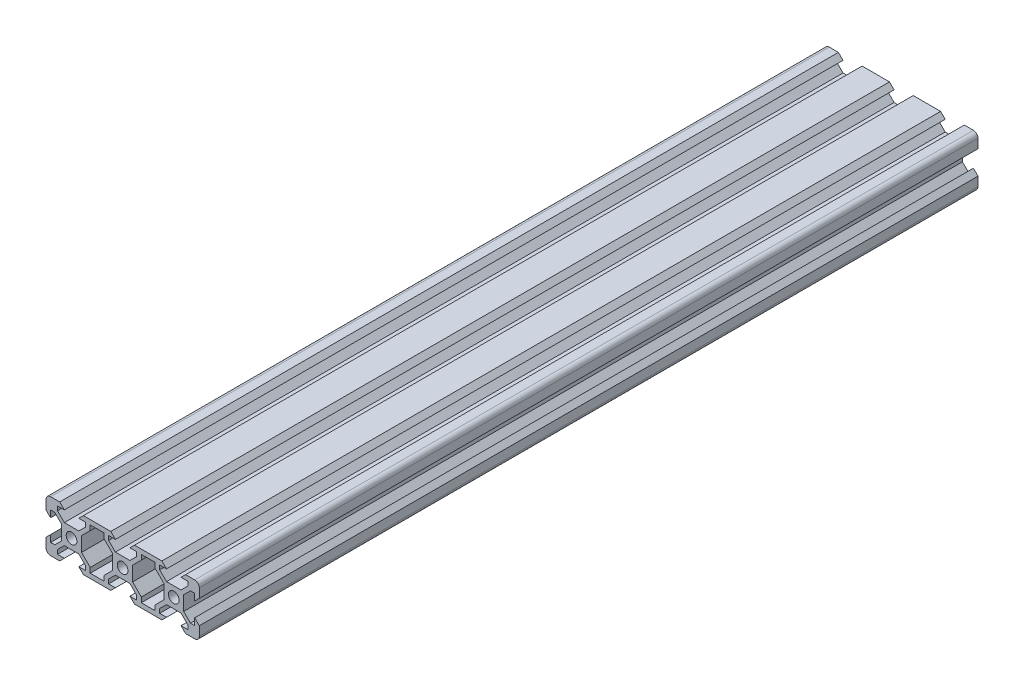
ISO-10303-21;
HEADER;
FILE_DESCRIPTION(('STEP AP214'),'2;1');
FILE_NAME('part.step','',(''),(''),'','','');
FILE_SCHEMA(('AUTOMOTIVE_DESIGN { 1 0 10303 214 1 1 1 1 }'));
ENDSEC;
DATA;
#1=APPLICATION_CONTEXT('core data for automotive mechanical design processes');
#2=APPLICATION_PROTOCOL_DEFINITION('international standard','automotive_design',2000,#1);
#3=PRODUCT_CONTEXT('',#1,'mechanical');
#4=PRODUCT('Part','Part','',(#3));
#5=PRODUCT_RELATED_PRODUCT_CATEGORY('part','',(#4));
#6=PRODUCT_DEFINITION_FORMATION('','',#4);
#7=PRODUCT_DEFINITION_CONTEXT('part definition',#1,'design');
#8=PRODUCT_DEFINITION('design','',#6,#7);
#9=PRODUCT_DEFINITION_SHAPE('','',#8);
#10=(LENGTH_UNIT() NAMED_UNIT(*) SI_UNIT(.MILLI.,.METRE.));
#11=(NAMED_UNIT(*) PLANE_ANGLE_UNIT() SI_UNIT($,.RADIAN.));
#12=(NAMED_UNIT(*) SI_UNIT($,.STERADIAN.) SOLID_ANGLE_UNIT());
#13=UNCERTAINTY_MEASURE_WITH_UNIT(LENGTH_MEASURE(1.E-05),#10,'distance_accuracy_value','');
#14=(GEOMETRIC_REPRESENTATION_CONTEXT(3) GLOBAL_UNCERTAINTY_ASSIGNED_CONTEXT((#13)) GLOBAL_UNIT_ASSIGNED_CONTEXT((#10,
#11,#12)) REPRESENTATION_CONTEXT('',''));
#15=CARTESIAN_POINT('',(0.,0.,0.));
#16=DIRECTION('',(0.,0.,1.));
#17=DIRECTION('',(1.,0.,0.));
#18=AXIS2_PLACEMENT_3D('',#15,#16,#17);
#19=CARTESIAN_POINT('',(2.69933982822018,-8.2,0.));
#20=DIRECTION('',(1.,0.,0.));
#21=DIRECTION('',(0.,0.707106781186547,0.707106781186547));
#22=AXIS2_PLACEMENT_3D('',#19,#20,#21);
#23=PLANE('',#22);
#24=DIRECTION('',(0.,0.,1.));
#25=VECTOR('',#24,1.);
#26=CARTESIAN_POINT('',(2.69933982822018,-8.2,0.));
#27=LINE('',#26,#25);
#28=CARTESIAN_POINT('',(2.69933982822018,-8.2,0.));
#29=VERTEX_POINT('',#28);
#30=CARTESIAN_POINT('',(2.69933982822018,-8.2,304.8));
#31=VERTEX_POINT('',#30);
#32=EDGE_CURVE('E11',#29,#31,#27,.T.);
#33=ORIENTED_EDGE('',*,*,#32,.T.);
#34=DIRECTION('',(0.,1.,0.));
#35=VECTOR('',#34,1.);
#36=CARTESIAN_POINT('',(2.69933982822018,-8.2,304.8));
#37=LINE('',#36,#35);
#38=CARTESIAN_POINT('',(2.69933982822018,-6.24,304.8));
#39=VERTEX_POINT('',#38);
#40=EDGE_CURVE('E786',#31,#39,#37,.T.);
#41=ORIENTED_EDGE('',*,*,#40,.T.);
#42=DIRECTION('',(0.,0.,1.));
#43=VECTOR('',#42,1.);
#44=CARTESIAN_POINT('',(2.69933982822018,-6.24,0.));
#45=LINE('',#44,#43);
#46=CARTESIAN_POINT('',(2.69933982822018,-6.24,0.));
#47=VERTEX_POINT('',#46);
#48=EDGE_CURVE('E46',#47,#39,#45,.T.);
#49=ORIENTED_EDGE('',*,*,#48,.F.);
#50=DIRECTION('',(0.,1.,0.));
#51=VECTOR('',#50,1.);
#52=CARTESIAN_POINT('',(2.69933982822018,-4.1,0.));
#53=LINE('',#52,#51);
#54=EDGE_CURVE('E55',#29,#47,#53,.T.);
#55=ORIENTED_EDGE('',*,*,#54,.F.);
#56=EDGE_LOOP('',(#33,#41,#49,#55));
#57=FACE_BOUND('',#56,.T.);
#58=ADVANCED_FACE('F36',(#57),#23,.F.);
#59=CARTESIAN_POINT('',(2.69933982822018,-6.24,0.));
#60=DIRECTION('',(0.707106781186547,-0.707106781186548,0.));
#61=DIRECTION('',(0.577350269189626,0.577350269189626,0.577350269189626));
#62=AXIS2_PLACEMENT_3D('',#59,#60,#61);
#63=PLANE('',#62);
#64=ORIENTED_EDGE('',*,*,#48,.T.);
#65=DIRECTION('',(0.707106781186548,0.707106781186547,0.));
#66=VECTOR('',#65,1.);
#67=CARTESIAN_POINT('',(2.69933982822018,-6.24,304.8));
#68=LINE('',#67,#66);
#69=CARTESIAN_POINT('',(6.09933982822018,-2.84,304.8));
#70=VERTEX_POINT('',#69);
#71=EDGE_CURVE('E789',#39,#70,#68,.T.);
#72=ORIENTED_EDGE('',*,*,#71,.T.);
#73=DIRECTION('',(0.,0.,1.));
#74=VECTOR('',#73,1.);
#75=CARTESIAN_POINT('',(6.09933982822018,-2.84,0.));
#76=LINE('',#75,#74);
#77=CARTESIAN_POINT('',(6.09933982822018,-2.84,0.));
#78=VERTEX_POINT('',#77);
#79=EDGE_CURVE('E1114',#78,#70,#76,.T.);
#80=ORIENTED_EDGE('',*,*,#79,.F.);
#81=DIRECTION('',(0.707106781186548,0.707106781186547,0.));
#82=VECTOR('',#81,1.);
#83=CARTESIAN_POINT('',(1.08450487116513,-7.85483495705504,0.));
#84=LINE('',#83,#82);
#85=EDGE_CURVE('E1116',#47,#78,#84,.T.);
#86=ORIENTED_EDGE('',*,*,#85,.F.);
#87=EDGE_LOOP('',(#64,#72,#80,#86));
#88=FACE_BOUND('',#87,.T.);
#89=ADVANCED_FACE('F2004',(#88),#63,.F.);
#90=CARTESIAN_POINT('',(6.09933982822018,-2.84,0.));
#91=DIRECTION('',(1.,0.,0.));
#92=DIRECTION('',(0.,0.707106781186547,0.707106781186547));
#93=AXIS2_PLACEMENT_3D('',#90,#91,#92);
#94=PLANE('',#93);
#95=ORIENTED_EDGE('',*,*,#79,.T.);
#96=DIRECTION('',(0.,1.,0.));
#97=VECTOR('',#96,1.);
#98=CARTESIAN_POINT('',(6.09933982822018,-2.84,304.8));
#99=LINE('',#98,#97);
#100=CARTESIAN_POINT('',(6.09933982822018,2.84000000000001,304.8));
#101=VERTEX_POINT('',#100);
#102=EDGE_CURVE('E792',#70,#101,#99,.T.);
#103=ORIENTED_EDGE('',*,*,#102,.T.);
#104=DIRECTION('',(0.,0.,1.));
#105=VECTOR('',#104,1.);
#106=CARTESIAN_POINT('',(6.09933982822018,2.84000000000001,0.));
#107=LINE('',#106,#105);
#108=CARTESIAN_POINT('',(6.09933982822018,2.84000000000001,0.));
#109=VERTEX_POINT('',#108);
#110=EDGE_CURVE('E1119',#109,#101,#107,.T.);
#111=ORIENTED_EDGE('',*,*,#110,.F.);
#112=DIRECTION('',(0.,1.,0.));
#113=VECTOR('',#112,1.);
#114=CARTESIAN_POINT('',(6.09933982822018,-1.42,0.));
#115=LINE('',#114,#113);
#116=EDGE_CURVE('E1121',#78,#109,#115,.T.);
#117=ORIENTED_EDGE('',*,*,#116,.F.);
#118=EDGE_LOOP('',(#95,#103,#111,#117));
#119=FACE_BOUND('',#118,.T.);
#120=ADVANCED_FACE('F2010',(#119),#94,.F.);
#121=CARTESIAN_POINT('',(6.09933982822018,2.84000000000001,0.));
#122=DIRECTION('',(0.707106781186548,0.707106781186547,0.));
#123=DIRECTION('',(-0.577350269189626,0.577350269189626,0.577350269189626));
#124=AXIS2_PLACEMENT_3D('',#121,#122,#123);
#125=PLANE('',#124);
#126=ORIENTED_EDGE('',*,*,#110,.T.);
#127=DIRECTION('',(-0.707106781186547,0.707106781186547,0.));
#128=VECTOR('',#127,1.);
#129=CARTESIAN_POINT('',(6.09933982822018,2.84000000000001,304.8));
#130=LINE('',#129,#128);
#131=CARTESIAN_POINT('',(2.69933982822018,6.24000000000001,304.8));
#132=VERTEX_POINT('',#131);
#133=EDGE_CURVE('E795',#101,#132,#130,.T.);
#134=ORIENTED_EDGE('',*,*,#133,.T.);
#135=DIRECTION('',(0.,0.,1.));
#136=VECTOR('',#135,1.);
#137=CARTESIAN_POINT('',(2.69933982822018,6.24000000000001,0.));
#138=LINE('',#137,#136);
#139=CARTESIAN_POINT('',(2.69933982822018,6.24000000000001,0.));
#140=VERTEX_POINT('',#139);
#141=EDGE_CURVE('E1123',#140,#132,#138,.T.);
#142=ORIENTED_EDGE('',*,*,#141,.F.);
#143=DIRECTION('',(-0.707106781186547,0.707106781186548,0.));
#144=VECTOR('',#143,1.);
#145=CARTESIAN_POINT('',(2.78450487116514,6.15483495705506,0.));
#146=LINE('',#145,#144);
#147=EDGE_CURVE('E1125',#109,#140,#146,.T.);
#148=ORIENTED_EDGE('',*,*,#147,.F.);
#149=EDGE_LOOP('',(#126,#134,#142,#148));
#150=FACE_BOUND('',#149,.T.);
#151=ADVANCED_FACE('F2017',(#150),#125,.F.);
#152=CARTESIAN_POINT('',(2.69933982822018,6.24000000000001,0.));
#153=DIRECTION('',(1.,0.,0.));
#154=DIRECTION('',(0.,0.707106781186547,0.707106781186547));
#155=AXIS2_PLACEMENT_3D('',#152,#153,#154);
#156=PLANE('',#155);
#157=ORIENTED_EDGE('',*,*,#141,.T.);
#158=DIRECTION('',(0.,1.,0.));
#159=VECTOR('',#158,1.);
#160=CARTESIAN_POINT('',(2.69933982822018,6.24000000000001,304.8));
#161=LINE('',#160,#159);
#162=CARTESIAN_POINT('',(2.69933982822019,8.20000000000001,304.8));
#163=VERTEX_POINT('',#162);
#164=EDGE_CURVE('E798',#132,#163,#161,.T.);
#165=ORIENTED_EDGE('',*,*,#164,.T.);
#166=DIRECTION('',(0.,0.,1.));
#167=VECTOR('',#166,1.);
#168=CARTESIAN_POINT('',(2.69933982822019,8.20000000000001,0.));
#169=LINE('',#168,#167);
#170=CARTESIAN_POINT('',(2.69933982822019,8.20000000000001,0.));
#171=VERTEX_POINT('',#170);
#172=EDGE_CURVE('E1127',#171,#163,#169,.T.);
#173=ORIENTED_EDGE('',*,*,#172,.F.);
#174=DIRECTION('',(0.,1.,0.));
#175=VECTOR('',#174,1.);
#176=CARTESIAN_POINT('',(2.69933982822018,3.12,0.));
#177=LINE('',#176,#175);
#178=EDGE_CURVE('E1129',#140,#171,#177,.T.);
#179=ORIENTED_EDGE('',*,*,#178,.F.);
#180=EDGE_LOOP('',(#157,#165,#173,#179));
#181=FACE_BOUND('',#180,.T.);
#182=ADVANCED_FACE('F2021',(#181),#156,.F.);
#183=CARTESIAN_POINT('',(2.69933982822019,8.20000000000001,0.));
#184=DIRECTION('',(0.,1.,0.));
#185=DIRECTION('',(0.707106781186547,0.,0.707106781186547));
#186=AXIS2_PLACEMENT_3D('',#183,#184,#185);
#187=PLANE('',#186);
#188=ORIENTED_EDGE('',*,*,#172,.T.);
#189=DIRECTION('',(-1.,0.,0.));
#190=VECTOR('',#189,1.);
#191=CARTESIAN_POINT('',(2.69933982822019,8.20000000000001,304.8));
#192=LINE('',#191,#190);
#193=CARTESIAN_POINT('',(-2.69933982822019,8.20000000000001,304.8));
#194=VERTEX_POINT('',#193);
#195=EDGE_CURVE('E801',#163,#194,#192,.T.);
#196=ORIENTED_EDGE('',*,*,#195,.T.);
#197=DIRECTION('',(0.,0.,1.));
#198=VECTOR('',#197,1.);
#199=CARTESIAN_POINT('',(-2.69933982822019,8.20000000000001,0.));
#200=LINE('',#199,#198);
#201=CARTESIAN_POINT('',(-2.69933982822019,8.20000000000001,0.));
#202=VERTEX_POINT('',#201);
#203=EDGE_CURVE('E410',#202,#194,#200,.T.);
#204=ORIENTED_EDGE('',*,*,#203,.F.);
#205=DIRECTION('',(-1.,0.,0.));
#206=VECTOR('',#205,1.);
#207=CARTESIAN_POINT('',(-3.65033008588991,8.20000000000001,0.));
#208=LINE('',#207,#206);
#209=EDGE_CURVE('E1133',#171,#202,#208,.T.);
#210=ORIENTED_EDGE('',*,*,#209,.F.);
#211=EDGE_LOOP('',(#188,#196,#204,#210));
#212=FACE_BOUND('',#211,.T.);
#213=ADVANCED_FACE('F2025',(#212),#187,.F.);
#214=CARTESIAN_POINT('',(-22.6993398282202,8.20000000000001,0.));
#215=DIRECTION('',(-1.,0.,0.));
#216=DIRECTION('',(0.,0.707106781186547,0.707106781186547));
#217=AXIS2_PLACEMENT_3D('',#214,#215,#216);
#218=PLANE('',#217);
#219=DIRECTION('',(0.,0.,1.));
#220=VECTOR('',#219,1.);
#221=CARTESIAN_POINT('',(-22.6993398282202,8.20000000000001,0.));
#222=LINE('',#221,#220);
#223=CARTESIAN_POINT('',(-22.6993398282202,8.20000000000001,0.));
#224=VERTEX_POINT('',#223);
#225=CARTESIAN_POINT('',(-22.6993398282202,8.20000000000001,304.8));
#226=VERTEX_POINT('',#225);
#227=EDGE_CURVE('E1131',#224,#226,#222,.T.);
#228=ORIENTED_EDGE('',*,*,#227,.T.);
#229=DIRECTION('',(0.,-1.,0.));
#230=VECTOR('',#229,1.);
#231=CARTESIAN_POINT('',(-22.6993398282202,8.20000000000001,304.8));
#232=LINE('',#231,#230);
#233=CARTESIAN_POINT('',(-22.6993398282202,6.24000000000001,304.8));
#234=VERTEX_POINT('',#233);
#235=EDGE_CURVE('E829',#226,#234,#232,.T.);
#236=ORIENTED_EDGE('',*,*,#235,.T.);
#237=DIRECTION('',(0.,0.,1.));
#238=VECTOR('',#237,1.);
#239=CARTESIAN_POINT('',(-22.6993398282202,6.24000000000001,0.));
#240=LINE('',#239,#238);
#241=CARTESIAN_POINT('',(-22.6993398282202,6.24000000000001,0.));
#242=VERTEX_POINT('',#241);
#243=EDGE_CURVE('E1139',#242,#234,#240,.T.);
#244=ORIENTED_EDGE('',*,*,#243,.F.);
#245=DIRECTION('',(0.,-1.,0.));
#246=VECTOR('',#245,1.);
#247=CARTESIAN_POINT('',(-22.6993398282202,4.10000000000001,0.));
#248=LINE('',#247,#246);
#249=EDGE_CURVE('E1142',#224,#242,#248,.T.);
#250=ORIENTED_EDGE('',*,*,#249,.F.);
#251=EDGE_LOOP('',(#228,#236,#244,#250));
#252=FACE_BOUND('',#251,.T.);
#253=ADVANCED_FACE('F2029',(#252),#218,.F.);
#254=CARTESIAN_POINT('',(-22.6993398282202,6.24000000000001,0.));
#255=DIRECTION('',(-0.707106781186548,0.707106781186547,0.));
#256=DIRECTION('',(0.577350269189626,0.577350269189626,0.577350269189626));
#257=AXIS2_PLACEMENT_3D('',#254,#255,#256);
#258=PLANE('',#257);
#259=ORIENTED_EDGE('',*,*,#243,.T.);
#260=DIRECTION('',(-0.707106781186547,-0.707106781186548,0.));
#261=VECTOR('',#260,1.);
#262=CARTESIAN_POINT('',(-22.6993398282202,6.24000000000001,304.8));
#263=LINE('',#262,#261);
#264=CARTESIAN_POINT('',(-26.0993398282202,2.84000000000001,304.8));
#265=VERTEX_POINT('',#264);
#266=EDGE_CURVE('E832',#234,#265,#263,.T.);
#267=ORIENTED_EDGE('',*,*,#266,.T.);
#268=DIRECTION('',(0.,0.,1.));
#269=VECTOR('',#268,1.);
#270=CARTESIAN_POINT('',(-26.0993398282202,2.84000000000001,0.));
#271=LINE('',#270,#269);
#272=CARTESIAN_POINT('',(-26.0993398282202,2.84000000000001,0.));
#273=VERTEX_POINT('',#272);
#274=EDGE_CURVE('E1141',#273,#265,#271,.T.);
#275=ORIENTED_EDGE('',*,*,#274,.F.);
#276=DIRECTION('',(-0.707106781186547,-0.707106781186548,0.));
#277=VECTOR('',#276,1.);
#278=CARTESIAN_POINT('',(-21.0845048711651,7.85483495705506,0.));
#279=LINE('',#278,#277);
#280=EDGE_CURVE('E1145',#242,#273,#279,.T.);
#281=ORIENTED_EDGE('',*,*,#280,.F.);
#282=EDGE_LOOP('',(#259,#267,#275,#281));
#283=FACE_BOUND('',#282,.T.);
#284=ADVANCED_FACE('F2033',(#283),#258,.F.);
#285=CARTESIAN_POINT('',(-26.0993398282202,2.84000000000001,0.));
#286=DIRECTION('',(-1.,0.,0.));
#287=DIRECTION('',(0.,0.707106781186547,0.707106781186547));
#288=AXIS2_PLACEMENT_3D('',#285,#286,#287);
#289=PLANE('',#288);
#290=ORIENTED_EDGE('',*,*,#274,.T.);
#291=DIRECTION('',(0.,-1.,0.));
#292=VECTOR('',#291,1.);
#293=CARTESIAN_POINT('',(-26.0993398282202,2.84000000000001,304.8));
#294=LINE('',#293,#292);
#295=CARTESIAN_POINT('',(-26.0993398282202,-2.84,304.8));
#296=VERTEX_POINT('',#295);
#297=EDGE_CURVE('E835',#265,#296,#294,.T.);
#298=ORIENTED_EDGE('',*,*,#297,.T.);
#299=DIRECTION('',(0.,0.,1.));
#300=VECTOR('',#299,1.);
#301=CARTESIAN_POINT('',(-26.0993398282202,-2.84,0.));
#302=LINE('',#301,#300);
#303=CARTESIAN_POINT('',(-26.0993398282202,-2.84,0.));
#304=VERTEX_POINT('',#303);
#305=EDGE_CURVE('E1148',#304,#296,#302,.T.);
#306=ORIENTED_EDGE('',*,*,#305,.F.);
#307=DIRECTION('',(0.,-1.,0.));
#308=VECTOR('',#307,1.);
#309=CARTESIAN_POINT('',(-26.0993398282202,1.42000000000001,0.));
#310=LINE('',#309,#308);
#311=EDGE_CURVE('E1150',#273,#304,#310,.T.);
#312=ORIENTED_EDGE('',*,*,#311,.F.);
#313=EDGE_LOOP('',(#290,#298,#306,#312));
#314=FACE_BOUND('',#313,.T.);
#315=ADVANCED_FACE('F2037',(#314),#289,.F.);
#316=CARTESIAN_POINT('',(-26.0993398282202,-2.84,0.));
#317=DIRECTION('',(-0.707106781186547,-0.707106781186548,0.));
#318=DIRECTION('',(-0.577350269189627,0.577350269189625,0.577350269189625));
#319=AXIS2_PLACEMENT_3D('',#316,#317,#318);
#320=PLANE('',#319);
#321=ORIENTED_EDGE('',*,*,#305,.T.);
#322=DIRECTION('',(0.707106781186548,-0.707106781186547,0.));
#323=VECTOR('',#322,1.);
#324=CARTESIAN_POINT('',(-26.0993398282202,-2.84,304.8));
#325=LINE('',#324,#323);
#326=CARTESIAN_POINT('',(-22.6993398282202,-6.24,304.8));
#327=VERTEX_POINT('',#326);
#328=EDGE_CURVE('E838',#296,#327,#325,.T.);
#329=ORIENTED_EDGE('',*,*,#328,.T.);
#330=DIRECTION('',(0.,0.,1.));
#331=VECTOR('',#330,1.);
#332=CARTESIAN_POINT('',(-22.6993398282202,-6.24,0.));
#333=LINE('',#332,#331);
#334=CARTESIAN_POINT('',(-22.6993398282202,-6.24,0.));
#335=VERTEX_POINT('',#334);
#336=EDGE_CURVE('E1152',#335,#327,#333,.T.);
#337=ORIENTED_EDGE('',*,*,#336,.F.);
#338=DIRECTION('',(0.707106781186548,-0.707106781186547,0.));
#339=VECTOR('',#338,1.);
#340=CARTESIAN_POINT('',(-22.7845048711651,-6.15483495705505,0.));
#341=LINE('',#340,#339);
#342=EDGE_CURVE('E1154',#304,#335,#341,.T.);
#343=ORIENTED_EDGE('',*,*,#342,.F.);
#344=EDGE_LOOP('',(#321,#329,#337,#343));
#345=FACE_BOUND('',#344,.T.);
#346=ADVANCED_FACE('F2041',(#345),#320,.F.);
#347=CARTESIAN_POINT('',(-22.6993398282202,-6.24,0.));
#348=DIRECTION('',(-1.,0.,0.));
#349=DIRECTION('',(0.,0.707106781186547,0.707106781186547));
#350=AXIS2_PLACEMENT_3D('',#347,#348,#349);
#351=PLANE('',#350);
#352=ORIENTED_EDGE('',*,*,#336,.T.);
#353=DIRECTION('',(0.,-1.,0.));
#354=VECTOR('',#353,1.);
#355=CARTESIAN_POINT('',(-22.6993398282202,-6.24,304.8));
#356=LINE('',#355,#354);
#357=CARTESIAN_POINT('',(-22.6993398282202,-8.2,304.8));
#358=VERTEX_POINT('',#357);
#359=EDGE_CURVE('E841',#327,#358,#356,.T.);
#360=ORIENTED_EDGE('',*,*,#359,.T.);
#361=DIRECTION('',(0.,0.,1.));
#362=VECTOR('',#361,1.);
#363=CARTESIAN_POINT('',(-22.6993398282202,-8.2,0.));
#364=LINE('',#363,#362);
#365=CARTESIAN_POINT('',(-22.6993398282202,-8.2,0.));
#366=VERTEX_POINT('',#365);
#367=EDGE_CURVE('E1156',#366,#358,#364,.T.);
#368=ORIENTED_EDGE('',*,*,#367,.F.);
#369=DIRECTION('',(0.,-1.,0.));
#370=VECTOR('',#369,1.);
#371=CARTESIAN_POINT('',(-22.6993398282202,-3.12,0.));
#372=LINE('',#371,#370);
#373=EDGE_CURVE('E1158',#335,#366,#372,.T.);
#374=ORIENTED_EDGE('',*,*,#373,.F.);
#375=EDGE_LOOP('',(#352,#360,#368,#374));
#376=FACE_BOUND('',#375,.T.);
#377=ADVANCED_FACE('F2045',(#376),#351,.F.);
#378=CARTESIAN_POINT('',(-22.6993398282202,-8.2,0.));
#379=DIRECTION('',(0.,-1.,0.));
#380=DIRECTION('',(0.707106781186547,0.,0.707106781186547));
#381=AXIS2_PLACEMENT_3D('',#378,#379,#380);
#382=PLANE('',#381);
#383=ORIENTED_EDGE('',*,*,#367,.T.);
#384=DIRECTION('',(1.,0.,0.));
#385=VECTOR('',#384,1.);
#386=CARTESIAN_POINT('',(-22.6993398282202,-8.2,304.8));
#387=LINE('',#386,#385);
#388=CARTESIAN_POINT('',(-17.3006601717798,-8.2,304.8));
#389=VERTEX_POINT('',#388);
#390=EDGE_CURVE('E844',#358,#389,#387,.T.);
#391=ORIENTED_EDGE('',*,*,#390,.T.);
#392=DIRECTION('',(0.,0.,1.));
#393=VECTOR('',#392,1.);
#394=CARTESIAN_POINT('',(-17.3006601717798,-8.2,0.));
#395=LINE('',#394,#393);
#396=CARTESIAN_POINT('',(-17.3006601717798,-8.2,0.));
#397=VERTEX_POINT('',#396);
#398=EDGE_CURVE('E418',#397,#389,#395,.T.);
#399=ORIENTED_EDGE('',*,*,#398,.F.);
#400=DIRECTION('',(1.,0.,0.));
#401=VECTOR('',#400,1.);
#402=CARTESIAN_POINT('',(-16.3496699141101,-8.2,0.));
#403=LINE('',#402,#401);
#404=EDGE_CURVE('E1162',#366,#397,#403,.T.);
#405=ORIENTED_EDGE('',*,*,#404,.F.);
#406=EDGE_LOOP('',(#383,#391,#399,#405));
#407=FACE_BOUND('',#406,.T.);
#408=ADVANCED_FACE('F2049',(#407),#382,.F.);
#409=CARTESIAN_POINT('',(-4.50066017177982,6.56,0.));
#410=DIRECTION('',(-0.707106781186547,0.707106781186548,0.));
#411=DIRECTION('',(0.577350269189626,0.577350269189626,0.577350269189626));
#412=AXIS2_PLACEMENT_3D('',#409,#410,#411);
#413=PLANE('',#412);
#414=DIRECTION('',(0.,0.,1.));
#415=VECTOR('',#414,1.);
#416=CARTESIAN_POINT('',(-7.16,3.90066017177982,0.));
#417=LINE('',#416,#415);
#418=CARTESIAN_POINT('',(-7.16,3.90066017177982,0.));
#419=VERTEX_POINT('',#418);
#420=CARTESIAN_POINT('',(-7.16,3.90066017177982,304.8));
#421=VERTEX_POINT('',#420);
#422=EDGE_CURVE('E1160',#419,#421,#417,.T.);
#423=ORIENTED_EDGE('',*,*,#422,.T.);
#424=DIRECTION('',(-0.707106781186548,-0.707106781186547,0.));
#425=VECTOR('',#424,1.);
#426=CARTESIAN_POINT('',(-4.50066017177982,6.56,304.8));
#427=LINE('',#426,#425);
#428=CARTESIAN_POINT('',(-4.50066017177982,6.56,304.8));
#429=VERTEX_POINT('',#428);
#430=EDGE_CURVE('E983',#429,#421,#427,.T.);
#431=ORIENTED_EDGE('',*,*,#430,.F.);
#432=DIRECTION('',(0.,0.,1.));
#433=VECTOR('',#432,1.);
#434=CARTESIAN_POINT('',(-4.50066017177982,6.56,0.));
#435=LINE('',#434,#433);
#436=CARTESIAN_POINT('',(-4.50066017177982,6.56,0.));
#437=VERTEX_POINT('',#436);
#438=EDGE_CURVE('E1167',#437,#429,#435,.T.);
#439=ORIENTED_EDGE('',*,*,#438,.F.);
#440=DIRECTION('',(0.707106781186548,0.707106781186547,0.));
#441=VECTOR('',#440,1.);
#442=CARTESIAN_POINT('',(-7.51549512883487,3.54516504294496,0.));
#443=LINE('',#442,#441);
#444=EDGE_CURVE('E1170',#419,#437,#443,.T.);
#445=ORIENTED_EDGE('',*,*,#444,.F.);
#446=EDGE_LOOP('',(#423,#431,#439,#445));
#447=FACE_BOUND('',#446,.T.);
#448=ADVANCED_FACE('F1567',(#447),#413,.T.);
#449=CARTESIAN_POINT('',(-4.50066017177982,8.2,0.));
#450=DIRECTION('',(-1.,0.,0.));
#451=DIRECTION('',(0.,0.707106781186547,0.707106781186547));
#452=AXIS2_PLACEMENT_3D('',#449,#450,#451);
#453=PLANE('',#452);
#454=ORIENTED_EDGE('',*,*,#438,.T.);
#455=DIRECTION('',(0.,-1.,0.));
#456=VECTOR('',#455,1.);
#457=CARTESIAN_POINT('',(-4.50066017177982,8.2,304.8));
#458=LINE('',#457,#456);
#459=CARTESIAN_POINT('',(-4.50066017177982,8.2,304.8));
#460=VERTEX_POINT('',#459);
#461=EDGE_CURVE('E980',#460,#429,#458,.T.);
#462=ORIENTED_EDGE('',*,*,#461,.F.);
#463=DIRECTION('',(0.,0.,1.));
#464=VECTOR('',#463,1.);
#465=CARTESIAN_POINT('',(-4.50066017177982,8.2,0.));
#466=LINE('',#465,#464);
#467=CARTESIAN_POINT('',(-4.50066017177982,8.2,0.));
#468=VERTEX_POINT('',#467);
#469=EDGE_CURVE('E1169',#468,#460,#466,.T.);
#470=ORIENTED_EDGE('',*,*,#469,.F.);
#471=DIRECTION('',(0.,1.,0.));
#472=VECTOR('',#471,1.);
#473=CARTESIAN_POINT('',(-4.50066017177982,4.1,0.));
#474=LINE('',#473,#472);
#475=EDGE_CURVE('E1172',#437,#468,#474,.T.);
#476=ORIENTED_EDGE('',*,*,#475,.F.);
#477=EDGE_LOOP('',(#454,#462,#470,#476));
#478=FACE_BOUND('',#477,.T.);
#479=ADVANCED_FACE('F1575',(#478),#453,.T.);
#480=CARTESIAN_POINT('',(-7.16,8.20000000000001,0.));
#481=DIRECTION('',(0.,-1.,0.));
#482=DIRECTION('',(0.707106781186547,0.,0.707106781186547));
#483=AXIS2_PLACEMENT_3D('',#480,#481,#482);
#484=PLANE('',#483);
#485=ORIENTED_EDGE('',*,*,#469,.T.);
#486=DIRECTION('',(1.,0.,0.));
#487=VECTOR('',#486,1.);
#488=CARTESIAN_POINT('',(-7.16,8.20000000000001,304.8));
#489=LINE('',#488,#487);
#490=CARTESIAN_POINT('',(-7.16,8.20000000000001,304.8));
#491=VERTEX_POINT('',#490);
#492=EDGE_CURVE('E977',#491,#460,#489,.T.);
#493=ORIENTED_EDGE('',*,*,#492,.F.);
#494=DIRECTION('',(0.,0.,1.));
#495=VECTOR('',#494,1.);
#496=CARTESIAN_POINT('',(-7.16,8.20000000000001,0.));
#497=LINE('',#496,#495);
#498=CARTESIAN_POINT('',(-7.16,8.20000000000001,0.));
#499=VERTEX_POINT('',#498);
#500=EDGE_CURVE('E1175',#499,#491,#497,.T.);
#501=ORIENTED_EDGE('',*,*,#500,.F.);
#502=DIRECTION('',(-1.,0.,0.));
#503=VECTOR('',#502,1.);
#504=CARTESIAN_POINT('',(-8.57999999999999,8.20000000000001,0.));
#505=LINE('',#504,#503);
#506=EDGE_CURVE('E1177',#468,#499,#505,.T.);
#507=ORIENTED_EDGE('',*,*,#506,.F.);
#508=EDGE_LOOP('',(#485,#493,#501,#507));
#509=FACE_BOUND('',#508,.T.);
#510=ADVANCED_FACE('F1582',(#509),#484,.T.);
#511=CARTESIAN_POINT('',(-5.36,10.,0.));
#512=DIRECTION('',(-0.707106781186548,0.707106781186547,0.));
#513=DIRECTION('',(0.577350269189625,0.577350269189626,0.577350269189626));
#514=AXIS2_PLACEMENT_3D('',#511,#512,#513);
#515=PLANE('',#514);
#516=ORIENTED_EDGE('',*,*,#500,.T.);
#517=DIRECTION('',(-0.707106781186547,-0.707106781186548,0.));
#518=VECTOR('',#517,1.);
#519=CARTESIAN_POINT('',(-5.36,10.,304.8));
#520=LINE('',#519,#518);
#521=CARTESIAN_POINT('',(-5.36,10.,304.8));
#522=VERTEX_POINT('',#521);
#523=EDGE_CURVE('E974',#522,#491,#520,.T.);
#524=ORIENTED_EDGE('',*,*,#523,.F.);
#525=DIRECTION('',(0.,0.,1.));
#526=VECTOR('',#525,1.);
#527=CARTESIAN_POINT('',(-5.36,10.,0.));
#528=LINE('',#527,#526);
#529=CARTESIAN_POINT('',(-5.36,10.,0.));
#530=VERTEX_POINT('',#529);
#531=EDGE_CURVE('E1179',#530,#522,#528,.T.);
#532=ORIENTED_EDGE('',*,*,#531,.F.);
#533=DIRECTION('',(0.707106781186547,0.707106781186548,0.));
#534=VECTOR('',#533,1.);
#535=CARTESIAN_POINT('',(-9.02,6.34,0.));
#536=LINE('',#535,#534);
#537=EDGE_CURVE('E1181',#499,#530,#536,.T.);
#538=ORIENTED_EDGE('',*,*,#537,.F.);
#539=EDGE_LOOP('',(#516,#524,#532,#538));
#540=FACE_BOUND('',#539,.T.);
#541=ADVANCED_FACE('F1585',(#540),#515,.T.);
#542=CARTESIAN_POINT('',(5.36,10.,0.));
#543=DIRECTION('',(0.,1.,0.));
#544=DIRECTION('',(0.707106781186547,0.,0.707106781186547));
#545=AXIS2_PLACEMENT_3D('',#542,#543,#544);
#546=PLANE('',#545);
#547=ORIENTED_EDGE('',*,*,#531,.T.);
#548=DIRECTION('',(-1.,0.,0.));
#549=VECTOR('',#548,1.);
#550=CARTESIAN_POINT('',(5.36,10.,304.8));
#551=LINE('',#550,#549);
#552=CARTESIAN_POINT('',(5.36,10.,304.8));
#553=VERTEX_POINT('',#552);
#554=EDGE_CURVE('E971',#553,#522,#551,.T.);
#555=ORIENTED_EDGE('',*,*,#554,.F.);
#556=DIRECTION('',(0.,0.,1.));
#557=VECTOR('',#556,1.);
#558=CARTESIAN_POINT('',(5.36,10.,0.));
#559=LINE('',#558,#557);
#560=CARTESIAN_POINT('',(5.36,10.,0.));
#561=VERTEX_POINT('',#560);
#562=EDGE_CURVE('E1183',#561,#553,#559,.T.);
#563=ORIENTED_EDGE('',*,*,#562,.F.);
#564=DIRECTION('',(1.,0.,0.));
#565=VECTOR('',#564,1.);
#566=CARTESIAN_POINT('',(-2.32,10.,0.));
#567=LINE('',#566,#565);
#568=EDGE_CURVE('E1185',#530,#561,#567,.T.);
#569=ORIENTED_EDGE('',*,*,#568,.F.);
#570=EDGE_LOOP('',(#547,#555,#563,#569));
#571=FACE_BOUND('',#570,.T.);
#572=ADVANCED_FACE('F1590',(#571),#546,.T.);
#573=CARTESIAN_POINT('',(7.16,8.20000000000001,0.));
#574=DIRECTION('',(0.707106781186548,0.707106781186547,0.));
#575=DIRECTION('',(-0.577350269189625,0.577350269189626,0.577350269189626));
#576=AXIS2_PLACEMENT_3D('',#573,#574,#575);
#577=PLANE('',#576);
#578=ORIENTED_EDGE('',*,*,#562,.T.);
#579=DIRECTION('',(-0.707106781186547,0.707106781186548,0.));
#580=VECTOR('',#579,1.);
#581=CARTESIAN_POINT('',(7.16,8.20000000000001,304.8));
#582=LINE('',#581,#580);
#583=CARTESIAN_POINT('',(7.16,8.20000000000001,304.8));
#584=VERTEX_POINT('',#583);
#585=EDGE_CURVE('E968',#584,#553,#582,.T.);
#586=ORIENTED_EDGE('',*,*,#585,.F.);
#587=DIRECTION('',(0.,0.,1.));
#588=VECTOR('',#587,1.);
#589=CARTESIAN_POINT('',(7.16,8.20000000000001,0.));
#590=LINE('',#589,#588);
#591=CARTESIAN_POINT('',(7.16,8.20000000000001,0.));
#592=VERTEX_POINT('',#591);
#593=EDGE_CURVE('E1187',#592,#584,#590,.T.);
#594=ORIENTED_EDGE('',*,*,#593,.F.);
#595=DIRECTION('',(0.707106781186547,-0.707106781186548,0.));
#596=VECTOR('',#595,1.);
#597=CARTESIAN_POINT('',(4.92000000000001,10.44,0.));
#598=LINE('',#597,#596);
#599=EDGE_CURVE('E1189',#561,#592,#598,.T.);
#600=ORIENTED_EDGE('',*,*,#599,.F.);
#601=EDGE_LOOP('',(#578,#586,#594,#600));
#602=FACE_BOUND('',#601,.T.);
#603=ADVANCED_FACE('F1597',(#602),#577,.T.);
#604=CARTESIAN_POINT('',(4.50066017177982,8.2,0.));
#605=DIRECTION('',(0.,-1.,0.));
#606=DIRECTION('',(0.707106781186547,0.,0.707106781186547));
#607=AXIS2_PLACEMENT_3D('',#604,#605,#606);
#608=PLANE('',#607);
#609=ORIENTED_EDGE('',*,*,#593,.T.);
#610=DIRECTION('',(1.,0.,0.));
#611=VECTOR('',#610,1.);
#612=CARTESIAN_POINT('',(4.50066017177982,8.2,304.8));
#613=LINE('',#612,#611);
#614=CARTESIAN_POINT('',(4.50066017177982,8.2,304.8));
#615=VERTEX_POINT('',#614);
#616=EDGE_CURVE('E965',#615,#584,#613,.T.);
#617=ORIENTED_EDGE('',*,*,#616,.F.);
#618=DIRECTION('',(0.,0.,1.));
#619=VECTOR('',#618,1.);
#620=CARTESIAN_POINT('',(4.50066017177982,8.2,0.));
#621=LINE('',#620,#619);
#622=CARTESIAN_POINT('',(4.50066017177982,8.2,0.));
#623=VERTEX_POINT('',#622);
#624=EDGE_CURVE('E1191',#623,#615,#621,.T.);
#625=ORIENTED_EDGE('',*,*,#624,.F.);
#626=DIRECTION('',(-1.,0.,0.));
#627=VECTOR('',#626,1.);
#628=CARTESIAN_POINT('',(-2.7496699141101,8.19999999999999,0.));
#629=LINE('',#628,#627);
#630=EDGE_CURVE('E1193',#592,#623,#629,.T.);
#631=ORIENTED_EDGE('',*,*,#630,.F.);
#632=EDGE_LOOP('',(#609,#617,#625,#631));
#633=FACE_BOUND('',#632,.T.);
#634=ADVANCED_FACE('F1600',(#633),#608,.T.);
#635=CARTESIAN_POINT('',(4.50066017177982,6.56,0.));
#636=DIRECTION('',(1.,0.,0.));
#637=DIRECTION('',(0.,0.707106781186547,0.707106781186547));
#638=AXIS2_PLACEMENT_3D('',#635,#636,#637);
#639=PLANE('',#638);
#640=ORIENTED_EDGE('',*,*,#624,.T.);
#641=DIRECTION('',(0.,1.,0.));
#642=VECTOR('',#641,1.);
#643=CARTESIAN_POINT('',(4.50066017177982,6.56,304.8));
#644=LINE('',#643,#642);
#645=CARTESIAN_POINT('',(4.50066017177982,6.56,304.8));
#646=VERTEX_POINT('',#645);
#647=EDGE_CURVE('E962',#646,#615,#644,.T.);
#648=ORIENTED_EDGE('',*,*,#647,.F.);
#649=DIRECTION('',(0.,0.,1.));
#650=VECTOR('',#649,1.);
#651=CARTESIAN_POINT('',(4.50066017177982,6.56,0.));
#652=LINE('',#651,#650);
#653=CARTESIAN_POINT('',(4.50066017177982,6.56,0.));
#654=VERTEX_POINT('',#653);
#655=EDGE_CURVE('E1195',#654,#646,#652,.T.);
#656=ORIENTED_EDGE('',*,*,#655,.F.);
#657=DIRECTION('',(0.,-1.,0.));
#658=VECTOR('',#657,1.);
#659=CARTESIAN_POINT('',(4.50066017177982,3.28,0.));
#660=LINE('',#659,#658);
#661=EDGE_CURVE('E1197',#623,#654,#660,.T.);
#662=ORIENTED_EDGE('',*,*,#661,.F.);
#663=EDGE_LOOP('',(#640,#648,#656,#662));
#664=FACE_BOUND('',#663,.T.);
#665=ADVANCED_FACE('F1605',(#664),#639,.T.);
#666=CARTESIAN_POINT('',(7.16,3.90066017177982,0.));
#667=DIRECTION('',(0.707106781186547,0.707106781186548,0.));
#668=DIRECTION('',(-0.577350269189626,0.577350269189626,0.577350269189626));
#669=AXIS2_PLACEMENT_3D('',#666,#667,#668);
#670=PLANE('',#669);
#671=ORIENTED_EDGE('',*,*,#655,.T.);
#672=DIRECTION('',(-0.707106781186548,0.707106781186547,0.));
#673=VECTOR('',#672,1.);
#674=CARTESIAN_POINT('',(7.16,3.90066017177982,304.8));
#675=LINE('',#674,#673);
#676=CARTESIAN_POINT('',(7.16,3.90066017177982,304.8));
#677=VERTEX_POINT('',#676);
#678=EDGE_CURVE('E959',#677,#646,#675,.T.);
#679=ORIENTED_EDGE('',*,*,#678,.F.);
#680=DIRECTION('',(0.,0.,1.));
#681=VECTOR('',#680,1.);
#682=CARTESIAN_POINT('',(7.16,3.90066017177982,0.));
#683=LINE('',#682,#681);
#684=CARTESIAN_POINT('',(7.16,3.90066017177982,0.));
#685=VERTEX_POINT('',#684);
#686=EDGE_CURVE('E1199',#685,#677,#683,.T.);
#687=ORIENTED_EDGE('',*,*,#686,.F.);
#688=DIRECTION('',(0.707106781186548,-0.707106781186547,0.));
#689=VECTOR('',#688,1.);
#690=CARTESIAN_POINT('',(3.84516504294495,7.21549512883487,0.));
#691=LINE('',#690,#689);
#692=EDGE_CURVE('E1201',#654,#685,#691,.T.);
#693=ORIENTED_EDGE('',*,*,#692,.F.);
#694=EDGE_LOOP('',(#671,#679,#687,#693));
#695=FACE_BOUND('',#694,.T.);
#696=ADVANCED_FACE('F1612',(#695),#670,.T.);
#697=CARTESIAN_POINT('',(12.84,3.90066017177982,0.));
#698=DIRECTION('',(0.,1.,0.));
#699=DIRECTION('',(0.707106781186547,0.,0.707106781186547));
#700=AXIS2_PLACEMENT_3D('',#697,#698,#699);
#701=PLANE('',#700);
#702=ORIENTED_EDGE('',*,*,#686,.T.);
#703=DIRECTION('',(-1.,0.,0.));
#704=VECTOR('',#703,1.);
#705=CARTESIAN_POINT('',(12.84,3.90066017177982,304.8));
#706=LINE('',#705,#704);
#707=CARTESIAN_POINT('',(12.84,3.90066017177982,304.8));
#708=VERTEX_POINT('',#707);
#709=EDGE_CURVE('E956',#708,#677,#706,.T.);
#710=ORIENTED_EDGE('',*,*,#709,.F.);
#711=DIRECTION('',(0.,0.,1.));
#712=VECTOR('',#711,1.);
#713=CARTESIAN_POINT('',(12.84,3.90066017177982,0.));
#714=LINE('',#713,#712);
#715=CARTESIAN_POINT('',(12.84,3.90066017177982,0.));
#716=VERTEX_POINT('',#715);
#717=EDGE_CURVE('E1203',#716,#708,#714,.T.);
#718=ORIENTED_EDGE('',*,*,#717,.F.);
#719=DIRECTION('',(1.,0.,0.));
#720=VECTOR('',#719,1.);
#721=CARTESIAN_POINT('',(1.42,3.90066017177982,0.));
#722=LINE('',#721,#720);
#723=EDGE_CURVE('E1205',#685,#716,#722,.T.);
#724=ORIENTED_EDGE('',*,*,#723,.F.);
#725=EDGE_LOOP('',(#702,#710,#718,#724));
#726=FACE_BOUND('',#725,.T.);
#727=ADVANCED_FACE('F1615',(#726),#701,.T.);
#728=CARTESIAN_POINT('',(15.4993398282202,6.56,0.));
#729=DIRECTION('',(-0.707106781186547,0.707106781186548,0.));
#730=DIRECTION('',(0.577350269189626,0.577350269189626,0.577350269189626));
#731=AXIS2_PLACEMENT_3D('',#728,#729,#730);
#732=PLANE('',#731);
#733=ORIENTED_EDGE('',*,*,#717,.T.);
#734=DIRECTION('',(-0.707106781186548,-0.707106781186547,0.));
#735=VECTOR('',#734,1.);
#736=CARTESIAN_POINT('',(15.4993398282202,6.56,304.8));
#737=LINE('',#736,#735);
#738=CARTESIAN_POINT('',(15.4993398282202,6.56,304.8));
#739=VERTEX_POINT('',#738);
#740=EDGE_CURVE('E953',#739,#708,#737,.T.);
#741=ORIENTED_EDGE('',*,*,#740,.F.);
#742=DIRECTION('',(0.,0.,1.));
#743=VECTOR('',#742,1.);
#744=CARTESIAN_POINT('',(15.4993398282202,6.56,0.));
#745=LINE('',#744,#743);
#746=CARTESIAN_POINT('',(15.4993398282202,6.56,0.));
#747=VERTEX_POINT('',#746);
#748=EDGE_CURVE('E1207',#747,#739,#745,.T.);
#749=ORIENTED_EDGE('',*,*,#748,.F.);
#750=DIRECTION('',(0.707106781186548,0.707106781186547,0.));
#751=VECTOR('',#750,1.);
#752=CARTESIAN_POINT('',(7.48450487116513,-1.45483495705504,0.));
#753=LINE('',#752,#751);
#754=EDGE_CURVE('E1209',#716,#747,#753,.T.);
#755=ORIENTED_EDGE('',*,*,#754,.F.);
#756=EDGE_LOOP('',(#733,#741,#749,#755));
#757=FACE_BOUND('',#756,.T.);
#758=ADVANCED_FACE('F1620',(#757),#732,.T.);
#759=CARTESIAN_POINT('',(15.4993398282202,8.2,0.));
#760=DIRECTION('',(-1.,0.,0.));
#761=DIRECTION('',(0.,0.707106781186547,0.707106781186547));
#762=AXIS2_PLACEMENT_3D('',#759,#760,#761);
#763=PLANE('',#762);
#764=ORIENTED_EDGE('',*,*,#748,.T.);
#765=DIRECTION('',(0.,-1.,0.));
#766=VECTOR('',#765,1.);
#767=CARTESIAN_POINT('',(15.4993398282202,8.2,304.8));
#768=LINE('',#767,#766);
#769=CARTESIAN_POINT('',(15.4993398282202,8.2,304.8));
#770=VERTEX_POINT('',#769);
#771=EDGE_CURVE('E950',#770,#739,#768,.T.);
#772=ORIENTED_EDGE('',*,*,#771,.F.);
#773=DIRECTION('',(0.,0.,1.));
#774=VECTOR('',#773,1.);
#775=CARTESIAN_POINT('',(15.4993398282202,8.2,0.));
#776=LINE('',#775,#774);
#777=CARTESIAN_POINT('',(15.4993398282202,8.2,0.));
#778=VERTEX_POINT('',#777);
#779=EDGE_CURVE('E1211',#778,#770,#776,.T.);
#780=ORIENTED_EDGE('',*,*,#779,.F.);
#781=DIRECTION('',(0.,1.,0.));
#782=VECTOR('',#781,1.);
#783=CARTESIAN_POINT('',(15.4993398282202,4.1,0.));
#784=LINE('',#783,#782);
#785=EDGE_CURVE('E1213',#747,#778,#784,.T.);
#786=ORIENTED_EDGE('',*,*,#785,.F.);
#787=EDGE_LOOP('',(#764,#772,#780,#786));
#788=FACE_BOUND('',#787,.T.);
#789=ADVANCED_FACE('F1627',(#788),#763,.T.);
#790=CARTESIAN_POINT('',(12.84,8.20000000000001,0.));
#791=DIRECTION('',(0.,-1.,0.));
#792=DIRECTION('',(0.707106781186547,0.,0.707106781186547));
#793=AXIS2_PLACEMENT_3D('',#790,#791,#792);
#794=PLANE('',#793);
#795=ORIENTED_EDGE('',*,*,#779,.T.);
#796=DIRECTION('',(1.,0.,0.));
#797=VECTOR('',#796,1.);
#798=CARTESIAN_POINT('',(12.84,8.20000000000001,304.8));
#799=LINE('',#798,#797);
#800=CARTESIAN_POINT('',(12.84,8.20000000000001,304.8));
#801=VERTEX_POINT('',#800);
#802=EDGE_CURVE('E947',#801,#770,#799,.T.);
#803=ORIENTED_EDGE('',*,*,#802,.F.);
#804=DIRECTION('',(0.,0.,1.));
#805=VECTOR('',#804,1.);
#806=CARTESIAN_POINT('',(12.84,8.20000000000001,0.));
#807=LINE('',#806,#805);
#808=CARTESIAN_POINT('',(12.84,8.20000000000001,0.));
#809=VERTEX_POINT('',#808);
#810=EDGE_CURVE('E1215',#809,#801,#807,.T.);
#811=ORIENTED_EDGE('',*,*,#810,.F.);
#812=DIRECTION('',(-1.,0.,0.));
#813=VECTOR('',#812,1.);
#814=CARTESIAN_POINT('',(1.42000000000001,8.20000000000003,0.));
#815=LINE('',#814,#813);
#816=EDGE_CURVE('E1217',#778,#809,#815,.T.);
#817=ORIENTED_EDGE('',*,*,#816,.F.);
#818=EDGE_LOOP('',(#795,#803,#811,#817));
#819=FACE_BOUND('',#818,.T.);
#820=ADVANCED_FACE('F1630',(#819),#794,.T.);
#821=CARTESIAN_POINT('',(14.64,10.,0.));
#822=DIRECTION('',(-0.707106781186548,0.707106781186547,0.));
#823=DIRECTION('',(0.577350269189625,0.577350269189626,0.577350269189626));
#824=AXIS2_PLACEMENT_3D('',#821,#822,#823);
#825=PLANE('',#824);
#826=ORIENTED_EDGE('',*,*,#810,.T.);
#827=DIRECTION('',(-0.707106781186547,-0.707106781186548,0.));
#828=VECTOR('',#827,1.);
#829=CARTESIAN_POINT('',(14.64,10.,304.8));
#830=LINE('',#829,#828);
#831=CARTESIAN_POINT('',(14.64,10.,304.8));
#832=VERTEX_POINT('',#831);
#833=EDGE_CURVE('E944',#832,#801,#830,.T.);
#834=ORIENTED_EDGE('',*,*,#833,.F.);
#835=DIRECTION('',(0.,0.,1.));
#836=VECTOR('',#835,1.);
#837=CARTESIAN_POINT('',(14.64,10.,0.));
#838=LINE('',#837,#836);
#839=CARTESIAN_POINT('',(14.64,10.,0.));
#840=VERTEX_POINT('',#839);
#841=EDGE_CURVE('E1219',#840,#832,#838,.T.);
#842=ORIENTED_EDGE('',*,*,#841,.F.);
#843=DIRECTION('',(0.707106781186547,0.707106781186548,0.));
#844=VECTOR('',#843,1.);
#845=CARTESIAN_POINT('',(5.98000000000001,1.34,0.));
#846=LINE('',#845,#844);
#847=EDGE_CURVE('E1221',#809,#840,#846,.T.);
#848=ORIENTED_EDGE('',*,*,#847,.F.);
#849=EDGE_LOOP('',(#826,#834,#842,#848));
#850=FACE_BOUND('',#849,.T.);
#851=ADVANCED_FACE('F1635',(#850),#825,.T.);
#852=CARTESIAN_POINT('',(18.2,10.,0.));
#853=DIRECTION('',(0.,1.,0.));
#854=DIRECTION('',(0.707106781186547,0.,0.707106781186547));
#855=AXIS2_PLACEMENT_3D('',#852,#853,#854);
#856=PLANE('',#855);
#857=ORIENTED_EDGE('',*,*,#841,.T.);
#858=DIRECTION('',(-1.,0.,0.));
#859=VECTOR('',#858,1.);
#860=CARTESIAN_POINT('',(18.2,10.,304.8));
#861=LINE('',#860,#859);
#862=CARTESIAN_POINT('',(18.2,10.,304.8));
#863=VERTEX_POINT('',#862);
#864=EDGE_CURVE('E941',#863,#832,#861,.T.);
#865=ORIENTED_EDGE('',*,*,#864,.F.);
#866=DIRECTION('',(0.,0.,1.));
#867=VECTOR('',#866,1.);
#868=CARTESIAN_POINT('',(18.2,10.,0.));
#869=LINE('',#868,#867);
#870=CARTESIAN_POINT('',(18.2,10.,0.));
#871=VERTEX_POINT('',#870);
#872=EDGE_CURVE('E1223',#871,#863,#869,.T.);
#873=ORIENTED_EDGE('',*,*,#872,.F.);
#874=DIRECTION('',(1.,0.,0.));
#875=VECTOR('',#874,1.);
#876=CARTESIAN_POINT('',(4.1,10.,0.));
#877=LINE('',#876,#875);
#878=EDGE_CURVE('E1225',#840,#871,#877,.T.);
#879=ORIENTED_EDGE('',*,*,#878,.F.);
#880=EDGE_LOOP('',(#857,#865,#873,#879));
#881=FACE_BOUND('',#880,.T.);
#882=ADVANCED_FACE('F1642',(#881),#856,.T.);
#883=CARTESIAN_POINT('',(18.2,8.20000000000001,0.));
#884=DIRECTION('',(0.,0.,1.));
#885=DIRECTION('',(1.,0.,0.));
#886=AXIS2_PLACEMENT_3D('',#883,#884,#885);
#887=CYLINDRICAL_SURFACE('',#886,1.8);
#888=ORIENTED_EDGE('',*,*,#872,.T.);
#889=CARTESIAN_POINT('',(18.2,8.20000000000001,304.8));
#890=DIRECTION('',(0.,0.,1.));
#891=DIRECTION('',(1.,0.,0.));
#892=AXIS2_PLACEMENT_3D('',#889,#890,#891);
#893=CIRCLE('',#892,1.8);
#894=CARTESIAN_POINT('',(20.,8.20000000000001,304.8));
#895=VERTEX_POINT('',#894);
#896=EDGE_CURVE('E938',#895,#863,#893,.T.);
#897=ORIENTED_EDGE('',*,*,#896,.F.);
#898=DIRECTION('',(0.,0.,1.));
#899=VECTOR('',#898,1.);
#900=CARTESIAN_POINT('',(20.,8.20000000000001,0.));
#901=LINE('',#900,#899);
#902=CARTESIAN_POINT('',(20.,8.20000000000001,0.));
#903=VERTEX_POINT('',#902);
#904=EDGE_CURVE('E1227',#903,#895,#901,.T.);
#905=ORIENTED_EDGE('',*,*,#904,.F.);
#906=CARTESIAN_POINT('',(18.2,8.20000000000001,0.));
#907=DIRECTION('',(0.,0.,-1.));
#908=DIRECTION('',(1.,0.,0.));
#909=AXIS2_PLACEMENT_3D('',#906,#907,#908);
#910=CIRCLE('',#909,1.8);
#911=EDGE_CURVE('E1229',#871,#903,#910,.T.);
#912=ORIENTED_EDGE('',*,*,#911,.F.);
#913=EDGE_LOOP('',(#888,#897,#905,#912));
#914=FACE_BOUND('',#913,.T.);
#915=ADVANCED_FACE('F1645',(#914),#887,.T.);
#916=CARTESIAN_POINT('',(20.,4.64000000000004,0.));
#917=DIRECTION('',(1.,0.,0.));
#918=DIRECTION('',(0.,0.707106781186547,0.707106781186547));
#919=AXIS2_PLACEMENT_3D('',#916,#917,#918);
#920=PLANE('',#919);
#921=ORIENTED_EDGE('',*,*,#904,.T.);
#922=DIRECTION('',(0.,1.,0.));
#923=VECTOR('',#922,1.);
#924=CARTESIAN_POINT('',(20.,4.64000000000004,304.8));
#925=LINE('',#924,#923);
#926=CARTESIAN_POINT('',(20.,4.64000000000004,304.8));
#927=VERTEX_POINT('',#926);
#928=EDGE_CURVE('E935',#927,#895,#925,.T.);
#929=ORIENTED_EDGE('',*,*,#928,.F.);
#930=DIRECTION('',(0.,0.,1.));
#931=VECTOR('',#930,1.);
#932=CARTESIAN_POINT('',(20.,4.64000000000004,0.));
#933=LINE('',#932,#931);
#934=CARTESIAN_POINT('',(20.,4.64000000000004,0.));
#935=VERTEX_POINT('',#934);
#936=EDGE_CURVE('E1231',#935,#927,#933,.T.);
#937=ORIENTED_EDGE('',*,*,#936,.F.);
#938=DIRECTION('',(0.,-1.,0.));
#939=VECTOR('',#938,1.);
#940=CARTESIAN_POINT('',(20.,2.32000000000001,0.));
#941=LINE('',#940,#939);
#942=EDGE_CURVE('E1233',#903,#935,#941,.T.);
#943=ORIENTED_EDGE('',*,*,#942,.F.);
#944=EDGE_LOOP('',(#921,#929,#937,#943));
#945=FACE_BOUND('',#944,.T.);
#946=ADVANCED_FACE('F1650',(#945),#920,.T.);
#947=CARTESIAN_POINT('',(18.2,2.84000000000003,0.));
#948=DIRECTION('',(0.70710678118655,-0.707106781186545,0.));
#949=DIRECTION('',(0.577350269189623,0.577350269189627,0.577350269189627));
#950=AXIS2_PLACEMENT_3D('',#947,#948,#949);
#951=PLANE('',#950);
#952=ORIENTED_EDGE('',*,*,#936,.T.);
#953=DIRECTION('',(0.707106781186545,0.70710678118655,0.));
#954=VECTOR('',#953,1.);
#955=CARTESIAN_POINT('',(18.2,2.84000000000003,304.8));
#956=LINE('',#955,#954);
#957=CARTESIAN_POINT('',(18.2,2.84000000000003,304.8));
#958=VERTEX_POINT('',#957);
#959=EDGE_CURVE('E932',#958,#927,#956,.T.);
#960=ORIENTED_EDGE('',*,*,#959,.F.);
#961=DIRECTION('',(0.,0.,1.));
#962=VECTOR('',#961,1.);
#963=CARTESIAN_POINT('',(18.2,2.84000000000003,0.));
#964=LINE('',#963,#962);
#965=CARTESIAN_POINT('',(18.2,2.84000000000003,0.));
#966=VERTEX_POINT('',#965);
#967=EDGE_CURVE('E1235',#966,#958,#964,.T.);
#968=ORIENTED_EDGE('',*,*,#967,.F.);
#969=DIRECTION('',(-0.707106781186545,-0.70710678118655,0.));
#970=VECTOR('',#969,1.);
#971=CARTESIAN_POINT('',(10.44,-4.91999999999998,0.));
#972=LINE('',#971,#970);
#973=EDGE_CURVE('E1237',#935,#966,#972,.T.);
#974=ORIENTED_EDGE('',*,*,#973,.F.);
#975=EDGE_LOOP('',(#952,#960,#968,#974));
#976=FACE_BOUND('',#975,.T.);
#977=ADVANCED_FACE('F1657',(#976),#951,.T.);
#978=CARTESIAN_POINT('',(18.2,5.49933982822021,0.));
#979=DIRECTION('',(-1.,0.,0.));
#980=DIRECTION('',(0.,0.707106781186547,0.707106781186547));
#981=AXIS2_PLACEMENT_3D('',#978,#979,#980);
#982=PLANE('',#981);
#983=ORIENTED_EDGE('',*,*,#967,.T.);
#984=DIRECTION('',(0.,-1.,0.));
#985=VECTOR('',#984,1.);
#986=CARTESIAN_POINT('',(18.2,5.49933982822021,304.8));
#987=LINE('',#986,#985);
#988=CARTESIAN_POINT('',(18.2,5.49933982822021,304.8));
#989=VERTEX_POINT('',#988);
#990=EDGE_CURVE('E929',#989,#958,#987,.T.);
#991=ORIENTED_EDGE('',*,*,#990,.F.);
#992=DIRECTION('',(0.,0.,1.));
#993=VECTOR('',#992,1.);
#994=CARTESIAN_POINT('',(18.2,5.49933982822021,0.));
#995=LINE('',#994,#993);
#996=CARTESIAN_POINT('',(18.2,5.49933982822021,0.));
#997=VERTEX_POINT('',#996);
#998=EDGE_CURVE('E1239',#997,#989,#995,.T.);
#999=ORIENTED_EDGE('',*,*,#998,.F.);
#1000=DIRECTION('',(0.,1.,0.));
#1001=VECTOR('',#1000,1.);
#1002=CARTESIAN_POINT('',(18.2,2.74966991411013,0.));
#1003=LINE('',#1002,#1001);
#1004=EDGE_CURVE('E1241',#966,#997,#1003,.T.);
#1005=ORIENTED_EDGE('',*,*,#1004,.F.);
#1006=EDGE_LOOP('',(#983,#991,#999,#1005));
#1007=FACE_BOUND('',#1006,.T.);
#1008=ADVANCED_FACE('F1660',(#1007),#982,.T.);
#1009=CARTESIAN_POINT('',(16.56,5.49933982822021,0.));
#1010=DIRECTION('',(0.,-1.,0.));
#1011=DIRECTION('',(0.707106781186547,0.,0.707106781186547));
#1012=AXIS2_PLACEMENT_3D('',#1009,#1010,#1011);
#1013=PLANE('',#1012);
#1014=ORIENTED_EDGE('',*,*,#998,.T.);
#1015=DIRECTION('',(1.,0.,0.));
#1016=VECTOR('',#1015,1.);
#1017=CARTESIAN_POINT('',(16.56,5.49933982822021,304.8));
#1018=LINE('',#1017,#1016);
#1019=CARTESIAN_POINT('',(16.56,5.49933982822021,304.8));
#1020=VERTEX_POINT('',#1019);
#1021=EDGE_CURVE('E926',#1020,#989,#1018,.T.);
#1022=ORIENTED_EDGE('',*,*,#1021,.F.);
#1023=DIRECTION('',(0.,0.,1.));
#1024=VECTOR('',#1023,1.);
#1025=CARTESIAN_POINT('',(16.56,5.49933982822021,0.));
#1026=LINE('',#1025,#1024);
#1027=CARTESIAN_POINT('',(16.56,5.49933982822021,0.));
#1028=VERTEX_POINT('',#1027);
#1029=EDGE_CURVE('E1243',#1028,#1020,#1026,.T.);
#1030=ORIENTED_EDGE('',*,*,#1029,.F.);
#1031=DIRECTION('',(-1.,0.,0.));
#1032=VECTOR('',#1031,1.);
#1033=CARTESIAN_POINT('',(3.27999999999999,5.4993398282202,0.));
#1034=LINE('',#1033,#1032);
#1035=EDGE_CURVE('E1245',#997,#1028,#1034,.T.);
#1036=ORIENTED_EDGE('',*,*,#1035,.F.);
#1037=EDGE_LOOP('',(#1014,#1022,#1030,#1036));
#1038=FACE_BOUND('',#1037,.T.);
#1039=ADVANCED_FACE('F1665',(#1038),#1013,.T.);
#1040=CARTESIAN_POINT('',(13.9006601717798,2.84000000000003,0.));
#1041=DIRECTION('',(0.70710678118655,-0.707106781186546,0.));
#1042=DIRECTION('',(0.577350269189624,0.577350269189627,0.577350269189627));
#1043=AXIS2_PLACEMENT_3D('',#1040,#1041,#1042);
#1044=PLANE('',#1043);
#1045=ORIENTED_EDGE('',*,*,#1029,.T.);
#1046=DIRECTION('',(0.707106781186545,0.70710678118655,0.));
#1047=VECTOR('',#1046,1.);
#1048=CARTESIAN_POINT('',(13.9006601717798,2.84000000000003,304.8));
#1049=LINE('',#1048,#1047);
#1050=CARTESIAN_POINT('',(13.9006601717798,2.84000000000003,304.8));
#1051=VERTEX_POINT('',#1050);
#1052=EDGE_CURVE('E923',#1051,#1020,#1049,.T.);
#1053=ORIENTED_EDGE('',*,*,#1052,.F.);
#1054=DIRECTION('',(0.,0.,1.));
#1055=VECTOR('',#1054,1.);
#1056=CARTESIAN_POINT('',(13.9006601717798,2.84000000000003,0.));
#1057=LINE('',#1056,#1055);
#1058=CARTESIAN_POINT('',(13.9006601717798,2.84000000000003,0.));
#1059=VERTEX_POINT('',#1058);
#1060=EDGE_CURVE('E1247',#1059,#1051,#1057,.T.);
#1061=ORIENTED_EDGE('',*,*,#1060,.F.);
#1062=DIRECTION('',(-0.707106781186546,-0.70710678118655,0.));
#1063=VECTOR('',#1062,1.);
#1064=CARTESIAN_POINT('',(7.2154951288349,-3.84516504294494,0.));
#1065=LINE('',#1064,#1063);
#1066=EDGE_CURVE('E1249',#1028,#1059,#1065,.T.);
#1067=ORIENTED_EDGE('',*,*,#1066,.F.);
#1068=EDGE_LOOP('',(#1045,#1053,#1061,#1067));
#1069=FACE_BOUND('',#1068,.T.);
#1070=ADVANCED_FACE('F1672',(#1069),#1044,.T.);
#1071=CARTESIAN_POINT('',(13.9006601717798,-2.84,0.));
#1072=DIRECTION('',(1.,0.,0.));
#1073=DIRECTION('',(0.,0.707106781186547,0.707106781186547));
#1074=AXIS2_PLACEMENT_3D('',#1071,#1072,#1073);
#1075=PLANE('',#1074);
#1076=ORIENTED_EDGE('',*,*,#1060,.T.);
#1077=DIRECTION('',(0.,1.,0.));
#1078=VECTOR('',#1077,1.);
#1079=CARTESIAN_POINT('',(13.9006601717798,-2.84,304.8));
#1080=LINE('',#1079,#1078);
#1081=CARTESIAN_POINT('',(13.9006601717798,-2.84,304.8));
#1082=VERTEX_POINT('',#1081);
#1083=EDGE_CURVE('E920',#1082,#1051,#1080,.T.);
#1084=ORIENTED_EDGE('',*,*,#1083,.F.);
#1085=DIRECTION('',(0.,0.,1.));
#1086=VECTOR('',#1085,1.);
#1087=CARTESIAN_POINT('',(13.9006601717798,-2.84,0.));
#1088=LINE('',#1087,#1086);
#1089=CARTESIAN_POINT('',(13.9006601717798,-2.84,0.));
#1090=VERTEX_POINT('',#1089);
#1091=EDGE_CURVE('E1251',#1090,#1082,#1088,.T.);
#1092=ORIENTED_EDGE('',*,*,#1091,.F.);
#1093=DIRECTION('',(0.,-1.,0.));
#1094=VECTOR('',#1093,1.);
#1095=CARTESIAN_POINT('',(13.9006601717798,-1.42000000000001,0.));
#1096=LINE('',#1095,#1094);
#1097=EDGE_CURVE('E1253',#1059,#1090,#1096,.T.);
#1098=ORIENTED_EDGE('',*,*,#1097,.F.);
#1099=EDGE_LOOP('',(#1076,#1084,#1092,#1098));
#1100=FACE_BOUND('',#1099,.T.);
#1101=ADVANCED_FACE('F1675',(#1100),#1075,.T.);
#1102=CARTESIAN_POINT('',(16.56,-5.49933982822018,0.));
#1103=DIRECTION('',(0.707106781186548,0.707106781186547,0.));
#1104=DIRECTION('',(-0.577350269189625,0.577350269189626,0.577350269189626));
#1105=AXIS2_PLACEMENT_3D('',#1102,#1103,#1104);
#1106=PLANE('',#1105);
#1107=ORIENTED_EDGE('',*,*,#1091,.T.);
#1108=DIRECTION('',(-0.707106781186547,0.707106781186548,0.));
#1109=VECTOR('',#1108,1.);
#1110=CARTESIAN_POINT('',(16.56,-5.49933982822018,304.8));
#1111=LINE('',#1110,#1109);
#1112=CARTESIAN_POINT('',(16.56,-5.49933982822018,304.8));
#1113=VERTEX_POINT('',#1112);
#1114=EDGE_CURVE('E917',#1113,#1082,#1111,.T.);
#1115=ORIENTED_EDGE('',*,*,#1114,.F.);
#1116=DIRECTION('',(0.,0.,1.));
#1117=VECTOR('',#1116,1.);
#1118=CARTESIAN_POINT('',(16.56,-5.49933982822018,0.));
#1119=LINE('',#1118,#1117);
#1120=CARTESIAN_POINT('',(16.56,-5.49933982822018,0.));
#1121=VERTEX_POINT('',#1120);
#1122=EDGE_CURVE('E1255',#1121,#1113,#1119,.T.);
#1123=ORIENTED_EDGE('',*,*,#1122,.F.);
#1124=DIRECTION('',(0.707106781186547,-0.707106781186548,0.));
#1125=VECTOR('',#1124,1.);
#1126=CARTESIAN_POINT('',(8.54516504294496,2.51549512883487,0.));
#1127=LINE('',#1126,#1125);
#1128=EDGE_CURVE('E1257',#1090,#1121,#1127,.T.);
#1129=ORIENTED_EDGE('',*,*,#1128,.F.);
#1130=EDGE_LOOP('',(#1107,#1115,#1123,#1129));
#1131=FACE_BOUND('',#1130,.T.);
#1132=ADVANCED_FACE('F1680',(#1131),#1106,.T.);
#1133=CARTESIAN_POINT('',(18.2,-5.49933982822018,0.));
#1134=DIRECTION('',(0.,1.,0.));
#1135=DIRECTION('',(0.707106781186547,0.,0.707106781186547));
#1136=AXIS2_PLACEMENT_3D('',#1133,#1134,#1135);
#1137=PLANE('',#1136);
#1138=ORIENTED_EDGE('',*,*,#1122,.T.);
#1139=DIRECTION('',(-1.,0.,0.));
#1140=VECTOR('',#1139,1.);
#1141=CARTESIAN_POINT('',(18.2,-5.49933982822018,304.8));
#1142=LINE('',#1141,#1140);
#1143=CARTESIAN_POINT('',(18.2,-5.49933982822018,304.8));
#1144=VERTEX_POINT('',#1143);
#1145=EDGE_CURVE('E914',#1144,#1113,#1142,.T.);
#1146=ORIENTED_EDGE('',*,*,#1145,.F.);
#1147=DIRECTION('',(0.,0.,1.));
#1148=VECTOR('',#1147,1.);
#1149=CARTESIAN_POINT('',(18.2,-5.49933982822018,0.));
#1150=LINE('',#1149,#1148);
#1151=CARTESIAN_POINT('',(18.2,-5.49933982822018,0.));
#1152=VERTEX_POINT('',#1151);
#1153=EDGE_CURVE('E1259',#1152,#1144,#1150,.T.);
#1154=ORIENTED_EDGE('',*,*,#1153,.F.);
#1155=DIRECTION('',(1.,0.,0.));
#1156=VECTOR('',#1155,1.);
#1157=CARTESIAN_POINT('',(4.1,-5.49933982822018,0.));
#1158=LINE('',#1157,#1156);
#1159=EDGE_CURVE('E1261',#1121,#1152,#1158,.T.);
#1160=ORIENTED_EDGE('',*,*,#1159,.F.);
#1161=EDGE_LOOP('',(#1138,#1146,#1154,#1160));
#1162=FACE_BOUND('',#1161,.T.);
#1163=ADVANCED_FACE('F1687',(#1162),#1137,.T.);
#1164=CARTESIAN_POINT('',(18.2,-2.84,0.));
#1165=DIRECTION('',(-1.,0.,0.));
#1166=DIRECTION('',(0.,0.707106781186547,0.707106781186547));
#1167=AXIS2_PLACEMENT_3D('',#1164,#1165,#1166);
#1168=PLANE('',#1167);
#1169=ORIENTED_EDGE('',*,*,#1153,.T.);
#1170=DIRECTION('',(0.,-1.,0.));
#1171=VECTOR('',#1170,1.);
#1172=CARTESIAN_POINT('',(18.2,-2.84,304.8));
#1173=LINE('',#1172,#1171);
#1174=CARTESIAN_POINT('',(18.2,-2.84,304.8));
#1175=VERTEX_POINT('',#1174);
#1176=EDGE_CURVE('E911',#1175,#1144,#1173,.T.);
#1177=ORIENTED_EDGE('',*,*,#1176,.F.);
#1178=DIRECTION('',(0.,0.,1.));
#1179=VECTOR('',#1178,1.);
#1180=CARTESIAN_POINT('',(18.2,-2.84,0.));
#1181=LINE('',#1180,#1179);
#1182=CARTESIAN_POINT('',(18.2,-2.84,0.));
#1183=VERTEX_POINT('',#1182);
#1184=EDGE_CURVE('E1263',#1183,#1175,#1181,.T.);
#1185=ORIENTED_EDGE('',*,*,#1184,.F.);
#1186=DIRECTION('',(0.,1.,0.));
#1187=VECTOR('',#1186,1.);
#1188=CARTESIAN_POINT('',(18.2,-1.42,0.));
#1189=LINE('',#1188,#1187);
#1190=EDGE_CURVE('E1265',#1152,#1183,#1189,.T.);
#1191=ORIENTED_EDGE('',*,*,#1190,.F.);
#1192=EDGE_LOOP('',(#1169,#1177,#1185,#1191));
#1193=FACE_BOUND('',#1192,.T.);
#1194=ADVANCED_FACE('F1690',(#1193),#1168,.T.);
#1195=CARTESIAN_POINT('',(20.,-4.64000000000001,0.));
#1196=DIRECTION('',(0.707106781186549,0.707106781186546,0.));
#1197=DIRECTION('',(-0.577350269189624,0.577350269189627,0.577350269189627));
#1198=AXIS2_PLACEMENT_3D('',#1195,#1196,#1197);
#1199=PLANE('',#1198);
#1200=ORIENTED_EDGE('',*,*,#1184,.T.);
#1201=DIRECTION('',(-0.707106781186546,0.707106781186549,0.));
#1202=VECTOR('',#1201,1.);
#1203=CARTESIAN_POINT('',(20.,-4.64000000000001,304.8));
#1204=LINE('',#1203,#1202);
#1205=CARTESIAN_POINT('',(20.,-4.64000000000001,304.8));
#1206=VERTEX_POINT('',#1205);
#1207=EDGE_CURVE('E908',#1206,#1175,#1204,.T.);
#1208=ORIENTED_EDGE('',*,*,#1207,.F.);
#1209=DIRECTION('',(0.,0.,1.));
#1210=VECTOR('',#1209,1.);
#1211=CARTESIAN_POINT('',(20.,-4.64000000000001,0.));
#1212=LINE('',#1211,#1210);
#1213=CARTESIAN_POINT('',(20.,-4.64000000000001,0.));
#1214=VERTEX_POINT('',#1213);
#1215=EDGE_CURVE('E1267',#1214,#1206,#1212,.T.);
#1216=ORIENTED_EDGE('',*,*,#1215,.F.);
#1217=DIRECTION('',(0.707106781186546,-0.707106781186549,0.));
#1218=VECTOR('',#1217,1.);
#1219=CARTESIAN_POINT('',(11.34,4.02,0.));
#1220=LINE('',#1219,#1218);
#1221=EDGE_CURVE('E1269',#1183,#1214,#1220,.T.);
#1222=ORIENTED_EDGE('',*,*,#1221,.F.);
#1223=EDGE_LOOP('',(#1200,#1208,#1216,#1222));
#1224=FACE_BOUND('',#1223,.T.);
#1225=ADVANCED_FACE('F1695',(#1224),#1199,.T.);
#1226=CARTESIAN_POINT('',(20.,-8.2,0.));
#1227=DIRECTION('',(1.,0.,0.));
#1228=DIRECTION('',(0.,0.707106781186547,0.707106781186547));
#1229=AXIS2_PLACEMENT_3D('',#1226,#1227,#1228);
#1230=PLANE('',#1229);
#1231=ORIENTED_EDGE('',*,*,#1215,.T.);
#1232=DIRECTION('',(0.,1.,0.));
#1233=VECTOR('',#1232,1.);
#1234=CARTESIAN_POINT('',(20.,-8.2,304.8));
#1235=LINE('',#1234,#1233);
#1236=CARTESIAN_POINT('',(20.,-8.2,304.8));
#1237=VERTEX_POINT('',#1236);
#1238=EDGE_CURVE('E905',#1237,#1206,#1235,.T.);
#1239=ORIENTED_EDGE('',*,*,#1238,.F.);
#1240=DIRECTION('',(0.,0.,1.));
#1241=VECTOR('',#1240,1.);
#1242=CARTESIAN_POINT('',(20.,-8.2,0.));
#1243=LINE('',#1242,#1241);
#1244=CARTESIAN_POINT('',(20.,-8.2,0.));
#1245=VERTEX_POINT('',#1244);
#1246=EDGE_CURVE('E1271',#1245,#1237,#1243,.T.);
#1247=ORIENTED_EDGE('',*,*,#1246,.F.);
#1248=DIRECTION('',(0.,-1.,0.));
#1249=VECTOR('',#1248,1.);
#1250=CARTESIAN_POINT('',(20.,-4.10000000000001,0.));
#1251=LINE('',#1250,#1249);
#1252=EDGE_CURVE('E1273',#1214,#1245,#1251,.T.);
#1253=ORIENTED_EDGE('',*,*,#1252,.F.);
#1254=EDGE_LOOP('',(#1231,#1239,#1247,#1253));
#1255=FACE_BOUND('',#1254,.T.);
#1256=ADVANCED_FACE('F1702',(#1255),#1230,.T.);
#1257=CARTESIAN_POINT('',(18.2,-8.2,0.));
#1258=DIRECTION('',(0.,0.,1.));
#1259=DIRECTION('',(0.,-1.,0.));
#1260=AXIS2_PLACEMENT_3D('',#1257,#1258,#1259);
#1261=CYLINDRICAL_SURFACE('',#1260,1.8);
#1262=ORIENTED_EDGE('',*,*,#1246,.T.);
#1263=CARTESIAN_POINT('',(18.2,-8.2,304.8));
#1264=DIRECTION('',(0.,0.,1.));
#1265=DIRECTION('',(1.,0.,0.));
#1266=AXIS2_PLACEMENT_3D('',#1263,#1264,#1265);
#1267=CIRCLE('',#1266,1.8);
#1268=CARTESIAN_POINT('',(18.2,-10.,304.8));
#1269=VERTEX_POINT('',#1268);
#1270=EDGE_CURVE('E902',#1269,#1237,#1267,.T.);
#1271=ORIENTED_EDGE('',*,*,#1270,.F.);
#1272=DIRECTION('',(0.,0.,1.));
#1273=VECTOR('',#1272,1.);
#1274=CARTESIAN_POINT('',(18.2,-10.,0.));
#1275=LINE('',#1274,#1273);
#1276=CARTESIAN_POINT('',(18.2,-10.,0.));
#1277=VERTEX_POINT('',#1276);
#1278=EDGE_CURVE('E1275',#1277,#1269,#1275,.T.);
#1279=ORIENTED_EDGE('',*,*,#1278,.F.);
#1280=CARTESIAN_POINT('',(18.2,-8.2,0.));
#1281=DIRECTION('',(0.,0.,-1.));
#1282=DIRECTION('',(0.,-1.,0.));
#1283=AXIS2_PLACEMENT_3D('',#1280,#1281,#1282);
#1284=CIRCLE('',#1283,1.8);
#1285=EDGE_CURVE('E1277',#1245,#1277,#1284,.T.);
#1286=ORIENTED_EDGE('',*,*,#1285,.F.);
#1287=EDGE_LOOP('',(#1262,#1271,#1279,#1286));
#1288=FACE_BOUND('',#1287,.T.);
#1289=ADVANCED_FACE('F1705',(#1288),#1261,.T.);
#1290=CARTESIAN_POINT('',(14.64,-10.,0.));
#1291=DIRECTION('',(0.,-1.,0.));
#1292=DIRECTION('',(0.707106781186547,0.,0.707106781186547));
#1293=AXIS2_PLACEMENT_3D('',#1290,#1291,#1292);
#1294=PLANE('',#1293);
#1295=ORIENTED_EDGE('',*,*,#1278,.T.);
#1296=DIRECTION('',(1.,0.,0.));
#1297=VECTOR('',#1296,1.);
#1298=CARTESIAN_POINT('',(14.64,-10.,304.8));
#1299=LINE('',#1298,#1297);
#1300=CARTESIAN_POINT('',(14.64,-10.,304.8));
#1301=VERTEX_POINT('',#1300);
#1302=EDGE_CURVE('E899',#1301,#1269,#1299,.T.);
#1303=ORIENTED_EDGE('',*,*,#1302,.F.);
#1304=DIRECTION('',(0.,0.,1.));
#1305=VECTOR('',#1304,1.);
#1306=CARTESIAN_POINT('',(14.64,-10.,0.));
#1307=LINE('',#1306,#1305);
#1308=CARTESIAN_POINT('',(14.64,-10.,0.));
#1309=VERTEX_POINT('',#1308);
#1310=EDGE_CURVE('E1279',#1309,#1301,#1307,.T.);
#1311=ORIENTED_EDGE('',*,*,#1310,.F.);
#1312=DIRECTION('',(-1.,0.,0.));
#1313=VECTOR('',#1312,1.);
#1314=CARTESIAN_POINT('',(2.32,-10.,0.));
#1315=LINE('',#1314,#1313);
#1316=EDGE_CURVE('E1281',#1277,#1309,#1315,.T.);
#1317=ORIENTED_EDGE('',*,*,#1316,.F.);
#1318=EDGE_LOOP('',(#1295,#1303,#1311,#1317));
#1319=FACE_BOUND('',#1318,.T.);
#1320=ADVANCED_FACE('F1710',(#1319),#1294,.T.);
#1321=CARTESIAN_POINT('',(12.84,-8.2,0.));
#1322=DIRECTION('',(-0.707106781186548,-0.707106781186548,0.));
#1323=DIRECTION('',(-0.577350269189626,0.577350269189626,0.577350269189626));
#1324=AXIS2_PLACEMENT_3D('',#1321,#1322,#1323);
#1325=PLANE('',#1324);
#1326=ORIENTED_EDGE('',*,*,#1310,.T.);
#1327=DIRECTION('',(0.707106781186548,-0.707106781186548,0.));
#1328=VECTOR('',#1327,1.);
#1329=CARTESIAN_POINT('',(12.84,-8.2,304.8));
#1330=LINE('',#1329,#1328);
#1331=CARTESIAN_POINT('',(12.84,-8.2,304.8));
#1332=VERTEX_POINT('',#1331);
#1333=EDGE_CURVE('E896',#1332,#1301,#1330,.T.);
#1334=ORIENTED_EDGE('',*,*,#1333,.F.);
#1335=DIRECTION('',(0.,0.,1.));
#1336=VECTOR('',#1335,1.);
#1337=CARTESIAN_POINT('',(12.84,-8.2,0.));
#1338=LINE('',#1337,#1336);
#1339=CARTESIAN_POINT('',(12.84,-8.2,0.));
#1340=VERTEX_POINT('',#1339);
#1341=EDGE_CURVE('E1283',#1340,#1332,#1338,.T.);
#1342=ORIENTED_EDGE('',*,*,#1341,.F.);
#1343=DIRECTION('',(-0.707106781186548,0.707106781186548,0.));
#1344=VECTOR('',#1343,1.);
#1345=CARTESIAN_POINT('',(5.08,-0.439999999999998,0.));
#1346=LINE('',#1345,#1344);
#1347=EDGE_CURVE('E1285',#1309,#1340,#1346,.T.);
#1348=ORIENTED_EDGE('',*,*,#1347,.F.);
#1349=EDGE_LOOP('',(#1326,#1334,#1342,#1348));
#1350=FACE_BOUND('',#1349,.T.);
#1351=ADVANCED_FACE('F1717',(#1350),#1325,.T.);
#1352=CARTESIAN_POINT('',(15.4993398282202,-8.2,0.));
#1353=DIRECTION('',(0.,1.,0.));
#1354=DIRECTION('',(0.707106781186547,0.,0.707106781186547));
#1355=AXIS2_PLACEMENT_3D('',#1352,#1353,#1354);
#1356=PLANE('',#1355);
#1357=ORIENTED_EDGE('',*,*,#1341,.T.);
#1358=DIRECTION('',(-1.,0.,0.));
#1359=VECTOR('',#1358,1.);
#1360=CARTESIAN_POINT('',(15.4993398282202,-8.2,304.8));
#1361=LINE('',#1360,#1359);
#1362=CARTESIAN_POINT('',(15.4993398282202,-8.2,304.8));
#1363=VERTEX_POINT('',#1362);
#1364=EDGE_CURVE('E893',#1363,#1332,#1361,.T.);
#1365=ORIENTED_EDGE('',*,*,#1364,.F.);
#1366=DIRECTION('',(0.,0.,1.));
#1367=VECTOR('',#1366,1.);
#1368=CARTESIAN_POINT('',(15.4993398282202,-8.2,0.));
#1369=LINE('',#1368,#1367);
#1370=CARTESIAN_POINT('',(15.4993398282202,-8.2,0.));
#1371=VERTEX_POINT('',#1370);
#1372=EDGE_CURVE('E1287',#1371,#1363,#1369,.T.);
#1373=ORIENTED_EDGE('',*,*,#1372,.F.);
#1374=DIRECTION('',(1.,0.,0.));
#1375=VECTOR('',#1374,1.);
#1376=CARTESIAN_POINT('',(2.74966991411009,-8.19999999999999,0.));
#1377=LINE('',#1376,#1375);
#1378=EDGE_CURVE('E1289',#1340,#1371,#1377,.T.);
#1379=ORIENTED_EDGE('',*,*,#1378,.F.);
#1380=EDGE_LOOP('',(#1357,#1365,#1373,#1379));
#1381=FACE_BOUND('',#1380,.T.);
#1382=ADVANCED_FACE('F1720',(#1381),#1356,.T.);
#1383=CARTESIAN_POINT('',(15.4993398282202,-6.56,0.));
#1384=DIRECTION('',(-1.,0.,0.));
#1385=DIRECTION('',(0.,0.707106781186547,0.707106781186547));
#1386=AXIS2_PLACEMENT_3D('',#1383,#1384,#1385);
#1387=PLANE('',#1386);
#1388=ORIENTED_EDGE('',*,*,#1372,.T.);
#1389=DIRECTION('',(0.,-1.,0.));
#1390=VECTOR('',#1389,1.);
#1391=CARTESIAN_POINT('',(15.4993398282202,-6.56,304.8));
#1392=LINE('',#1391,#1390);
#1393=CARTESIAN_POINT('',(15.4993398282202,-6.56,304.8));
#1394=VERTEX_POINT('',#1393);
#1395=EDGE_CURVE('E890',#1394,#1363,#1392,.T.);
#1396=ORIENTED_EDGE('',*,*,#1395,.F.);
#1397=DIRECTION('',(0.,0.,1.));
#1398=VECTOR('',#1397,1.);
#1399=CARTESIAN_POINT('',(15.4993398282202,-6.56,0.));
#1400=LINE('',#1399,#1398);
#1401=CARTESIAN_POINT('',(15.4993398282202,-6.56,0.));
#1402=VERTEX_POINT('',#1401);
#1403=EDGE_CURVE('E1291',#1402,#1394,#1400,.T.);
#1404=ORIENTED_EDGE('',*,*,#1403,.F.);
#1405=DIRECTION('',(0.,1.,0.));
#1406=VECTOR('',#1405,1.);
#1407=CARTESIAN_POINT('',(15.4993398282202,-3.28,0.));
#1408=LINE('',#1407,#1406);
#1409=EDGE_CURVE('E1293',#1371,#1402,#1408,.T.);
#1410=ORIENTED_EDGE('',*,*,#1409,.F.);
#1411=EDGE_LOOP('',(#1388,#1396,#1404,#1410));
#1412=FACE_BOUND('',#1411,.T.);
#1413=ADVANCED_FACE('F1725',(#1412),#1387,.T.);
#1414=CARTESIAN_POINT('',(12.84,-3.90066017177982,0.));
#1415=DIRECTION('',(-0.707106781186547,-0.707106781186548,0.));
#1416=DIRECTION('',(-0.577350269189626,0.577350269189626,0.577350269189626));
#1417=AXIS2_PLACEMENT_3D('',#1414,#1415,#1416);
#1418=PLANE('',#1417);
#1419=ORIENTED_EDGE('',*,*,#1403,.T.);
#1420=DIRECTION('',(0.707106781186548,-0.707106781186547,0.));
#1421=VECTOR('',#1420,1.);
#1422=CARTESIAN_POINT('',(12.84,-3.90066017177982,304.8));
#1423=LINE('',#1422,#1421);
#1424=CARTESIAN_POINT('',(12.84,-3.90066017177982,304.8));
#1425=VERTEX_POINT('',#1424);
#1426=EDGE_CURVE('E887',#1425,#1394,#1423,.T.);
#1427=ORIENTED_EDGE('',*,*,#1426,.F.);
#1428=DIRECTION('',(0.,0.,1.));
#1429=VECTOR('',#1428,1.);
#1430=CARTESIAN_POINT('',(12.84,-3.90066017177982,0.));
#1431=LINE('',#1430,#1429);
#1432=CARTESIAN_POINT('',(12.84,-3.90066017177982,0.));
#1433=VERTEX_POINT('',#1432);
#1434=EDGE_CURVE('E1295',#1433,#1425,#1431,.T.);
#1435=ORIENTED_EDGE('',*,*,#1434,.F.);
#1436=DIRECTION('',(-0.707106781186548,0.707106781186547,0.));
#1437=VECTOR('',#1436,1.);
#1438=CARTESIAN_POINT('',(6.15483495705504,2.78450487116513,0.));
#1439=LINE('',#1438,#1437);
#1440=EDGE_CURVE('E1297',#1402,#1433,#1439,.T.);
#1441=ORIENTED_EDGE('',*,*,#1440,.F.);
#1442=EDGE_LOOP('',(#1419,#1427,#1435,#1441));
#1443=FACE_BOUND('',#1442,.T.);
#1444=ADVANCED_FACE('F1732',(#1443),#1418,.T.);
#1445=CARTESIAN_POINT('',(7.16,-3.90066017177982,0.));
#1446=DIRECTION('',(0.,-1.,0.));
#1447=DIRECTION('',(0.707106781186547,0.,0.707106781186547));
#1448=AXIS2_PLACEMENT_3D('',#1445,#1446,#1447);
#1449=PLANE('',#1448);
#1450=ORIENTED_EDGE('',*,*,#1434,.T.);
#1451=DIRECTION('',(1.,0.,0.));
#1452=VECTOR('',#1451,1.);
#1453=CARTESIAN_POINT('',(7.16,-3.90066017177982,304.8));
#1454=LINE('',#1453,#1452);
#1455=CARTESIAN_POINT('',(7.16,-3.90066017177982,304.8));
#1456=VERTEX_POINT('',#1455);
#1457=EDGE_CURVE('E884',#1456,#1425,#1454,.T.);
#1458=ORIENTED_EDGE('',*,*,#1457,.F.);
#1459=DIRECTION('',(0.,0.,1.));
#1460=VECTOR('',#1459,1.);
#1461=CARTESIAN_POINT('',(7.16,-3.90066017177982,0.));
#1462=LINE('',#1461,#1460);
#1463=CARTESIAN_POINT('',(7.16,-3.90066017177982,0.));
#1464=VERTEX_POINT('',#1463);
#1465=EDGE_CURVE('E1299',#1464,#1456,#1462,.T.);
#1466=ORIENTED_EDGE('',*,*,#1465,.F.);
#1467=DIRECTION('',(-1.,0.,0.));
#1468=VECTOR('',#1467,1.);
#1469=CARTESIAN_POINT('',(-1.42,-3.90066017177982,0.));
#1470=LINE('',#1469,#1468);
#1471=EDGE_CURVE('E1301',#1433,#1464,#1470,.T.);
#1472=ORIENTED_EDGE('',*,*,#1471,.F.);
#1473=EDGE_LOOP('',(#1450,#1458,#1466,#1472));
#1474=FACE_BOUND('',#1473,.T.);
#1475=ADVANCED_FACE('F1735',(#1474),#1449,.T.);
#1476=CARTESIAN_POINT('',(4.50066017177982,-6.56,0.));
#1477=DIRECTION('',(0.707106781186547,-0.707106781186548,0.));
#1478=DIRECTION('',(0.577350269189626,0.577350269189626,0.577350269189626));
#1479=AXIS2_PLACEMENT_3D('',#1476,#1477,#1478);
#1480=PLANE('',#1479);
#1481=ORIENTED_EDGE('',*,*,#1465,.T.);
#1482=DIRECTION('',(0.707106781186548,0.707106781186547,0.));
#1483=VECTOR('',#1482,1.);
#1484=CARTESIAN_POINT('',(4.50066017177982,-6.56,304.8));
#1485=LINE('',#1484,#1483);
#1486=CARTESIAN_POINT('',(4.50066017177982,-6.56,304.8));
#1487=VERTEX_POINT('',#1486);
#1488=EDGE_CURVE('E881',#1487,#1456,#1485,.T.);
#1489=ORIENTED_EDGE('',*,*,#1488,.F.);
#1490=DIRECTION('',(0.,0.,1.));
#1491=VECTOR('',#1490,1.);
#1492=CARTESIAN_POINT('',(4.50066017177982,-6.56,0.));
#1493=LINE('',#1492,#1491);
#1494=CARTESIAN_POINT('',(4.50066017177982,-6.56,0.));
#1495=VERTEX_POINT('',#1494);
#1496=EDGE_CURVE('E1303',#1495,#1487,#1493,.T.);
#1497=ORIENTED_EDGE('',*,*,#1496,.F.);
#1498=DIRECTION('',(-0.707106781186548,-0.707106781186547,0.));
#1499=VECTOR('',#1498,1.);
#1500=CARTESIAN_POINT('',(2.51549512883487,-8.54516504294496,0.));
#1501=LINE('',#1500,#1499);
#1502=EDGE_CURVE('E1305',#1464,#1495,#1501,.T.);
#1503=ORIENTED_EDGE('',*,*,#1502,.F.);
#1504=EDGE_LOOP('',(#1481,#1489,#1497,#1503));
#1505=FACE_BOUND('',#1504,.T.);
#1506=ADVANCED_FACE('F1740',(#1505),#1480,.T.);
#1507=CARTESIAN_POINT('',(4.50066017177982,-8.2,0.));
#1508=DIRECTION('',(1.,0.,0.));
#1509=DIRECTION('',(0.,0.707106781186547,0.707106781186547));
#1510=AXIS2_PLACEMENT_3D('',#1507,#1508,#1509);
#1511=PLANE('',#1510);
#1512=ORIENTED_EDGE('',*,*,#1496,.T.);
#1513=DIRECTION('',(0.,1.,0.));
#1514=VECTOR('',#1513,1.);
#1515=CARTESIAN_POINT('',(4.50066017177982,-8.2,304.8));
#1516=LINE('',#1515,#1514);
#1517=CARTESIAN_POINT('',(4.50066017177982,-8.2,304.8));
#1518=VERTEX_POINT('',#1517);
#1519=EDGE_CURVE('E878',#1518,#1487,#1516,.T.);
#1520=ORIENTED_EDGE('',*,*,#1519,.F.);
#1521=DIRECTION('',(0.,0.,1.));
#1522=VECTOR('',#1521,1.);
#1523=CARTESIAN_POINT('',(4.50066017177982,-8.2,0.));
#1524=LINE('',#1523,#1522);
#1525=CARTESIAN_POINT('',(4.50066017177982,-8.2,0.));
#1526=VERTEX_POINT('',#1525);
#1527=EDGE_CURVE('E1307',#1526,#1518,#1524,.T.);
#1528=ORIENTED_EDGE('',*,*,#1527,.F.);
#1529=DIRECTION('',(0.,-1.,0.));
#1530=VECTOR('',#1529,1.);
#1531=CARTESIAN_POINT('',(4.50066017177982,-4.1,0.));
#1532=LINE('',#1531,#1530);
#1533=EDGE_CURVE('E1309',#1495,#1526,#1532,.T.);
#1534=ORIENTED_EDGE('',*,*,#1533,.F.);
#1535=EDGE_LOOP('',(#1512,#1520,#1528,#1534));
#1536=FACE_BOUND('',#1535,.T.);
#1537=ADVANCED_FACE('F1747',(#1536),#1511,.T.);
#1538=CARTESIAN_POINT('',(7.16,-8.2,0.));
#1539=DIRECTION('',(0.,1.,0.));
#1540=DIRECTION('',(0.707106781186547,0.,0.707106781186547));
#1541=AXIS2_PLACEMENT_3D('',#1538,#1539,#1540);
#1542=PLANE('',#1541);
#1543=ORIENTED_EDGE('',*,*,#1527,.T.);
#1544=DIRECTION('',(-1.,0.,0.));
#1545=VECTOR('',#1544,1.);
#1546=CARTESIAN_POINT('',(7.16,-8.2,304.8));
#1547=LINE('',#1546,#1545);
#1548=CARTESIAN_POINT('',(7.16,-8.2,304.8));
#1549=VERTEX_POINT('',#1548);
#1550=EDGE_CURVE('E875',#1549,#1518,#1547,.T.);
#1551=ORIENTED_EDGE('',*,*,#1550,.F.);
#1552=DIRECTION('',(0.,0.,1.));
#1553=VECTOR('',#1552,1.);
#1554=CARTESIAN_POINT('',(7.16,-8.2,0.));
#1555=LINE('',#1554,#1553);
#1556=CARTESIAN_POINT('',(7.16,-8.2,0.));
#1557=VERTEX_POINT('',#1556);
#1558=EDGE_CURVE('E1311',#1557,#1549,#1555,.T.);
#1559=ORIENTED_EDGE('',*,*,#1558,.F.);
#1560=DIRECTION('',(1.,0.,0.));
#1561=VECTOR('',#1560,1.);
#1562=CARTESIAN_POINT('',(-1.42,-8.2,0.));
#1563=LINE('',#1562,#1561);
#1564=EDGE_CURVE('E1313',#1526,#1557,#1563,.T.);
#1565=ORIENTED_EDGE('',*,*,#1564,.F.);
#1566=EDGE_LOOP('',(#1543,#1551,#1559,#1565));
#1567=FACE_BOUND('',#1566,.T.);
#1568=ADVANCED_FACE('F1750',(#1567),#1542,.T.);
#1569=CARTESIAN_POINT('',(5.36,-10.,0.));
#1570=DIRECTION('',(0.707106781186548,-0.707106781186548,0.));
#1571=DIRECTION('',(0.577350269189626,0.577350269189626,0.577350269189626));
#1572=AXIS2_PLACEMENT_3D('',#1569,#1570,#1571);
#1573=PLANE('',#1572);
#1574=ORIENTED_EDGE('',*,*,#1558,.T.);
#1575=DIRECTION('',(0.707106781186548,0.707106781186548,0.));
#1576=VECTOR('',#1575,1.);
#1577=CARTESIAN_POINT('',(5.36,-10.,304.8));
#1578=LINE('',#1577,#1576);
#1579=CARTESIAN_POINT('',(5.36,-10.,304.8));
#1580=VERTEX_POINT('',#1579);
#1581=EDGE_CURVE('E872',#1580,#1549,#1578,.T.);
#1582=ORIENTED_EDGE('',*,*,#1581,.F.);
#1583=DIRECTION('',(0.,0.,1.));
#1584=VECTOR('',#1583,1.);
#1585=CARTESIAN_POINT('',(5.36,-10.,0.));
#1586=LINE('',#1585,#1584);
#1587=CARTESIAN_POINT('',(5.36,-10.,0.));
#1588=VERTEX_POINT('',#1587);
#1589=EDGE_CURVE('E1315',#1588,#1580,#1586,.T.);
#1590=ORIENTED_EDGE('',*,*,#1589,.F.);
#1591=DIRECTION('',(-0.707106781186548,-0.707106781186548,0.));
#1592=VECTOR('',#1591,1.);
#1593=CARTESIAN_POINT('',(4.02,-11.34,0.));
#1594=LINE('',#1593,#1592);
#1595=EDGE_CURVE('E1317',#1557,#1588,#1594,.T.);
#1596=ORIENTED_EDGE('',*,*,#1595,.F.);
#1597=EDGE_LOOP('',(#1574,#1582,#1590,#1596));
#1598=FACE_BOUND('',#1597,.T.);
#1599=ADVANCED_FACE('F1755',(#1598),#1573,.T.);
#1600=CARTESIAN_POINT('',(-5.36,-10.,0.));
#1601=DIRECTION('',(0.,-1.,0.));
#1602=DIRECTION('',(0.707106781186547,0.,0.707106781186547));
#1603=AXIS2_PLACEMENT_3D('',#1600,#1601,#1602);
#1604=PLANE('',#1603);
#1605=ORIENTED_EDGE('',*,*,#1589,.T.);
#1606=DIRECTION('',(1.,0.,0.));
#1607=VECTOR('',#1606,1.);
#1608=CARTESIAN_POINT('',(-5.36,-10.,304.8));
#1609=LINE('',#1608,#1607);
#1610=CARTESIAN_POINT('',(-5.36,-10.,304.8));
#1611=VERTEX_POINT('',#1610);
#1612=EDGE_CURVE('E869',#1611,#1580,#1609,.T.);
#1613=ORIENTED_EDGE('',*,*,#1612,.F.);
#1614=DIRECTION('',(0.,0.,1.));
#1615=VECTOR('',#1614,1.);
#1616=CARTESIAN_POINT('',(-5.36,-10.,0.));
#1617=LINE('',#1616,#1615);
#1618=CARTESIAN_POINT('',(-5.36,-10.,0.));
#1619=VERTEX_POINT('',#1618);
#1620=EDGE_CURVE('E1319',#1619,#1611,#1617,.T.);
#1621=ORIENTED_EDGE('',*,*,#1620,.F.);
#1622=DIRECTION('',(-1.,0.,0.));
#1623=VECTOR('',#1622,1.);
#1624=CARTESIAN_POINT('',(-7.68,-10.,0.));
#1625=LINE('',#1624,#1623);
#1626=EDGE_CURVE('E1321',#1588,#1619,#1625,.T.);
#1627=ORIENTED_EDGE('',*,*,#1626,.F.);
#1628=EDGE_LOOP('',(#1605,#1613,#1621,#1627));
#1629=FACE_BOUND('',#1628,.T.);
#1630=ADVANCED_FACE('F1762',(#1629),#1604,.T.);
#1631=CARTESIAN_POINT('',(-7.16,-8.2,0.));
#1632=DIRECTION('',(-0.707106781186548,-0.707106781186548,0.));
#1633=DIRECTION('',(-0.577350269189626,0.577350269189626,0.577350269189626));
#1634=AXIS2_PLACEMENT_3D('',#1631,#1632,#1633);
#1635=PLANE('',#1634);
#1636=ORIENTED_EDGE('',*,*,#1620,.T.);
#1637=DIRECTION('',(0.707106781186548,-0.707106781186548,0.));
#1638=VECTOR('',#1637,1.);
#1639=CARTESIAN_POINT('',(-7.16,-8.2,304.8));
#1640=LINE('',#1639,#1638);
#1641=CARTESIAN_POINT('',(-7.16,-8.2,304.8));
#1642=VERTEX_POINT('',#1641);
#1643=EDGE_CURVE('E866',#1642,#1611,#1640,.T.);
#1644=ORIENTED_EDGE('',*,*,#1643,.F.);
#1645=DIRECTION('',(0.,0.,1.));
#1646=VECTOR('',#1645,1.);
#1647=CARTESIAN_POINT('',(-7.16,-8.2,0.));
#1648=LINE('',#1647,#1646);
#1649=CARTESIAN_POINT('',(-7.16,-8.2,0.));
#1650=VERTEX_POINT('',#1649);
#1651=EDGE_CURVE('E1323',#1650,#1642,#1648,.T.);
#1652=ORIENTED_EDGE('',*,*,#1651,.F.);
#1653=DIRECTION('',(-0.707106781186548,0.707106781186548,0.));
#1654=VECTOR('',#1653,1.);
#1655=CARTESIAN_POINT('',(-9.92,-5.44,0.));
#1656=LINE('',#1655,#1654);
#1657=EDGE_CURVE('E1325',#1619,#1650,#1656,.T.);
#1658=ORIENTED_EDGE('',*,*,#1657,.F.);
#1659=EDGE_LOOP('',(#1636,#1644,#1652,#1658));
#1660=FACE_BOUND('',#1659,.T.);
#1661=ADVANCED_FACE('F1765',(#1660),#1635,.T.);
#1662=CARTESIAN_POINT('',(-4.50066017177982,-8.2,0.));
#1663=DIRECTION('',(0.,1.,0.));
#1664=DIRECTION('',(0.707106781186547,0.,0.707106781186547));
#1665=AXIS2_PLACEMENT_3D('',#1662,#1663,#1664);
#1666=PLANE('',#1665);
#1667=ORIENTED_EDGE('',*,*,#1651,.T.);
#1668=DIRECTION('',(-1.,0.,0.));
#1669=VECTOR('',#1668,1.);
#1670=CARTESIAN_POINT('',(-4.50066017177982,-8.2,304.8));
#1671=LINE('',#1670,#1669);
#1672=CARTESIAN_POINT('',(-4.50066017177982,-8.2,304.8));
#1673=VERTEX_POINT('',#1672);
#1674=EDGE_CURVE('E863',#1673,#1642,#1671,.T.);
#1675=ORIENTED_EDGE('',*,*,#1674,.F.);
#1676=DIRECTION('',(0.,0.,1.));
#1677=VECTOR('',#1676,1.);
#1678=CARTESIAN_POINT('',(-4.50066017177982,-8.2,0.));
#1679=LINE('',#1678,#1677);
#1680=CARTESIAN_POINT('',(-4.50066017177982,-8.2,0.));
#1681=VERTEX_POINT('',#1680);
#1682=EDGE_CURVE('E1327',#1681,#1673,#1679,.T.);
#1683=ORIENTED_EDGE('',*,*,#1682,.F.);
#1684=DIRECTION('',(1.,0.,0.));
#1685=VECTOR('',#1684,1.);
#1686=CARTESIAN_POINT('',(-7.25033008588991,-8.2,0.));
#1687=LINE('',#1686,#1685);
#1688=EDGE_CURVE('E1329',#1650,#1681,#1687,.T.);
#1689=ORIENTED_EDGE('',*,*,#1688,.F.);
#1690=EDGE_LOOP('',(#1667,#1675,#1683,#1689));
#1691=FACE_BOUND('',#1690,.T.);
#1692=ADVANCED_FACE('F1770',(#1691),#1666,.T.);
#1693=CARTESIAN_POINT('',(-4.50066017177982,-6.56,0.));
#1694=DIRECTION('',(-1.,0.,0.));
#1695=DIRECTION('',(0.,0.707106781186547,0.707106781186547));
#1696=AXIS2_PLACEMENT_3D('',#1693,#1694,#1695);
#1697=PLANE('',#1696);
#1698=ORIENTED_EDGE('',*,*,#1682,.T.);
#1699=DIRECTION('',(0.,-1.,0.));
#1700=VECTOR('',#1699,1.);
#1701=CARTESIAN_POINT('',(-4.50066017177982,-6.56,304.8));
#1702=LINE('',#1701,#1700);
#1703=CARTESIAN_POINT('',(-4.50066017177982,-6.56,304.8));
#1704=VERTEX_POINT('',#1703);
#1705=EDGE_CURVE('E860',#1704,#1673,#1702,.T.);
#1706=ORIENTED_EDGE('',*,*,#1705,.F.);
#1707=DIRECTION('',(0.,0.,1.));
#1708=VECTOR('',#1707,1.);
#1709=CARTESIAN_POINT('',(-4.50066017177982,-6.56,0.));
#1710=LINE('',#1709,#1708);
#1711=CARTESIAN_POINT('',(-4.50066017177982,-6.56,0.));
#1712=VERTEX_POINT('',#1711);
#1713=EDGE_CURVE('E1331',#1712,#1704,#1710,.T.);
#1714=ORIENTED_EDGE('',*,*,#1713,.F.);
#1715=DIRECTION('',(0.,1.,0.));
#1716=VECTOR('',#1715,1.);
#1717=CARTESIAN_POINT('',(-4.50066017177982,-3.28,0.));
#1718=LINE('',#1717,#1716);
#1719=EDGE_CURVE('E1333',#1681,#1712,#1718,.T.);
#1720=ORIENTED_EDGE('',*,*,#1719,.F.);
#1721=EDGE_LOOP('',(#1698,#1706,#1714,#1720));
#1722=FACE_BOUND('',#1721,.T.);
#1723=ADVANCED_FACE('F1777',(#1722),#1697,.T.);
#1724=CARTESIAN_POINT('',(-7.16,-3.90066017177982,0.));
#1725=DIRECTION('',(-0.707106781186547,-0.707106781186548,0.));
#1726=DIRECTION('',(-0.577350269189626,0.577350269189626,0.577350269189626));
#1727=AXIS2_PLACEMENT_3D('',#1724,#1725,#1726);
#1728=PLANE('',#1727);
#1729=ORIENTED_EDGE('',*,*,#1713,.T.);
#1730=DIRECTION('',(0.707106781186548,-0.707106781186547,0.));
#1731=VECTOR('',#1730,1.);
#1732=CARTESIAN_POINT('',(-7.16,-3.90066017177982,304.8));
#1733=LINE('',#1732,#1731);
#1734=CARTESIAN_POINT('',(-7.16,-3.90066017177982,304.8));
#1735=VERTEX_POINT('',#1734);
#1736=EDGE_CURVE('E857',#1735,#1704,#1733,.T.);
#1737=ORIENTED_EDGE('',*,*,#1736,.F.);
#1738=DIRECTION('',(0.,0.,1.));
#1739=VECTOR('',#1738,1.);
#1740=CARTESIAN_POINT('',(-7.16,-3.90066017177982,0.));
#1741=LINE('',#1740,#1739);
#1742=CARTESIAN_POINT('',(-7.16,-3.90066017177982,0.));
#1743=VERTEX_POINT('',#1742);
#1744=EDGE_CURVE('E1135',#1743,#1735,#1741,.T.);
#1745=ORIENTED_EDGE('',*,*,#1744,.F.);
#1746=DIRECTION('',(-0.707106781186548,0.707106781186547,0.));
#1747=VECTOR('',#1746,1.);
#1748=CARTESIAN_POINT('',(-8.84516504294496,-2.21549512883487,0.));
#1749=LINE('',#1748,#1747);
#1750=EDGE_CURVE('E1336',#1712,#1743,#1749,.T.);
#1751=ORIENTED_EDGE('',*,*,#1750,.F.);
#1752=EDGE_LOOP('',(#1729,#1737,#1745,#1751));
#1753=FACE_BOUND('',#1752,.T.);
#1754=ADVANCED_FACE('F1780',(#1753),#1728,.T.);
#1755=CARTESIAN_POINT('',(-12.84,-3.90066017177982,0.));
#1756=DIRECTION('',(0.,-1.,0.));
#1757=DIRECTION('',(0.707106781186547,0.,0.707106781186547));
#1758=AXIS2_PLACEMENT_3D('',#1755,#1756,#1757);
#1759=PLANE('',#1758);
#1760=ORIENTED_EDGE('',*,*,#1744,.T.);
#1761=DIRECTION('',(1.,0.,0.));
#1762=VECTOR('',#1761,1.);
#1763=CARTESIAN_POINT('',(-12.84,-3.90066017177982,304.8));
#1764=LINE('',#1763,#1762);
#1765=CARTESIAN_POINT('',(-12.84,-3.90066017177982,304.8));
#1766=VERTEX_POINT('',#1765);
#1767=EDGE_CURVE('E854',#1766,#1735,#1764,.T.);
#1768=ORIENTED_EDGE('',*,*,#1767,.F.);
#1769=DIRECTION('',(0.,0.,1.));
#1770=VECTOR('',#1769,1.);
#1771=CARTESIAN_POINT('',(-12.84,-3.90066017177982,0.));
#1772=LINE('',#1771,#1770);
#1773=CARTESIAN_POINT('',(-12.84,-3.90066017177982,0.));
#1774=VERTEX_POINT('',#1773);
#1775=EDGE_CURVE('E1339',#1774,#1766,#1772,.T.);
#1776=ORIENTED_EDGE('',*,*,#1775,.F.);
#1777=DIRECTION('',(-1.,0.,0.));
#1778=VECTOR('',#1777,1.);
#1779=CARTESIAN_POINT('',(-11.42,-3.90066017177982,0.));
#1780=LINE('',#1779,#1778);
#1781=EDGE_CURVE('E1112',#1743,#1774,#1780,.T.);
#1782=ORIENTED_EDGE('',*,*,#1781,.F.);
#1783=EDGE_LOOP('',(#1760,#1768,#1776,#1782));
#1784=FACE_BOUND('',#1783,.T.);
#1785=ADVANCED_FACE('F1785',(#1784),#1759,.T.);
#1786=CARTESIAN_POINT('',(-2.69933982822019,8.20000000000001,0.));
#1787=DIRECTION('',(-1.,0.,0.));
#1788=DIRECTION('',(0.,0.707106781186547,0.707106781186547));
#1789=AXIS2_PLACEMENT_3D('',#1786,#1787,#1788);
#1790=PLANE('',#1789);
#1791=ORIENTED_EDGE('',*,*,#203,.T.);
#1792=DIRECTION('',(0.,-1.,0.));
#1793=VECTOR('',#1792,1.);
#1794=CARTESIAN_POINT('',(-2.69933982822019,8.20000000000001,304.8));
#1795=LINE('',#1794,#1793);
#1796=CARTESIAN_POINT('',(-2.69933982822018,6.24000000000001,304.8));
#1797=VERTEX_POINT('',#1796);
#1798=EDGE_CURVE('E803',#194,#1797,#1795,.T.);
#1799=ORIENTED_EDGE('',*,*,#1798,.T.);
#1800=DIRECTION('',(0.,0.,1.));
#1801=VECTOR('',#1800,1.);
#1802=CARTESIAN_POINT('',(-2.69933982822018,6.24000000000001,0.));
#1803=LINE('',#1802,#1801);
#1804=CARTESIAN_POINT('',(-2.69933982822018,6.24000000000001,0.));
#1805=VERTEX_POINT('',#1804);
#1806=EDGE_CURVE('E764',#1805,#1797,#1803,.T.);
#1807=ORIENTED_EDGE('',*,*,#1806,.F.);
#1808=DIRECTION('',(0.,-1.,0.));
#1809=VECTOR('',#1808,1.);
#1810=CARTESIAN_POINT('',(-2.69933982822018,4.10000000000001,0.));
#1811=LINE('',#1810,#1809);
#1812=EDGE_CURVE('E1345',#202,#1805,#1811,.T.);
#1813=ORIENTED_EDGE('',*,*,#1812,.F.);
#1814=EDGE_LOOP('',(#1791,#1799,#1807,#1813));
#1815=FACE_BOUND('',#1814,.T.);
#1816=ADVANCED_FACE('F2142',(#1815),#1790,.F.);
#1817=CARTESIAN_POINT('',(-2.69933982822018,-8.2,0.));
#1818=DIRECTION('',(0.,-1.,0.));
#1819=DIRECTION('',(0.707106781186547,0.,0.707106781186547));
#1820=AXIS2_PLACEMENT_3D('',#1817,#1818,#1819);
#1821=PLANE('',#1820);
#1822=DIRECTION('',(0.,0.,1.));
#1823=VECTOR('',#1822,1.);
#1824=CARTESIAN_POINT('',(-2.69933982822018,-8.2,0.));
#1825=LINE('',#1824,#1823);
#1826=CARTESIAN_POINT('',(-2.69933982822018,-8.2,0.));
#1827=VERTEX_POINT('',#1826);
#1828=CARTESIAN_POINT('',(-2.69933982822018,-8.2,304.8));
#1829=VERTEX_POINT('',#1828);
#1830=EDGE_CURVE('E1136',#1827,#1829,#1825,.T.);
#1831=ORIENTED_EDGE('',*,*,#1830,.T.);
#1832=DIRECTION('',(1.,0.,0.));
#1833=VECTOR('',#1832,1.);
#1834=CARTESIAN_POINT('',(-2.69933982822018,-8.2,304.8));
#1835=LINE('',#1834,#1833);
#1836=EDGE_CURVE('E783',#1829,#31,#1835,.T.);
#1837=ORIENTED_EDGE('',*,*,#1836,.T.);
#1838=ORIENTED_EDGE('',*,*,#32,.F.);
#1839=DIRECTION('',(1.,0.,0.));
#1840=VECTOR('',#1839,1.);
#1841=CARTESIAN_POINT('',(-6.34966991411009,-8.2,0.));
#1842=LINE('',#1841,#1840);
#1843=EDGE_CURVE('E1115',#1827,#29,#1842,.T.);
#1844=ORIENTED_EDGE('',*,*,#1843,.F.);
#1845=EDGE_LOOP('',(#1831,#1837,#1838,#1844));
#1846=FACE_BOUND('',#1845,.T.);
#1847=ADVANCED_FACE('F2145',(#1846),#1821,.F.);
#1848=CARTESIAN_POINT('',(-2.69933982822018,-6.24,0.));
#1849=DIRECTION('',(-1.,0.,0.));
#1850=DIRECTION('',(0.,0.707106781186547,0.707106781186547));
#1851=AXIS2_PLACEMENT_3D('',#1848,#1849,#1850);
#1852=PLANE('',#1851);
#1853=DIRECTION('',(0.,0.,1.));
#1854=VECTOR('',#1853,1.);
#1855=CARTESIAN_POINT('',(-2.69933982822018,-6.24,0.));
#1856=LINE('',#1855,#1854);
#1857=CARTESIAN_POINT('',(-2.69933982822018,-6.24,0.));
#1858=VERTEX_POINT('',#1857);
#1859=CARTESIAN_POINT('',(-2.69933982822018,-6.24,304.8));
#1860=VERTEX_POINT('',#1859);
#1861=EDGE_CURVE('E1352',#1858,#1860,#1856,.T.);
#1862=ORIENTED_EDGE('',*,*,#1861,.T.);
#1863=DIRECTION('',(0.,-1.,0.));
#1864=VECTOR('',#1863,1.);
#1865=CARTESIAN_POINT('',(-2.69933982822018,-6.24,304.8));
#1866=LINE('',#1865,#1864);
#1867=EDGE_CURVE('E778',#1860,#1829,#1866,.T.);
#1868=ORIENTED_EDGE('',*,*,#1867,.T.);
#1869=ORIENTED_EDGE('',*,*,#1830,.F.);
#1870=DIRECTION('',(0.,-1.,0.));
#1871=VECTOR('',#1870,1.);
#1872=CARTESIAN_POINT('',(-2.69933982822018,-3.12,0.));
#1873=LINE('',#1872,#1871);
#1874=EDGE_CURVE('E1350',#1858,#1827,#1873,.T.);
#1875=ORIENTED_EDGE('',*,*,#1874,.F.);
#1876=EDGE_LOOP('',(#1862,#1868,#1869,#1875));
#1877=FACE_BOUND('',#1876,.T.);
#1878=ADVANCED_FACE('F2148',(#1877),#1852,.F.);
#1879=CARTESIAN_POINT('',(-6.09933982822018,-2.84,0.));
#1880=DIRECTION('',(-0.707106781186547,-0.707106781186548,0.));
#1881=DIRECTION('',(-0.577350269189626,0.577350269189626,0.577350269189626));
#1882=AXIS2_PLACEMENT_3D('',#1879,#1880,#1881);
#1883=PLANE('',#1882);
#1884=DIRECTION('',(0.,0.,1.));
#1885=VECTOR('',#1884,1.);
#1886=CARTESIAN_POINT('',(-6.09933982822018,-2.84,0.));
#1887=LINE('',#1886,#1885);
#1888=CARTESIAN_POINT('',(-6.09933982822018,-2.84,0.));
#1889=VERTEX_POINT('',#1888);
#1890=CARTESIAN_POINT('',(-6.09933982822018,-2.84,304.8));
#1891=VERTEX_POINT('',#1890);
#1892=EDGE_CURVE('E763',#1889,#1891,#1887,.T.);
#1893=ORIENTED_EDGE('',*,*,#1892,.T.);
#1894=DIRECTION('',(0.707106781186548,-0.707106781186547,0.));
#1895=VECTOR('',#1894,1.);
#1896=CARTESIAN_POINT('',(-6.09933982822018,-2.84,304.8));
#1897=LINE('',#1896,#1895);
#1898=EDGE_CURVE('E776',#1891,#1860,#1897,.T.);
#1899=ORIENTED_EDGE('',*,*,#1898,.T.);
#1900=ORIENTED_EDGE('',*,*,#1861,.F.);
#1901=DIRECTION('',(0.707106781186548,-0.707106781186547,0.));
#1902=VECTOR('',#1901,1.);
#1903=CARTESIAN_POINT('',(-7.78450487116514,-1.15483495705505,0.));
#1904=LINE('',#1903,#1902);
#1905=EDGE_CURVE('E1355',#1889,#1858,#1904,.T.);
#1906=ORIENTED_EDGE('',*,*,#1905,.F.);
#1907=EDGE_LOOP('',(#1893,#1899,#1900,#1906));
#1908=FACE_BOUND('',#1907,.T.);
#1909=ADVANCED_FACE('F2152',(#1908),#1883,.F.);
#1910=CARTESIAN_POINT('',(-6.09933982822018,2.84000000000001,0.));
#1911=DIRECTION('',(-1.,0.,0.));
#1912=DIRECTION('',(0.,0.707106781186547,0.707106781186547));
#1913=AXIS2_PLACEMENT_3D('',#1910,#1911,#1912);
#1914=PLANE('',#1913);
#1915=DIRECTION('',(0.,0.,1.));
#1916=VECTOR('',#1915,1.);
#1917=CARTESIAN_POINT('',(-6.09933982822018,2.84000000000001,0.));
#1918=LINE('',#1917,#1916);
#1919=CARTESIAN_POINT('',(-6.09933982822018,2.84000000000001,0.));
#1920=VERTEX_POINT('',#1919);
#1921=CARTESIAN_POINT('',(-6.09933982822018,2.84000000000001,304.8));
#1922=VERTEX_POINT('',#1921);
#1923=EDGE_CURVE('E751',#1920,#1922,#1918,.T.);
#1924=ORIENTED_EDGE('',*,*,#1923,.T.);
#1925=DIRECTION('',(0.,-1.,0.));
#1926=VECTOR('',#1925,1.);
#1927=CARTESIAN_POINT('',(-6.09933982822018,2.84000000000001,304.8));
#1928=LINE('',#1927,#1926);
#1929=EDGE_CURVE('E756',#1922,#1891,#1928,.T.);
#1930=ORIENTED_EDGE('',*,*,#1929,.T.);
#1931=ORIENTED_EDGE('',*,*,#1892,.F.);
#1932=DIRECTION('',(0.,-1.,0.));
#1933=VECTOR('',#1932,1.);
#1934=CARTESIAN_POINT('',(-6.09933982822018,1.42000000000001,0.));
#1935=LINE('',#1934,#1933);
#1936=EDGE_CURVE('E759',#1920,#1889,#1935,.T.);
#1937=ORIENTED_EDGE('',*,*,#1936,.F.);
#1938=EDGE_LOOP('',(#1924,#1930,#1931,#1937));
#1939=FACE_BOUND('',#1938,.T.);
#1940=ADVANCED_FACE('F753',(#1939),#1914,.F.);
#1941=CARTESIAN_POINT('',(-2.69933982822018,6.24000000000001,0.));
#1942=DIRECTION('',(-0.707106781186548,0.707106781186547,0.));
#1943=DIRECTION('',(0.577350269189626,0.577350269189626,0.577350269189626));
#1944=AXIS2_PLACEMENT_3D('',#1941,#1942,#1943);
#1945=PLANE('',#1944);
#1946=ORIENTED_EDGE('',*,*,#1806,.T.);
#1947=DIRECTION('',(-0.707106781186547,-0.707106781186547,0.));
#1948=VECTOR('',#1947,1.);
#1949=CARTESIAN_POINT('',(-2.69933982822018,6.24000000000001,304.8));
#1950=LINE('',#1949,#1948);
#1951=EDGE_CURVE('E767',#1797,#1922,#1950,.T.);
#1952=ORIENTED_EDGE('',*,*,#1951,.T.);
#1953=ORIENTED_EDGE('',*,*,#1923,.F.);
#1954=DIRECTION('',(-0.707106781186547,-0.707106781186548,0.));
#1955=VECTOR('',#1954,1.);
#1956=CARTESIAN_POINT('',(-6.08450487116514,2.85483495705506,0.));
#1957=LINE('',#1956,#1955);
#1958=EDGE_CURVE('E1348',#1805,#1920,#1957,.T.);
#1959=ORIENTED_EDGE('',*,*,#1958,.F.);
#1960=EDGE_LOOP('',(#1946,#1952,#1953,#1959));
#1961=FACE_BOUND('',#1960,.T.);
#1962=ADVANCED_FACE('F768',(#1961),#1945,.F.);
#1963=CARTESIAN_POINT('',(-17.3006601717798,-8.2,0.));
#1964=DIRECTION('',(1.,0.,0.));
#1965=DIRECTION('',(0.,0.707106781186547,0.707106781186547));
#1966=AXIS2_PLACEMENT_3D('',#1963,#1964,#1965);
#1967=PLANE('',#1966);
#1968=ORIENTED_EDGE('',*,*,#398,.T.);
#1969=DIRECTION('',(0.,1.,0.));
#1970=VECTOR('',#1969,1.);
#1971=CARTESIAN_POINT('',(-17.3006601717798,-8.2,304.8));
#1972=LINE('',#1971,#1970);
#1973=CARTESIAN_POINT('',(-17.3006601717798,-6.24,304.8));
#1974=VERTEX_POINT('',#1973);
#1975=EDGE_CURVE('E846',#389,#1974,#1972,.T.);
#1976=ORIENTED_EDGE('',*,*,#1975,.T.);
#1977=DIRECTION('',(0.,0.,1.));
#1978=VECTOR('',#1977,1.);
#1979=CARTESIAN_POINT('',(-17.3006601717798,-6.24,0.));
#1980=LINE('',#1979,#1978);
#1981=CARTESIAN_POINT('',(-17.3006601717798,-6.24,0.));
#1982=VERTEX_POINT('',#1981);
#1983=EDGE_CURVE('E1341',#1982,#1974,#1980,.T.);
#1984=ORIENTED_EDGE('',*,*,#1983,.F.);
#1985=DIRECTION('',(0.,1.,0.));
#1986=VECTOR('',#1985,1.);
#1987=CARTESIAN_POINT('',(-17.3006601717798,-4.1,0.));
#1988=LINE('',#1987,#1986);
#1989=EDGE_CURVE('E1138',#397,#1982,#1988,.T.);
#1990=ORIENTED_EDGE('',*,*,#1989,.F.);
#1991=EDGE_LOOP('',(#1968,#1976,#1984,#1990));
#1992=FACE_BOUND('',#1991,.T.);
#1993=ADVANCED_FACE('F2161',(#1992),#1967,.F.);
#1994=CARTESIAN_POINT('',(-17.3006601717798,8.20000000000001,0.));
#1995=DIRECTION('',(0.,1.,0.));
#1996=DIRECTION('',(0.707106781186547,0.,0.707106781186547));
#1997=AXIS2_PLACEMENT_3D('',#1994,#1995,#1996);
#1998=PLANE('',#1997);
#1999=DIRECTION('',(0.,0.,1.));
#2000=VECTOR('',#1999,1.);
#2001=CARTESIAN_POINT('',(-17.3006601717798,8.20000000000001,0.));
#2002=LINE('',#2001,#2000);
#2003=CARTESIAN_POINT('',(-17.3006601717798,8.20000000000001,0.));
#2004=VERTEX_POINT('',#2003);
#2005=CARTESIAN_POINT('',(-17.3006601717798,8.20000000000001,304.8));
#2006=VERTEX_POINT('',#2005);
#2007=EDGE_CURVE('E1164',#2004,#2006,#2002,.T.);
#2008=ORIENTED_EDGE('',*,*,#2007,.T.);
#2009=DIRECTION('',(-1.,0.,0.));
#2010=VECTOR('',#2009,1.);
#2011=CARTESIAN_POINT('',(-17.3006601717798,8.20000000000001,304.8));
#2012=LINE('',#2011,#2010);
#2013=EDGE_CURVE('E826',#2006,#226,#2012,.T.);
#2014=ORIENTED_EDGE('',*,*,#2013,.T.);
#2015=ORIENTED_EDGE('',*,*,#227,.F.);
#2016=DIRECTION('',(-1.,0.,0.));
#2017=VECTOR('',#2016,1.);
#2018=CARTESIAN_POINT('',(-13.6503300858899,8.20000000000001,0.));
#2019=LINE('',#2018,#2017);
#2020=EDGE_CURVE('E1144',#2004,#224,#2019,.T.);
#2021=ORIENTED_EDGE('',*,*,#2020,.F.);
#2022=EDGE_LOOP('',(#2008,#2014,#2015,#2021));
#2023=FACE_BOUND('',#2022,.T.);
#2024=ADVANCED_FACE('F2164',(#2023),#1998,.F.);
#2025=CARTESIAN_POINT('',(-17.3006601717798,6.24000000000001,0.));
#2026=DIRECTION('',(1.,0.,0.));
#2027=DIRECTION('',(0.,0.707106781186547,0.707106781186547));
#2028=AXIS2_PLACEMENT_3D('',#2025,#2026,#2027);
#2029=PLANE('',#2028);
#2030=DIRECTION('',(0.,0.,1.));
#2031=VECTOR('',#2030,1.);
#2032=CARTESIAN_POINT('',(-17.3006601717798,6.24000000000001,0.));
#2033=LINE('',#2032,#2031);
#2034=CARTESIAN_POINT('',(-17.3006601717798,6.24000000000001,0.));
#2035=VERTEX_POINT('',#2034);
#2036=CARTESIAN_POINT('',(-17.3006601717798,6.24000000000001,304.8));
#2037=VERTEX_POINT('',#2036);
#2038=EDGE_CURVE('E1370',#2035,#2037,#2033,.T.);
#2039=ORIENTED_EDGE('',*,*,#2038,.T.);
#2040=DIRECTION('',(0.,1.,0.));
#2041=VECTOR('',#2040,1.);
#2042=CARTESIAN_POINT('',(-17.3006601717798,6.24000000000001,304.8));
#2043=LINE('',#2042,#2041);
#2044=EDGE_CURVE('E823',#2037,#2006,#2043,.T.);
#2045=ORIENTED_EDGE('',*,*,#2044,.T.);
#2046=ORIENTED_EDGE('',*,*,#2007,.F.);
#2047=DIRECTION('',(0.,1.,0.));
#2048=VECTOR('',#2047,1.);
#2049=CARTESIAN_POINT('',(-17.3006601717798,3.12000000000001,0.));
#2050=LINE('',#2049,#2048);
#2051=EDGE_CURVE('E1368',#2035,#2004,#2050,.T.);
#2052=ORIENTED_EDGE('',*,*,#2051,.F.);
#2053=EDGE_LOOP('',(#2039,#2045,#2046,#2052));
#2054=FACE_BOUND('',#2053,.T.);
#2055=ADVANCED_FACE('F2167',(#2054),#2029,.F.);
#2056=CARTESIAN_POINT('',(-13.9006601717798,2.84000000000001,0.));
#2057=DIRECTION('',(0.707106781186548,0.707106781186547,0.));
#2058=DIRECTION('',(-0.577350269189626,0.577350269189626,0.577350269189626));
#2059=AXIS2_PLACEMENT_3D('',#2056,#2057,#2058);
#2060=PLANE('',#2059);
#2061=DIRECTION('',(0.,0.,1.));
#2062=VECTOR('',#2061,1.);
#2063=CARTESIAN_POINT('',(-13.9006601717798,2.84000000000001,0.));
#2064=LINE('',#2063,#2062);
#2065=CARTESIAN_POINT('',(-13.9006601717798,2.84000000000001,0.));
#2066=VERTEX_POINT('',#2065);
#2067=CARTESIAN_POINT('',(-13.9006601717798,2.84000000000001,304.8));
#2068=VERTEX_POINT('',#2067);
#2069=EDGE_CURVE('E1375',#2066,#2068,#2064,.T.);
#2070=ORIENTED_EDGE('',*,*,#2069,.T.);
#2071=DIRECTION('',(-0.707106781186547,0.707106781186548,0.));
#2072=VECTOR('',#2071,1.);
#2073=CARTESIAN_POINT('',(-13.9006601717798,2.84000000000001,304.8));
#2074=LINE('',#2073,#2072);
#2075=EDGE_CURVE('E820',#2068,#2037,#2074,.T.);
#2076=ORIENTED_EDGE('',*,*,#2075,.T.);
#2077=ORIENTED_EDGE('',*,*,#2038,.F.);
#2078=DIRECTION('',(-0.707106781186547,0.707106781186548,0.));
#2079=VECTOR('',#2078,1.);
#2080=CARTESIAN_POINT('',(-12.2154951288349,1.15483495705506,0.));
#2081=LINE('',#2080,#2079);
#2082=EDGE_CURVE('E1373',#2066,#2035,#2081,.T.);
#2083=ORIENTED_EDGE('',*,*,#2082,.F.);
#2084=EDGE_LOOP('',(#2070,#2076,#2077,#2083));
#2085=FACE_BOUND('',#2084,.T.);
#2086=ADVANCED_FACE('F2171',(#2085),#2060,.F.);
#2087=CARTESIAN_POINT('',(-13.9006601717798,-2.84,0.));
#2088=DIRECTION('',(1.,0.,0.));
#2089=DIRECTION('',(0.,0.707106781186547,0.707106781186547));
#2090=AXIS2_PLACEMENT_3D('',#2087,#2088,#2089);
#2091=PLANE('',#2090);
#2092=DIRECTION('',(0.,0.,1.));
#2093=VECTOR('',#2092,1.);
#2094=CARTESIAN_POINT('',(-13.9006601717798,-2.84,0.));
#2095=LINE('',#2094,#2093);
#2096=CARTESIAN_POINT('',(-13.9006601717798,-2.84,0.));
#2097=VERTEX_POINT('',#2096);
#2098=CARTESIAN_POINT('',(-13.9006601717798,-2.84,304.8));
#2099=VERTEX_POINT('',#2098);
#2100=EDGE_CURVE('E1363',#2097,#2099,#2095,.T.);
#2101=ORIENTED_EDGE('',*,*,#2100,.T.);
#2102=DIRECTION('',(0.,1.,0.));
#2103=VECTOR('',#2102,1.);
#2104=CARTESIAN_POINT('',(-13.9006601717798,-2.84,304.8));
#2105=LINE('',#2104,#2103);
#2106=EDGE_CURVE('E817',#2099,#2068,#2105,.T.);
#2107=ORIENTED_EDGE('',*,*,#2106,.T.);
#2108=ORIENTED_EDGE('',*,*,#2069,.F.);
#2109=DIRECTION('',(0.,1.,0.));
#2110=VECTOR('',#2109,1.);
#2111=CARTESIAN_POINT('',(-13.9006601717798,-1.42,0.));
#2112=LINE('',#2111,#2110);
#2113=EDGE_CURVE('E1378',#2097,#2066,#2112,.T.);
#2114=ORIENTED_EDGE('',*,*,#2113,.F.);
#2115=EDGE_LOOP('',(#2101,#2107,#2108,#2114));
#2116=FACE_BOUND('',#2115,.T.);
#2117=ADVANCED_FACE('F2175',(#2116),#2091,.F.);
#2118=CARTESIAN_POINT('',(-17.3006601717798,-6.24,0.));
#2119=DIRECTION('',(0.707106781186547,-0.707106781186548,0.));
#2120=DIRECTION('',(0.577350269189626,0.577350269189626,0.577350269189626));
#2121=AXIS2_PLACEMENT_3D('',#2118,#2119,#2120);
#2122=PLANE('',#2121);
#2123=ORIENTED_EDGE('',*,*,#1983,.T.);
#2124=DIRECTION('',(0.707106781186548,0.707106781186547,0.));
#2125=VECTOR('',#2124,1.);
#2126=CARTESIAN_POINT('',(-17.3006601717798,-6.24,304.8));
#2127=LINE('',#2126,#2125);
#2128=EDGE_CURVE('E814',#1974,#2099,#2127,.T.);
#2129=ORIENTED_EDGE('',*,*,#2128,.T.);
#2130=ORIENTED_EDGE('',*,*,#2100,.F.);
#2131=DIRECTION('',(0.707106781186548,0.707106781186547,0.));
#2132=VECTOR('',#2131,1.);
#2133=CARTESIAN_POINT('',(-13.9154951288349,-2.85483495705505,0.));
#2134=LINE('',#2133,#2132);
#2135=EDGE_CURVE('E1365',#1982,#2097,#2134,.T.);
#2136=ORIENTED_EDGE('',*,*,#2135,.F.);
#2137=EDGE_LOOP('',(#2123,#2129,#2130,#2136));
#2138=FACE_BOUND('',#2137,.T.);
#2139=ADVANCED_FACE('F2179',(#2138),#2122,.F.);
#2140=CARTESIAN_POINT('',(10.,0.,0.));
#2141=DIRECTION('',(0.,0.,1.));
#2142=DIRECTION('',(-1.,0.,0.));
#2143=AXIS2_PLACEMENT_3D('',#2140,#2141,#2142);
#2144=CYLINDRICAL_SURFACE('',#2143,2.1);
#2145=CARTESIAN_POINT('',(10.,0.,0.));
#2146=DIRECTION('',(0.,0.,1.));
#2147=DIRECTION('',(-1.,0.,0.));
#2148=AXIS2_PLACEMENT_3D('',#2145,#2146,#2147);
#2149=CIRCLE('',#2148,2.1);
#2150=CARTESIAN_POINT('',(12.1,0.,0.));
#2151=VERTEX_POINT('',#2150);
#2152=EDGE_CURVE('E1166',#2151,#2151,#2149,.T.);
#2153=ORIENTED_EDGE('',*,*,#2152,.F.);
#2154=EDGE_LOOP('',(#2153));
#2155=FACE_BOUND('',#2154,.T.);
#2156=CARTESIAN_POINT('',(10.,0.,304.8));
#2157=DIRECTION('',(0.,0.,1.));
#2158=DIRECTION('',(1.,0.,0.));
#2159=AXIS2_PLACEMENT_3D('',#2156,#2157,#2158);
#2160=CIRCLE('',#2159,2.1);
#2161=CARTESIAN_POINT('',(12.1,0.,304.8));
#2162=VERTEX_POINT('',#2161);
#2163=EDGE_CURVE('E805',#2162,#2162,#2160,.T.);
#2164=ORIENTED_EDGE('',*,*,#2163,.T.);
#2165=EDGE_LOOP('',(#2164));
#2166=FACE_BOUND('',#2165,.T.);
#2167=ADVANCED_FACE('F2183',(#2155,#2166),#2144,.F.);
#2168=CARTESIAN_POINT('',(-30.,0.,0.));
#2169=DIRECTION('',(0.,0.,1.));
#2170=DIRECTION('',(-1.,0.,0.));
#2171=AXIS2_PLACEMENT_3D('',#2168,#2169,#2170);
#2172=CYLINDRICAL_SURFACE('',#2171,2.1);
#2173=CARTESIAN_POINT('',(-30.,0.,0.));
#2174=DIRECTION('',(0.,0.,1.));
#2175=DIRECTION('',(-1.,0.,0.));
#2176=AXIS2_PLACEMENT_3D('',#2173,#2174,#2175);
#2177=CIRCLE('',#2176,2.1);
#2178=CARTESIAN_POINT('',(-27.9,0.,0.));
#2179=VERTEX_POINT('',#2178);
#2180=EDGE_CURVE('E1387',#2179,#2179,#2177,.T.);
#2181=ORIENTED_EDGE('',*,*,#2180,.F.);
#2182=EDGE_LOOP('',(#2181));
#2183=FACE_BOUND('',#2182,.T.);
#2184=CARTESIAN_POINT('',(-30.,0.,304.8));
#2185=DIRECTION('',(0.,0.,1.));
#2186=DIRECTION('',(1.,0.,0.));
#2187=AXIS2_PLACEMENT_3D('',#2184,#2185,#2186);
#2188=CIRCLE('',#2187,2.1);
#2189=CARTESIAN_POINT('',(-27.9,0.,304.8));
#2190=VERTEX_POINT('',#2189);
#2191=EDGE_CURVE('E811',#2190,#2190,#2188,.T.);
#2192=ORIENTED_EDGE('',*,*,#2191,.T.);
#2193=EDGE_LOOP('',(#2192));
#2194=FACE_BOUND('',#2193,.T.);
#2195=ADVANCED_FACE('F2187',(#2183,#2194),#2172,.F.);
#2196=CARTESIAN_POINT('',(-10.,0.,0.));
#2197=DIRECTION('',(0.,0.,1.));
#2198=DIRECTION('',(-1.,0.,0.));
#2199=AXIS2_PLACEMENT_3D('',#2196,#2197,#2198);
#2200=CYLINDRICAL_SURFACE('',#2199,2.1);
#2201=CARTESIAN_POINT('',(-10.,0.,0.));
#2202=DIRECTION('',(0.,0.,1.));
#2203=DIRECTION('',(-1.,0.,0.));
#2204=AXIS2_PLACEMENT_3D('',#2201,#2202,#2203);
#2205=CIRCLE('',#2204,2.1);
#2206=CARTESIAN_POINT('',(-7.9,0.,0.));
#2207=VERTEX_POINT('',#2206);
#2208=EDGE_CURVE('E1390',#2207,#2207,#2205,.T.);
#2209=ORIENTED_EDGE('',*,*,#2208,.F.);
#2210=EDGE_LOOP('',(#2209));
#2211=FACE_BOUND('',#2210,.T.);
#2212=CARTESIAN_POINT('',(-10.,0.,304.8));
#2213=DIRECTION('',(0.,0.,1.));
#2214=DIRECTION('',(1.,0.,0.));
#2215=AXIS2_PLACEMENT_3D('',#2212,#2213,#2214);
#2216=CIRCLE('',#2215,2.1);
#2217=CARTESIAN_POINT('',(-7.9,0.,304.8));
#2218=VERTEX_POINT('',#2217);
#2219=EDGE_CURVE('E808',#2218,#2218,#2216,.T.);
#2220=ORIENTED_EDGE('',*,*,#2219,.T.);
#2221=EDGE_LOOP('',(#2220));
#2222=FACE_BOUND('',#2221,.T.);
#2223=ADVANCED_FACE('F2191',(#2211,#2222),#2200,.F.);
#2224=CARTESIAN_POINT('',(-15.4993398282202,-6.56,0.));
#2225=DIRECTION('',(0.707106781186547,-0.707106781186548,0.));
#2226=DIRECTION('',(0.577350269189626,0.577350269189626,0.577350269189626));
#2227=AXIS2_PLACEMENT_3D('',#2224,#2225,#2226);
#2228=PLANE('',#2227);
#2229=ORIENTED_EDGE('',*,*,#1775,.T.);
#2230=DIRECTION('',(0.707106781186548,0.707106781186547,0.));
#2231=VECTOR('',#2230,1.);
#2232=CARTESIAN_POINT('',(-15.4993398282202,-6.56,304.8));
#2233=LINE('',#2232,#2231);
#2234=CARTESIAN_POINT('',(-15.4993398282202,-6.56,304.8));
#2235=VERTEX_POINT('',#2234);
#2236=EDGE_CURVE('E851',#2235,#1766,#2233,.T.);
#2237=ORIENTED_EDGE('',*,*,#2236,.F.);
#2238=DIRECTION('',(0.,0.,1.));
#2239=VECTOR('',#2238,1.);
#2240=CARTESIAN_POINT('',(-15.4993398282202,-6.56,0.));
#2241=LINE('',#2240,#2239);
#2242=CARTESIAN_POINT('',(-15.4993398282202,-6.56,0.));
#2243=VERTEX_POINT('',#2242);
#2244=EDGE_CURVE('E1342',#2243,#2235,#2241,.T.);
#2245=ORIENTED_EDGE('',*,*,#2244,.F.);
#2246=DIRECTION('',(-0.707106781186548,-0.707106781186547,0.));
#2247=VECTOR('',#2246,1.);
#2248=CARTESIAN_POINT('',(-12.4845048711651,-3.54516504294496,0.));
#2249=LINE('',#2248,#2247);
#2250=EDGE_CURVE('E1393',#1774,#2243,#2249,.T.);
#2251=ORIENTED_EDGE('',*,*,#2250,.F.);
#2252=EDGE_LOOP('',(#2229,#2237,#2245,#2251));
#2253=FACE_BOUND('',#2252,.T.);
#2254=ADVANCED_FACE('F1792',(#2253),#2228,.T.);
#2255=CARTESIAN_POINT('',(-15.4993398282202,-8.2,0.));
#2256=DIRECTION('',(1.,0.,0.));
#2257=DIRECTION('',(0.,0.707106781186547,0.707106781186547));
#2258=AXIS2_PLACEMENT_3D('',#2255,#2256,#2257);
#2259=PLANE('',#2258);
#2260=ORIENTED_EDGE('',*,*,#2244,.T.);
#2261=DIRECTION('',(0.,1.,0.));
#2262=VECTOR('',#2261,1.);
#2263=CARTESIAN_POINT('',(-15.4993398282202,-8.2,304.8));
#2264=LINE('',#2263,#2262);
#2265=CARTESIAN_POINT('',(-15.4993398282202,-8.2,304.8));
#2266=VERTEX_POINT('',#2265);
#2267=EDGE_CURVE('E848',#2266,#2235,#2264,.T.);
#2268=ORIENTED_EDGE('',*,*,#2267,.F.);
#2269=DIRECTION('',(0.,0.,1.));
#2270=VECTOR('',#2269,1.);
#2271=CARTESIAN_POINT('',(-15.4993398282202,-8.2,0.));
#2272=LINE('',#2271,#2270);
#2273=CARTESIAN_POINT('',(-15.4993398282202,-8.2,0.));
#2274=VERTEX_POINT('',#2273);
#2275=EDGE_CURVE('E1395',#2274,#2266,#2272,.T.);
#2276=ORIENTED_EDGE('',*,*,#2275,.F.);
#2277=DIRECTION('',(0.,-1.,0.));
#2278=VECTOR('',#2277,1.);
#2279=CARTESIAN_POINT('',(-15.4993398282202,-4.1,0.));
#2280=LINE('',#2279,#2278);
#2281=EDGE_CURVE('E1397',#2243,#2274,#2280,.T.);
#2282=ORIENTED_EDGE('',*,*,#2281,.F.);
#2283=EDGE_LOOP('',(#2260,#2268,#2276,#2282));
#2284=FACE_BOUND('',#2283,.T.);
#2285=ADVANCED_FACE('F1795',(#2284),#2259,.T.);
#2286=CARTESIAN_POINT('',(-12.84,-8.2,0.));
#2287=DIRECTION('',(0.,1.,0.));
#2288=DIRECTION('',(0.707106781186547,0.,0.707106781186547));
#2289=AXIS2_PLACEMENT_3D('',#2286,#2287,#2288);
#2290=PLANE('',#2289);
#2291=ORIENTED_EDGE('',*,*,#2275,.T.);
#2292=DIRECTION('',(-1.,0.,0.));
#2293=VECTOR('',#2292,1.);
#2294=CARTESIAN_POINT('',(-12.84,-8.2,304.8));
#2295=LINE('',#2294,#2293);
#2296=CARTESIAN_POINT('',(-12.84,-8.2,304.8));
#2297=VERTEX_POINT('',#2296);
#2298=EDGE_CURVE('E1109',#2297,#2266,#2295,.T.);
#2299=ORIENTED_EDGE('',*,*,#2298,.F.);
#2300=DIRECTION('',(0.,0.,1.));
#2301=VECTOR('',#2300,1.);
#2302=CARTESIAN_POINT('',(-12.84,-8.2,0.));
#2303=LINE('',#2302,#2301);
#2304=CARTESIAN_POINT('',(-12.84,-8.2,0.));
#2305=VERTEX_POINT('',#2304);
#2306=EDGE_CURVE('E1399',#2305,#2297,#2303,.T.);
#2307=ORIENTED_EDGE('',*,*,#2306,.F.);
#2308=DIRECTION('',(1.,0.,0.));
#2309=VECTOR('',#2308,1.);
#2310=CARTESIAN_POINT('',(-11.42,-8.2,0.));
#2311=LINE('',#2310,#2309);
#2312=EDGE_CURVE('E1401',#2274,#2305,#2311,.T.);
#2313=ORIENTED_EDGE('',*,*,#2312,.F.);
#2314=EDGE_LOOP('',(#2291,#2299,#2307,#2313));
#2315=FACE_BOUND('',#2314,.T.);
#2316=ADVANCED_FACE('F1800',(#2315),#2290,.T.);
#2317=CARTESIAN_POINT('',(-14.64,-10.,0.));
#2318=DIRECTION('',(0.707106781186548,-0.707106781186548,0.));
#2319=DIRECTION('',(0.577350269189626,0.577350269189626,0.577350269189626));
#2320=AXIS2_PLACEMENT_3D('',#2317,#2318,#2319);
#2321=PLANE('',#2320);
#2322=ORIENTED_EDGE('',*,*,#2306,.T.);
#2323=DIRECTION('',(0.707106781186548,0.707106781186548,0.));
#2324=VECTOR('',#2323,1.);
#2325=CARTESIAN_POINT('',(-14.64,-10.,304.8));
#2326=LINE('',#2325,#2324);
#2327=CARTESIAN_POINT('',(-14.64,-10.,304.8));
#2328=VERTEX_POINT('',#2327);
#2329=EDGE_CURVE('E1106',#2328,#2297,#2326,.T.);
#2330=ORIENTED_EDGE('',*,*,#2329,.F.);
#2331=DIRECTION('',(0.,0.,1.));
#2332=VECTOR('',#2331,1.);
#2333=CARTESIAN_POINT('',(-14.64,-10.,0.));
#2334=LINE('',#2333,#2332);
#2335=CARTESIAN_POINT('',(-14.64,-10.,0.));
#2336=VERTEX_POINT('',#2335);
#2337=EDGE_CURVE('E1403',#2336,#2328,#2334,.T.);
#2338=ORIENTED_EDGE('',*,*,#2337,.F.);
#2339=DIRECTION('',(-0.707106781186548,-0.707106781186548,0.));
#2340=VECTOR('',#2339,1.);
#2341=CARTESIAN_POINT('',(-10.98,-6.34,0.));
#2342=LINE('',#2341,#2340);
#2343=EDGE_CURVE('E1405',#2305,#2336,#2342,.T.);
#2344=ORIENTED_EDGE('',*,*,#2343,.F.);
#2345=EDGE_LOOP('',(#2322,#2330,#2338,#2344));
#2346=FACE_BOUND('',#2345,.T.);
#2347=ADVANCED_FACE('F1807',(#2346),#2321,.T.);
#2348=CARTESIAN_POINT('',(-25.36,-10.,0.));
#2349=DIRECTION('',(0.,-1.,0.));
#2350=DIRECTION('',(0.707106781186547,0.,0.707106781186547));
#2351=AXIS2_PLACEMENT_3D('',#2348,#2349,#2350);
#2352=PLANE('',#2351);
#2353=ORIENTED_EDGE('',*,*,#2337,.T.);
#2354=DIRECTION('',(1.,0.,0.));
#2355=VECTOR('',#2354,1.);
#2356=CARTESIAN_POINT('',(-25.36,-10.,304.8));
#2357=LINE('',#2356,#2355);
#2358=CARTESIAN_POINT('',(-25.36,-10.,304.8));
#2359=VERTEX_POINT('',#2358);
#2360=EDGE_CURVE('E1103',#2359,#2328,#2357,.T.);
#2361=ORIENTED_EDGE('',*,*,#2360,.F.);
#2362=DIRECTION('',(0.,0.,1.));
#2363=VECTOR('',#2362,1.);
#2364=CARTESIAN_POINT('',(-25.36,-10.,0.));
#2365=LINE('',#2364,#2363);
#2366=CARTESIAN_POINT('',(-25.36,-10.,0.));
#2367=VERTEX_POINT('',#2366);
#2368=EDGE_CURVE('E1407',#2367,#2359,#2365,.T.);
#2369=ORIENTED_EDGE('',*,*,#2368,.F.);
#2370=DIRECTION('',(-1.,0.,0.));
#2371=VECTOR('',#2370,1.);
#2372=CARTESIAN_POINT('',(-17.68,-10.,0.));
#2373=LINE('',#2372,#2371);
#2374=EDGE_CURVE('E1409',#2336,#2367,#2373,.T.);
#2375=ORIENTED_EDGE('',*,*,#2374,.F.);
#2376=EDGE_LOOP('',(#2353,#2361,#2369,#2375));
#2377=FACE_BOUND('',#2376,.T.);
#2378=ADVANCED_FACE('F1810',(#2377),#2352,.T.);
#2379=CARTESIAN_POINT('',(-27.16,-8.2,0.));
#2380=DIRECTION('',(-0.707106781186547,-0.707106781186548,0.));
#2381=DIRECTION('',(-0.577350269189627,0.577350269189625,0.577350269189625));
#2382=AXIS2_PLACEMENT_3D('',#2379,#2380,#2381);
#2383=PLANE('',#2382);
#2384=ORIENTED_EDGE('',*,*,#2368,.T.);
#2385=DIRECTION('',(0.707106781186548,-0.707106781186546,0.));
#2386=VECTOR('',#2385,1.);
#2387=CARTESIAN_POINT('',(-27.16,-8.2,304.8));
#2388=LINE('',#2387,#2386);
#2389=CARTESIAN_POINT('',(-27.16,-8.2,304.8));
#2390=VERTEX_POINT('',#2389);
#2391=EDGE_CURVE('E1100',#2390,#2359,#2388,.T.);
#2392=ORIENTED_EDGE('',*,*,#2391,.F.);
#2393=DIRECTION('',(0.,0.,1.));
#2394=VECTOR('',#2393,1.);
#2395=CARTESIAN_POINT('',(-27.16,-8.2,0.));
#2396=LINE('',#2395,#2394);
#2397=CARTESIAN_POINT('',(-27.16,-8.2,0.));
#2398=VERTEX_POINT('',#2397);
#2399=EDGE_CURVE('E1411',#2398,#2390,#2396,.T.);
#2400=ORIENTED_EDGE('',*,*,#2399,.F.);
#2401=DIRECTION('',(-0.707106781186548,0.707106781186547,0.));
#2402=VECTOR('',#2401,1.);
#2403=CARTESIAN_POINT('',(-24.92,-10.44,0.));
#2404=LINE('',#2403,#2402);
#2405=EDGE_CURVE('E1413',#2367,#2398,#2404,.T.);
#2406=ORIENTED_EDGE('',*,*,#2405,.F.);
#2407=EDGE_LOOP('',(#2384,#2392,#2400,#2406));
#2408=FACE_BOUND('',#2407,.T.);
#2409=ADVANCED_FACE('F1815',(#2408),#2383,.T.);
#2410=CARTESIAN_POINT('',(-24.5006601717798,-8.2,0.));
#2411=DIRECTION('',(0.,1.,0.));
#2412=DIRECTION('',(0.707106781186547,0.,0.707106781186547));
#2413=AXIS2_PLACEMENT_3D('',#2410,#2411,#2412);
#2414=PLANE('',#2413);
#2415=ORIENTED_EDGE('',*,*,#2399,.T.);
#2416=DIRECTION('',(-1.,0.,0.));
#2417=VECTOR('',#2416,1.);
#2418=CARTESIAN_POINT('',(-24.5006601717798,-8.2,304.8));
#2419=LINE('',#2418,#2417);
#2420=CARTESIAN_POINT('',(-24.5006601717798,-8.2,304.8));
#2421=VERTEX_POINT('',#2420);
#2422=EDGE_CURVE('E1097',#2421,#2390,#2419,.T.);
#2423=ORIENTED_EDGE('',*,*,#2422,.F.);
#2424=DIRECTION('',(0.,0.,1.));
#2425=VECTOR('',#2424,1.);
#2426=CARTESIAN_POINT('',(-24.5006601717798,-8.2,0.));
#2427=LINE('',#2426,#2425);
#2428=CARTESIAN_POINT('',(-24.5006601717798,-8.2,0.));
#2429=VERTEX_POINT('',#2428);
#2430=EDGE_CURVE('E1415',#2429,#2421,#2427,.T.);
#2431=ORIENTED_EDGE('',*,*,#2430,.F.);
#2432=DIRECTION('',(1.,0.,0.));
#2433=VECTOR('',#2432,1.);
#2434=CARTESIAN_POINT('',(-17.2503300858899,-8.2,0.));
#2435=LINE('',#2434,#2433);
#2436=EDGE_CURVE('E1417',#2398,#2429,#2435,.T.);
#2437=ORIENTED_EDGE('',*,*,#2436,.F.);
#2438=EDGE_LOOP('',(#2415,#2423,#2431,#2437));
#2439=FACE_BOUND('',#2438,.T.);
#2440=ADVANCED_FACE('F1822',(#2439),#2414,.T.);
#2441=CARTESIAN_POINT('',(-24.5006601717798,-6.56,0.));
#2442=DIRECTION('',(-1.,0.,0.));
#2443=DIRECTION('',(0.,0.707106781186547,0.707106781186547));
#2444=AXIS2_PLACEMENT_3D('',#2441,#2442,#2443);
#2445=PLANE('',#2444);
#2446=ORIENTED_EDGE('',*,*,#2430,.T.);
#2447=DIRECTION('',(0.,-1.,0.));
#2448=VECTOR('',#2447,1.);
#2449=CARTESIAN_POINT('',(-24.5006601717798,-6.56,304.8));
#2450=LINE('',#2449,#2448);
#2451=CARTESIAN_POINT('',(-24.5006601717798,-6.56,304.8));
#2452=VERTEX_POINT('',#2451);
#2453=EDGE_CURVE('E1094',#2452,#2421,#2450,.T.);
#2454=ORIENTED_EDGE('',*,*,#2453,.F.);
#2455=DIRECTION('',(0.,0.,1.));
#2456=VECTOR('',#2455,1.);
#2457=CARTESIAN_POINT('',(-24.5006601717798,-6.56,0.));
#2458=LINE('',#2457,#2456);
#2459=CARTESIAN_POINT('',(-24.5006601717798,-6.56,0.));
#2460=VERTEX_POINT('',#2459);
#2461=EDGE_CURVE('E1419',#2460,#2452,#2458,.T.);
#2462=ORIENTED_EDGE('',*,*,#2461,.F.);
#2463=DIRECTION('',(0.,1.,0.));
#2464=VECTOR('',#2463,1.);
#2465=CARTESIAN_POINT('',(-24.5006601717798,-3.28,0.));
#2466=LINE('',#2465,#2464);
#2467=EDGE_CURVE('E1421',#2429,#2460,#2466,.T.);
#2468=ORIENTED_EDGE('',*,*,#2467,.F.);
#2469=EDGE_LOOP('',(#2446,#2454,#2462,#2468));
#2470=FACE_BOUND('',#2469,.T.);
#2471=ADVANCED_FACE('F1825',(#2470),#2445,.T.);
#2472=CARTESIAN_POINT('',(-27.16,-3.90066017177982,0.));
#2473=DIRECTION('',(-0.707106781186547,-0.707106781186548,0.));
#2474=DIRECTION('',(-0.577350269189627,0.577350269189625,0.577350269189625));
#2475=AXIS2_PLACEMENT_3D('',#2472,#2473,#2474);
#2476=PLANE('',#2475);
#2477=ORIENTED_EDGE('',*,*,#2461,.T.);
#2478=DIRECTION('',(0.707106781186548,-0.707106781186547,0.));
#2479=VECTOR('',#2478,1.);
#2480=CARTESIAN_POINT('',(-27.16,-3.90066017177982,304.8));
#2481=LINE('',#2480,#2479);
#2482=CARTESIAN_POINT('',(-27.16,-3.90066017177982,304.8));
#2483=VERTEX_POINT('',#2482);
#2484=EDGE_CURVE('E1091',#2483,#2452,#2481,.T.);
#2485=ORIENTED_EDGE('',*,*,#2484,.F.);
#2486=DIRECTION('',(0.,0.,1.));
#2487=VECTOR('',#2486,1.);
#2488=CARTESIAN_POINT('',(-27.16,-3.90066017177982,0.));
#2489=LINE('',#2488,#2487);
#2490=CARTESIAN_POINT('',(-27.16,-3.90066017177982,0.));
#2491=VERTEX_POINT('',#2490);
#2492=EDGE_CURVE('E1423',#2491,#2483,#2489,.T.);
#2493=ORIENTED_EDGE('',*,*,#2492,.F.);
#2494=DIRECTION('',(-0.707106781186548,0.707106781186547,0.));
#2495=VECTOR('',#2494,1.);
#2496=CARTESIAN_POINT('',(-23.845165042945,-7.21549512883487,0.));
#2497=LINE('',#2496,#2495);
#2498=EDGE_CURVE('E1425',#2460,#2491,#2497,.T.);
#2499=ORIENTED_EDGE('',*,*,#2498,.F.);
#2500=EDGE_LOOP('',(#2477,#2485,#2493,#2499));
#2501=FACE_BOUND('',#2500,.T.);
#2502=ADVANCED_FACE('F1830',(#2501),#2476,.T.);
#2503=CARTESIAN_POINT('',(-32.84,-3.90066017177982,0.));
#2504=DIRECTION('',(0.,-1.,0.));
#2505=DIRECTION('',(0.707106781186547,0.,0.707106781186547));
#2506=AXIS2_PLACEMENT_3D('',#2503,#2504,#2505);
#2507=PLANE('',#2506);
#2508=ORIENTED_EDGE('',*,*,#2492,.T.);
#2509=DIRECTION('',(1.,0.,0.));
#2510=VECTOR('',#2509,1.);
#2511=CARTESIAN_POINT('',(-32.84,-3.90066017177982,304.8));
#2512=LINE('',#2511,#2510);
#2513=CARTESIAN_POINT('',(-32.84,-3.90066017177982,304.8));
#2514=VERTEX_POINT('',#2513);
#2515=EDGE_CURVE('E1088',#2514,#2483,#2512,.T.);
#2516=ORIENTED_EDGE('',*,*,#2515,.F.);
#2517=DIRECTION('',(0.,0.,1.));
#2518=VECTOR('',#2517,1.);
#2519=CARTESIAN_POINT('',(-32.84,-3.90066017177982,0.));
#2520=LINE('',#2519,#2518);
#2521=CARTESIAN_POINT('',(-32.84,-3.90066017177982,0.));
#2522=VERTEX_POINT('',#2521);
#2523=EDGE_CURVE('E1427',#2522,#2514,#2520,.T.);
#2524=ORIENTED_EDGE('',*,*,#2523,.F.);
#2525=DIRECTION('',(-1.,0.,0.));
#2526=VECTOR('',#2525,1.);
#2527=CARTESIAN_POINT('',(-21.42,-3.90066017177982,0.));
#2528=LINE('',#2527,#2526);
#2529=EDGE_CURVE('E1429',#2491,#2522,#2528,.T.);
#2530=ORIENTED_EDGE('',*,*,#2529,.F.);
#2531=EDGE_LOOP('',(#2508,#2516,#2524,#2530));
#2532=FACE_BOUND('',#2531,.T.);
#2533=ADVANCED_FACE('F1837',(#2532),#2507,.T.);
#2534=CARTESIAN_POINT('',(-35.4993398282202,-6.56,0.));
#2535=DIRECTION('',(0.707106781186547,-0.707106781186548,0.));
#2536=DIRECTION('',(0.577350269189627,0.577350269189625,0.577350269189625));
#2537=AXIS2_PLACEMENT_3D('',#2534,#2535,#2536);
#2538=PLANE('',#2537);
#2539=ORIENTED_EDGE('',*,*,#2523,.T.);
#2540=DIRECTION('',(0.707106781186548,0.707106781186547,0.));
#2541=VECTOR('',#2540,1.);
#2542=CARTESIAN_POINT('',(-35.4993398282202,-6.56,304.8));
#2543=LINE('',#2542,#2541);
#2544=CARTESIAN_POINT('',(-35.4993398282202,-6.56,304.8));
#2545=VERTEX_POINT('',#2544);
#2546=EDGE_CURVE('E1085',#2545,#2514,#2543,.T.);
#2547=ORIENTED_EDGE('',*,*,#2546,.F.);
#2548=DIRECTION('',(0.,0.,1.));
#2549=VECTOR('',#2548,1.);
#2550=CARTESIAN_POINT('',(-35.4993398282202,-6.56,0.));
#2551=LINE('',#2550,#2549);
#2552=CARTESIAN_POINT('',(-35.4993398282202,-6.56,0.));
#2553=VERTEX_POINT('',#2552);
#2554=EDGE_CURVE('E1431',#2553,#2545,#2551,.T.);
#2555=ORIENTED_EDGE('',*,*,#2554,.F.);
#2556=DIRECTION('',(-0.707106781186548,-0.707106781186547,0.));
#2557=VECTOR('',#2556,1.);
#2558=CARTESIAN_POINT('',(-27.4845048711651,1.45483495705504,0.));
#2559=LINE('',#2558,#2557);
#2560=EDGE_CURVE('E1433',#2522,#2553,#2559,.T.);
#2561=ORIENTED_EDGE('',*,*,#2560,.F.);
#2562=EDGE_LOOP('',(#2539,#2547,#2555,#2561));
#2563=FACE_BOUND('',#2562,.T.);
#2564=ADVANCED_FACE('F1840',(#2563),#2538,.T.);
#2565=CARTESIAN_POINT('',(-35.4993398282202,-8.2,0.));
#2566=DIRECTION('',(1.,0.,0.));
#2567=DIRECTION('',(0.,0.707106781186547,0.707106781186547));
#2568=AXIS2_PLACEMENT_3D('',#2565,#2566,#2567);
#2569=PLANE('',#2568);
#2570=ORIENTED_EDGE('',*,*,#2554,.T.);
#2571=DIRECTION('',(0.,1.,0.));
#2572=VECTOR('',#2571,1.);
#2573=CARTESIAN_POINT('',(-35.4993398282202,-8.2,304.8));
#2574=LINE('',#2573,#2572);
#2575=CARTESIAN_POINT('',(-35.4993398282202,-8.2,304.8));
#2576=VERTEX_POINT('',#2575);
#2577=EDGE_CURVE('E1082',#2576,#2545,#2574,.T.);
#2578=ORIENTED_EDGE('',*,*,#2577,.F.);
#2579=DIRECTION('',(0.,0.,1.));
#2580=VECTOR('',#2579,1.);
#2581=CARTESIAN_POINT('',(-35.4993398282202,-8.2,0.));
#2582=LINE('',#2581,#2580);
#2583=CARTESIAN_POINT('',(-35.4993398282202,-8.2,0.));
#2584=VERTEX_POINT('',#2583);
#2585=EDGE_CURVE('E1435',#2584,#2576,#2582,.T.);
#2586=ORIENTED_EDGE('',*,*,#2585,.F.);
#2587=DIRECTION('',(0.,-1.,0.));
#2588=VECTOR('',#2587,1.);
#2589=CARTESIAN_POINT('',(-35.4993398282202,-4.1,0.));
#2590=LINE('',#2589,#2588);
#2591=EDGE_CURVE('E1437',#2553,#2584,#2590,.T.);
#2592=ORIENTED_EDGE('',*,*,#2591,.F.);
#2593=EDGE_LOOP('',(#2570,#2578,#2586,#2592));
#2594=FACE_BOUND('',#2593,.T.);
#2595=ADVANCED_FACE('F1845',(#2594),#2569,.T.);
#2596=CARTESIAN_POINT('',(-32.84,-8.2,0.));
#2597=DIRECTION('',(0.,1.,0.));
#2598=DIRECTION('',(0.707106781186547,0.,0.707106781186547));
#2599=AXIS2_PLACEMENT_3D('',#2596,#2597,#2598);
#2600=PLANE('',#2599);
#2601=ORIENTED_EDGE('',*,*,#2585,.T.);
#2602=DIRECTION('',(-1.,0.,0.));
#2603=VECTOR('',#2602,1.);
#2604=CARTESIAN_POINT('',(-32.84,-8.2,304.8));
#2605=LINE('',#2604,#2603);
#2606=CARTESIAN_POINT('',(-32.84,-8.2,304.8));
#2607=VERTEX_POINT('',#2606);
#2608=EDGE_CURVE('E1079',#2607,#2576,#2605,.T.);
#2609=ORIENTED_EDGE('',*,*,#2608,.F.);
#2610=DIRECTION('',(0.,0.,1.));
#2611=VECTOR('',#2610,1.);
#2612=CARTESIAN_POINT('',(-32.84,-8.2,0.));
#2613=LINE('',#2612,#2611);
#2614=CARTESIAN_POINT('',(-32.84,-8.2,0.));
#2615=VERTEX_POINT('',#2614);
#2616=EDGE_CURVE('E1439',#2615,#2607,#2613,.T.);
#2617=ORIENTED_EDGE('',*,*,#2616,.F.);
#2618=DIRECTION('',(1.,0.,0.));
#2619=VECTOR('',#2618,1.);
#2620=CARTESIAN_POINT('',(-21.42,-8.19999999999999,0.));
#2621=LINE('',#2620,#2619);
#2622=EDGE_CURVE('E1441',#2584,#2615,#2621,.T.);
#2623=ORIENTED_EDGE('',*,*,#2622,.F.);
#2624=EDGE_LOOP('',(#2601,#2609,#2617,#2623));
#2625=FACE_BOUND('',#2624,.T.);
#2626=ADVANCED_FACE('F1852',(#2625),#2600,.T.);
#2627=CARTESIAN_POINT('',(-34.64,-10.,0.));
#2628=DIRECTION('',(0.707106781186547,-0.707106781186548,0.));
#2629=DIRECTION('',(0.577350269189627,0.577350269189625,0.577350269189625));
#2630=AXIS2_PLACEMENT_3D('',#2627,#2628,#2629);
#2631=PLANE('',#2630);
#2632=ORIENTED_EDGE('',*,*,#2616,.T.);
#2633=DIRECTION('',(0.707106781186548,0.707106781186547,0.));
#2634=VECTOR('',#2633,1.);
#2635=CARTESIAN_POINT('',(-34.64,-10.,304.8));
#2636=LINE('',#2635,#2634);
#2637=CARTESIAN_POINT('',(-34.64,-10.,304.8));
#2638=VERTEX_POINT('',#2637);
#2639=EDGE_CURVE('E1076',#2638,#2607,#2636,.T.);
#2640=ORIENTED_EDGE('',*,*,#2639,.F.);
#2641=DIRECTION('',(0.,0.,1.));
#2642=VECTOR('',#2641,1.);
#2643=CARTESIAN_POINT('',(-34.64,-10.,0.));
#2644=LINE('',#2643,#2642);
#2645=CARTESIAN_POINT('',(-34.64,-10.,0.));
#2646=VERTEX_POINT('',#2645);
#2647=EDGE_CURVE('E1443',#2646,#2638,#2644,.T.);
#2648=ORIENTED_EDGE('',*,*,#2647,.F.);
#2649=DIRECTION('',(-0.707106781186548,-0.707106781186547,0.));
#2650=VECTOR('',#2649,1.);
#2651=CARTESIAN_POINT('',(-25.98,-1.34,0.));
#2652=LINE('',#2651,#2650);
#2653=EDGE_CURVE('E1445',#2615,#2646,#2652,.T.);
#2654=ORIENTED_EDGE('',*,*,#2653,.F.);
#2655=EDGE_LOOP('',(#2632,#2640,#2648,#2654));
#2656=FACE_BOUND('',#2655,.T.);
#2657=ADVANCED_FACE('F1855',(#2656),#2631,.T.);
#2658=CARTESIAN_POINT('',(-38.2,-10.,0.));
#2659=DIRECTION('',(0.,-1.,0.));
#2660=DIRECTION('',(0.707106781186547,0.,0.707106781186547));
#2661=AXIS2_PLACEMENT_3D('',#2658,#2659,#2660);
#2662=PLANE('',#2661);
#2663=ORIENTED_EDGE('',*,*,#2647,.T.);
#2664=DIRECTION('',(1.,0.,0.));
#2665=VECTOR('',#2664,1.);
#2666=CARTESIAN_POINT('',(-38.2,-10.,304.8));
#2667=LINE('',#2666,#2665);
#2668=CARTESIAN_POINT('',(-38.2,-10.,304.8));
#2669=VERTEX_POINT('',#2668);
#2670=EDGE_CURVE('E1073',#2669,#2638,#2667,.T.);
#2671=ORIENTED_EDGE('',*,*,#2670,.F.);
#2672=DIRECTION('',(0.,0.,1.));
#2673=VECTOR('',#2672,1.);
#2674=CARTESIAN_POINT('',(-38.2,-10.,0.));
#2675=LINE('',#2674,#2673);
#2676=CARTESIAN_POINT('',(-38.2,-10.,0.));
#2677=VERTEX_POINT('',#2676);
#2678=EDGE_CURVE('E1447',#2677,#2669,#2675,.T.);
#2679=ORIENTED_EDGE('',*,*,#2678,.F.);
#2680=DIRECTION('',(-1.,0.,0.));
#2681=VECTOR('',#2680,1.);
#2682=CARTESIAN_POINT('',(-24.1,-10.,0.));
#2683=LINE('',#2682,#2681);
#2684=EDGE_CURVE('E1449',#2646,#2677,#2683,.T.);
#2685=ORIENTED_EDGE('',*,*,#2684,.F.);
#2686=EDGE_LOOP('',(#2663,#2671,#2679,#2685));
#2687=FACE_BOUND('',#2686,.T.);
#2688=ADVANCED_FACE('F1860',(#2687),#2662,.T.);
#2689=CARTESIAN_POINT('',(-38.2,-8.2,0.));
#2690=DIRECTION('',(0.,0.,1.));
#2691=DIRECTION('',(-1.,0.,0.));
#2692=AXIS2_PLACEMENT_3D('',#2689,#2690,#2691);
#2693=CYLINDRICAL_SURFACE('',#2692,1.8);
#2694=ORIENTED_EDGE('',*,*,#2678,.T.);
#2695=CARTESIAN_POINT('',(-38.2,-8.2,304.8));
#2696=DIRECTION('',(0.,0.,1.));
#2697=DIRECTION('',(1.,0.,0.));
#2698=AXIS2_PLACEMENT_3D('',#2695,#2696,#2697);
#2699=CIRCLE('',#2698,1.8);
#2700=CARTESIAN_POINT('',(-40.,-8.2,304.8));
#2701=VERTEX_POINT('',#2700);
#2702=EDGE_CURVE('E1070',#2701,#2669,#2699,.T.);
#2703=ORIENTED_EDGE('',*,*,#2702,.F.);
#2704=DIRECTION('',(0.,0.,1.));
#2705=VECTOR('',#2704,1.);
#2706=CARTESIAN_POINT('',(-40.,-8.2,0.));
#2707=LINE('',#2706,#2705);
#2708=CARTESIAN_POINT('',(-40.,-8.2,0.));
#2709=VERTEX_POINT('',#2708);
#2710=EDGE_CURVE('E1451',#2709,#2701,#2707,.T.);
#2711=ORIENTED_EDGE('',*,*,#2710,.F.);
#2712=CARTESIAN_POINT('',(-38.2,-8.2,0.));
#2713=DIRECTION('',(0.,0.,-1.));
#2714=DIRECTION('',(-1.,0.,0.));
#2715=AXIS2_PLACEMENT_3D('',#2712,#2713,#2714);
#2716=CIRCLE('',#2715,1.8);
#2717=EDGE_CURVE('E1453',#2677,#2709,#2716,.T.);
#2718=ORIENTED_EDGE('',*,*,#2717,.F.);
#2719=EDGE_LOOP('',(#2694,#2703,#2711,#2718));
#2720=FACE_BOUND('',#2719,.T.);
#2721=ADVANCED_FACE('F1867',(#2720),#2693,.T.);
#2722=CARTESIAN_POINT('',(-40.,-4.64000000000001,0.));
#2723=DIRECTION('',(-1.,0.,0.));
#2724=DIRECTION('',(0.,0.707106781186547,0.707106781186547));
#2725=AXIS2_PLACEMENT_3D('',#2722,#2723,#2724);
#2726=PLANE('',#2725);
#2727=ORIENTED_EDGE('',*,*,#2710,.T.);
#2728=DIRECTION('',(0.,-1.,0.));
#2729=VECTOR('',#2728,1.);
#2730=CARTESIAN_POINT('',(-40.,-4.64000000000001,304.8));
#2731=LINE('',#2730,#2729);
#2732=CARTESIAN_POINT('',(-40.,-4.64000000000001,304.8));
#2733=VERTEX_POINT('',#2732);
#2734=EDGE_CURVE('E1067',#2733,#2701,#2731,.T.);
#2735=ORIENTED_EDGE('',*,*,#2734,.F.);
#2736=DIRECTION('',(0.,0.,1.));
#2737=VECTOR('',#2736,1.);
#2738=CARTESIAN_POINT('',(-40.,-4.64000000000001,0.));
#2739=LINE('',#2738,#2737);
#2740=CARTESIAN_POINT('',(-40.,-4.64000000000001,0.));
#2741=VERTEX_POINT('',#2740);
#2742=EDGE_CURVE('E1455',#2741,#2733,#2739,.T.);
#2743=ORIENTED_EDGE('',*,*,#2742,.F.);
#2744=DIRECTION('',(0.,1.,0.));
#2745=VECTOR('',#2744,1.);
#2746=CARTESIAN_POINT('',(-40.,-2.32000000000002,0.));
#2747=LINE('',#2746,#2745);
#2748=EDGE_CURVE('E1457',#2709,#2741,#2747,.T.);
#2749=ORIENTED_EDGE('',*,*,#2748,.F.);
#2750=EDGE_LOOP('',(#2727,#2735,#2743,#2749));
#2751=FACE_BOUND('',#2750,.T.);
#2752=ADVANCED_FACE('F1870',(#2751),#2726,.T.);
#2753=CARTESIAN_POINT('',(-38.2,-2.84,0.));
#2754=DIRECTION('',(-0.707106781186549,0.707106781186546,0.));
#2755=DIRECTION('',(0.577350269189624,0.577350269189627,0.577350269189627));
#2756=AXIS2_PLACEMENT_3D('',#2753,#2754,#2755);
#2757=PLANE('',#2756);
#2758=ORIENTED_EDGE('',*,*,#2742,.T.);
#2759=DIRECTION('',(-0.707106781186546,-0.707106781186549,0.));
#2760=VECTOR('',#2759,1.);
#2761=CARTESIAN_POINT('',(-38.2,-2.84,304.8));
#2762=LINE('',#2761,#2760);
#2763=CARTESIAN_POINT('',(-38.2,-2.84,304.8));
#2764=VERTEX_POINT('',#2763);
#2765=EDGE_CURVE('E1064',#2764,#2733,#2762,.T.);
#2766=ORIENTED_EDGE('',*,*,#2765,.F.);
#2767=DIRECTION('',(0.,0.,1.));
#2768=VECTOR('',#2767,1.);
#2769=CARTESIAN_POINT('',(-38.2,-2.84,0.));
#2770=LINE('',#2769,#2768);
#2771=CARTESIAN_POINT('',(-38.2,-2.84,0.));
#2772=VERTEX_POINT('',#2771);
#2773=EDGE_CURVE('E1459',#2772,#2764,#2770,.T.);
#2774=ORIENTED_EDGE('',*,*,#2773,.F.);
#2775=DIRECTION('',(0.707106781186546,0.707106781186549,0.));
#2776=VECTOR('',#2775,1.);
#2777=CARTESIAN_POINT('',(-30.44,4.92,0.));
#2778=LINE('',#2777,#2776);
#2779=EDGE_CURVE('E1461',#2741,#2772,#2778,.T.);
#2780=ORIENTED_EDGE('',*,*,#2779,.F.);
#2781=EDGE_LOOP('',(#2758,#2766,#2774,#2780));
#2782=FACE_BOUND('',#2781,.T.);
#2783=ADVANCED_FACE('F1875',(#2782),#2757,.T.);
#2784=CARTESIAN_POINT('',(-38.2,-5.49933982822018,0.));
#2785=DIRECTION('',(1.,0.,0.));
#2786=DIRECTION('',(0.,0.707106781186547,0.707106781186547));
#2787=AXIS2_PLACEMENT_3D('',#2784,#2785,#2786);
#2788=PLANE('',#2787);
#2789=ORIENTED_EDGE('',*,*,#2773,.T.);
#2790=DIRECTION('',(0.,1.,0.));
#2791=VECTOR('',#2790,1.);
#2792=CARTESIAN_POINT('',(-38.2,-5.49933982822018,304.8));
#2793=LINE('',#2792,#2791);
#2794=CARTESIAN_POINT('',(-38.2,-5.49933982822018,304.8));
#2795=VERTEX_POINT('',#2794);
#2796=EDGE_CURVE('E1061',#2795,#2764,#2793,.T.);
#2797=ORIENTED_EDGE('',*,*,#2796,.F.);
#2798=DIRECTION('',(0.,0.,1.));
#2799=VECTOR('',#2798,1.);
#2800=CARTESIAN_POINT('',(-38.2,-5.49933982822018,0.));
#2801=LINE('',#2800,#2799);
#2802=CARTESIAN_POINT('',(-38.2,-5.49933982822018,0.));
#2803=VERTEX_POINT('',#2802);
#2804=EDGE_CURVE('E1463',#2803,#2795,#2801,.T.);
#2805=ORIENTED_EDGE('',*,*,#2804,.F.);
#2806=DIRECTION('',(0.,-1.,0.));
#2807=VECTOR('',#2806,1.);
#2808=CARTESIAN_POINT('',(-38.2,-2.74966991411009,0.));
#2809=LINE('',#2808,#2807);
#2810=EDGE_CURVE('E1465',#2772,#2803,#2809,.T.);
#2811=ORIENTED_EDGE('',*,*,#2810,.F.);
#2812=EDGE_LOOP('',(#2789,#2797,#2805,#2811));
#2813=FACE_BOUND('',#2812,.T.);
#2814=ADVANCED_FACE('F1882',(#2813),#2788,.T.);
#2815=CARTESIAN_POINT('',(-36.56,-5.49933982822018,0.));
#2816=DIRECTION('',(0.,1.,0.));
#2817=DIRECTION('',(0.707106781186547,0.,0.707106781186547));
#2818=AXIS2_PLACEMENT_3D('',#2815,#2816,#2817);
#2819=PLANE('',#2818);
#2820=ORIENTED_EDGE('',*,*,#2804,.T.);
#2821=DIRECTION('',(-1.,0.,0.));
#2822=VECTOR('',#2821,1.);
#2823=CARTESIAN_POINT('',(-36.56,-5.49933982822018,304.8));
#2824=LINE('',#2823,#2822);
#2825=CARTESIAN_POINT('',(-36.56,-5.49933982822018,304.8));
#2826=VERTEX_POINT('',#2825);
#2827=EDGE_CURVE('E1058',#2826,#2795,#2824,.T.);
#2828=ORIENTED_EDGE('',*,*,#2827,.F.);
#2829=DIRECTION('',(0.,0.,1.));
#2830=VECTOR('',#2829,1.);
#2831=CARTESIAN_POINT('',(-36.56,-5.49933982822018,0.));
#2832=LINE('',#2831,#2830);
#2833=CARTESIAN_POINT('',(-36.56,-5.49933982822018,0.));
#2834=VERTEX_POINT('',#2833);
#2835=EDGE_CURVE('E1467',#2834,#2826,#2832,.T.);
#2836=ORIENTED_EDGE('',*,*,#2835,.F.);
#2837=DIRECTION('',(1.,0.,0.));
#2838=VECTOR('',#2837,1.);
#2839=CARTESIAN_POINT('',(-23.28,-5.49933982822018,0.));
#2840=LINE('',#2839,#2838);
#2841=EDGE_CURVE('E1469',#2803,#2834,#2840,.T.);
#2842=ORIENTED_EDGE('',*,*,#2841,.F.);
#2843=EDGE_LOOP('',(#2820,#2828,#2836,#2842));
#2844=FACE_BOUND('',#2843,.T.);
#2845=ADVANCED_FACE('F1885',(#2844),#2819,.T.);
#2846=CARTESIAN_POINT('',(-33.9006601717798,-2.84,0.));
#2847=DIRECTION('',(-0.707106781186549,0.707106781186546,0.));
#2848=DIRECTION('',(0.577350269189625,0.577350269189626,0.577350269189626));
#2849=AXIS2_PLACEMENT_3D('',#2846,#2847,#2848);
#2850=PLANE('',#2849);
#2851=ORIENTED_EDGE('',*,*,#2835,.T.);
#2852=DIRECTION('',(-0.707106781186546,-0.707106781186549,0.));
#2853=VECTOR('',#2852,1.);
#2854=CARTESIAN_POINT('',(-33.9006601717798,-2.84,304.8));
#2855=LINE('',#2854,#2853);
#2856=CARTESIAN_POINT('',(-33.9006601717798,-2.84,304.8));
#2857=VERTEX_POINT('',#2856);
#2858=EDGE_CURVE('E1055',#2857,#2826,#2855,.T.);
#2859=ORIENTED_EDGE('',*,*,#2858,.F.);
#2860=DIRECTION('',(0.,0.,1.));
#2861=VECTOR('',#2860,1.);
#2862=CARTESIAN_POINT('',(-33.9006601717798,-2.84,0.));
#2863=LINE('',#2862,#2861);
#2864=CARTESIAN_POINT('',(-33.9006601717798,-2.84,0.));
#2865=VERTEX_POINT('',#2864);
#2866=EDGE_CURVE('E1471',#2865,#2857,#2863,.T.);
#2867=ORIENTED_EDGE('',*,*,#2866,.F.);
#2868=DIRECTION('',(0.707106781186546,0.707106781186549,0.));
#2869=VECTOR('',#2868,1.);
#2870=CARTESIAN_POINT('',(-27.2154951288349,3.84516504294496,0.));
#2871=LINE('',#2870,#2869);
#2872=EDGE_CURVE('E1473',#2834,#2865,#2871,.T.);
#2873=ORIENTED_EDGE('',*,*,#2872,.F.);
#2874=EDGE_LOOP('',(#2851,#2859,#2867,#2873));
#2875=FACE_BOUND('',#2874,.T.);
#2876=ADVANCED_FACE('F1890',(#2875),#2850,.T.);
#2877=CARTESIAN_POINT('',(-33.9006601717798,2.84000000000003,0.));
#2878=DIRECTION('',(-1.,0.,0.));
#2879=DIRECTION('',(0.,0.707106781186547,0.707106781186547));
#2880=AXIS2_PLACEMENT_3D('',#2877,#2878,#2879);
#2881=PLANE('',#2880);
#2882=ORIENTED_EDGE('',*,*,#2866,.T.);
#2883=DIRECTION('',(0.,-1.,0.));
#2884=VECTOR('',#2883,1.);
#2885=CARTESIAN_POINT('',(-33.9006601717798,2.84000000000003,304.8));
#2886=LINE('',#2885,#2884);
#2887=CARTESIAN_POINT('',(-33.9006601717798,2.84000000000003,304.8));
#2888=VERTEX_POINT('',#2887);
#2889=EDGE_CURVE('E1052',#2888,#2857,#2886,.T.);
#2890=ORIENTED_EDGE('',*,*,#2889,.F.);
#2891=DIRECTION('',(0.,0.,1.));
#2892=VECTOR('',#2891,1.);
#2893=CARTESIAN_POINT('',(-33.9006601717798,2.84000000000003,0.));
#2894=LINE('',#2893,#2892);
#2895=CARTESIAN_POINT('',(-33.9006601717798,2.84000000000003,0.));
#2896=VERTEX_POINT('',#2895);
#2897=EDGE_CURVE('E1475',#2896,#2888,#2894,.T.);
#2898=ORIENTED_EDGE('',*,*,#2897,.F.);
#2899=DIRECTION('',(0.,1.,0.));
#2900=VECTOR('',#2899,1.);
#2901=CARTESIAN_POINT('',(-33.9006601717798,1.42000000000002,0.));
#2902=LINE('',#2901,#2900);
#2903=EDGE_CURVE('E1477',#2865,#2896,#2902,.T.);
#2904=ORIENTED_EDGE('',*,*,#2903,.F.);
#2905=EDGE_LOOP('',(#2882,#2890,#2898,#2904));
#2906=FACE_BOUND('',#2905,.T.);
#2907=ADVANCED_FACE('F1897',(#2906),#2881,.T.);
#2908=CARTESIAN_POINT('',(-36.56,5.49933982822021,0.));
#2909=DIRECTION('',(-0.70710678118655,-0.707106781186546,0.));
#2910=DIRECTION('',(-0.577350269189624,0.577350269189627,0.577350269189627));
#2911=AXIS2_PLACEMENT_3D('',#2908,#2909,#2910);
#2912=PLANE('',#2911);
#2913=ORIENTED_EDGE('',*,*,#2897,.T.);
#2914=DIRECTION('',(0.707106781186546,-0.707106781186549,0.));
#2915=VECTOR('',#2914,1.);
#2916=CARTESIAN_POINT('',(-36.56,5.49933982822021,304.8));
#2917=LINE('',#2916,#2915);
#2918=CARTESIAN_POINT('',(-36.56,5.49933982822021,304.8));
#2919=VERTEX_POINT('',#2918);
#2920=EDGE_CURVE('E1049',#2919,#2888,#2917,.T.);
#2921=ORIENTED_EDGE('',*,*,#2920,.F.);
#2922=DIRECTION('',(0.,0.,1.));
#2923=VECTOR('',#2922,1.);
#2924=CARTESIAN_POINT('',(-36.56,5.49933982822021,0.));
#2925=LINE('',#2924,#2923);
#2926=CARTESIAN_POINT('',(-36.56,5.49933982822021,0.));
#2927=VERTEX_POINT('',#2926);
#2928=EDGE_CURVE('E1479',#2927,#2919,#2925,.T.);
#2929=ORIENTED_EDGE('',*,*,#2928,.F.);
#2930=DIRECTION('',(-0.707106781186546,0.70710678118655,0.));
#2931=VECTOR('',#2930,1.);
#2932=CARTESIAN_POINT('',(-28.545165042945,-2.51549512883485,0.));
#2933=LINE('',#2932,#2931);
#2934=EDGE_CURVE('E1481',#2896,#2927,#2933,.T.);
#2935=ORIENTED_EDGE('',*,*,#2934,.F.);
#2936=EDGE_LOOP('',(#2913,#2921,#2929,#2935));
#2937=FACE_BOUND('',#2936,.T.);
#2938=ADVANCED_FACE('F1900',(#2937),#2912,.T.);
#2939=CARTESIAN_POINT('',(-38.2,5.49933982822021,0.));
#2940=DIRECTION('',(0.,-1.,0.));
#2941=DIRECTION('',(0.707106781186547,0.,0.707106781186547));
#2942=AXIS2_PLACEMENT_3D('',#2939,#2940,#2941);
#2943=PLANE('',#2942);
#2944=ORIENTED_EDGE('',*,*,#2928,.T.);
#2945=DIRECTION('',(1.,0.,0.));
#2946=VECTOR('',#2945,1.);
#2947=CARTESIAN_POINT('',(-38.2,5.49933982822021,304.8));
#2948=LINE('',#2947,#2946);
#2949=CARTESIAN_POINT('',(-38.2,5.49933982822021,304.8));
#2950=VERTEX_POINT('',#2949);
#2951=EDGE_CURVE('E1046',#2950,#2919,#2948,.T.);
#2952=ORIENTED_EDGE('',*,*,#2951,.F.);
#2953=DIRECTION('',(0.,0.,1.));
#2954=VECTOR('',#2953,1.);
#2955=CARTESIAN_POINT('',(-38.2,5.49933982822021,0.));
#2956=LINE('',#2955,#2954);
#2957=CARTESIAN_POINT('',(-38.2,5.49933982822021,0.));
#2958=VERTEX_POINT('',#2957);
#2959=EDGE_CURVE('E1483',#2958,#2950,#2956,.T.);
#2960=ORIENTED_EDGE('',*,*,#2959,.F.);
#2961=DIRECTION('',(-1.,0.,0.));
#2962=VECTOR('',#2961,1.);
#2963=CARTESIAN_POINT('',(-24.1,5.4993398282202,0.));
#2964=LINE('',#2963,#2962);
#2965=EDGE_CURVE('E1485',#2927,#2958,#2964,.T.);
#2966=ORIENTED_EDGE('',*,*,#2965,.F.);
#2967=EDGE_LOOP('',(#2944,#2952,#2960,#2966));
#2968=FACE_BOUND('',#2967,.T.);
#2969=ADVANCED_FACE('F1905',(#2968),#2943,.T.);
#2970=CARTESIAN_POINT('',(-38.2,2.84000000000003,0.));
#2971=DIRECTION('',(1.,0.,0.));
#2972=DIRECTION('',(0.,0.707106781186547,0.707106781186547));
#2973=AXIS2_PLACEMENT_3D('',#2970,#2971,#2972);
#2974=PLANE('',#2973);
#2975=ORIENTED_EDGE('',*,*,#2959,.T.);
#2976=DIRECTION('',(0.,1.,0.));
#2977=VECTOR('',#2976,1.);
#2978=CARTESIAN_POINT('',(-38.2,2.84000000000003,304.8));
#2979=LINE('',#2978,#2977);
#2980=CARTESIAN_POINT('',(-38.2,2.84000000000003,304.8));
#2981=VERTEX_POINT('',#2980);
#2982=EDGE_CURVE('E1043',#2981,#2950,#2979,.T.);
#2983=ORIENTED_EDGE('',*,*,#2982,.F.);
#2984=DIRECTION('',(0.,0.,1.));
#2985=VECTOR('',#2984,1.);
#2986=CARTESIAN_POINT('',(-38.2,2.84000000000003,0.));
#2987=LINE('',#2986,#2985);
#2988=CARTESIAN_POINT('',(-38.2,2.84000000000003,0.));
#2989=VERTEX_POINT('',#2988);
#2990=EDGE_CURVE('E1487',#2989,#2981,#2987,.T.);
#2991=ORIENTED_EDGE('',*,*,#2990,.F.);
#2992=DIRECTION('',(0.,-1.,0.));
#2993=VECTOR('',#2992,1.);
#2994=CARTESIAN_POINT('',(-38.2,1.42000000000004,0.));
#2995=LINE('',#2994,#2993);
#2996=EDGE_CURVE('E1489',#2958,#2989,#2995,.T.);
#2997=ORIENTED_EDGE('',*,*,#2996,.F.);
#2998=EDGE_LOOP('',(#2975,#2983,#2991,#2997));
#2999=FACE_BOUND('',#2998,.T.);
#3000=ADVANCED_FACE('F1912',(#2999),#2974,.T.);
#3001=CARTESIAN_POINT('',(-40.,4.64000000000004,0.));
#3002=DIRECTION('',(-0.70710678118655,-0.707106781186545,0.));
#3003=DIRECTION('',(-0.577350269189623,0.577350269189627,0.577350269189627));
#3004=AXIS2_PLACEMENT_3D('',#3001,#3002,#3003);
#3005=PLANE('',#3004);
#3006=ORIENTED_EDGE('',*,*,#2990,.T.);
#3007=DIRECTION('',(0.707106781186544,-0.70710678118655,0.));
#3008=VECTOR('',#3007,1.);
#3009=CARTESIAN_POINT('',(-40.,4.64000000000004,304.8));
#3010=LINE('',#3009,#3008);
#3011=CARTESIAN_POINT('',(-40.,4.64000000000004,304.8));
#3012=VERTEX_POINT('',#3011);
#3013=EDGE_CURVE('E1040',#3012,#2981,#3010,.T.);
#3014=ORIENTED_EDGE('',*,*,#3013,.F.);
#3015=DIRECTION('',(0.,0.,1.));
#3016=VECTOR('',#3015,1.);
#3017=CARTESIAN_POINT('',(-40.,4.64000000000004,0.));
#3018=LINE('',#3017,#3016);
#3019=CARTESIAN_POINT('',(-40.,4.64000000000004,0.));
#3020=VERTEX_POINT('',#3019);
#3021=EDGE_CURVE('E1491',#3020,#3012,#3018,.T.);
#3022=ORIENTED_EDGE('',*,*,#3021,.F.);
#3023=DIRECTION('',(-0.707106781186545,0.70710678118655,0.));
#3024=VECTOR('',#3023,1.);
#3025=CARTESIAN_POINT('',(-31.3400000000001,-4.01999999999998,0.));
#3026=LINE('',#3025,#3024);
#3027=EDGE_CURVE('E1493',#2989,#3020,#3026,.T.);
#3028=ORIENTED_EDGE('',*,*,#3027,.F.);
#3029=EDGE_LOOP('',(#3006,#3014,#3022,#3028));
#3030=FACE_BOUND('',#3029,.T.);
#3031=ADVANCED_FACE('F1915',(#3030),#3005,.T.);
#3032=CARTESIAN_POINT('',(-40.,8.20000000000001,0.));
#3033=DIRECTION('',(-1.,0.,0.));
#3034=DIRECTION('',(0.,0.707106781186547,0.707106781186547));
#3035=AXIS2_PLACEMENT_3D('',#3032,#3033,#3034);
#3036=PLANE('',#3035);
#3037=ORIENTED_EDGE('',*,*,#3021,.T.);
#3038=DIRECTION('',(0.,-1.,0.));
#3039=VECTOR('',#3038,1.);
#3040=CARTESIAN_POINT('',(-40.,8.20000000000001,304.8));
#3041=LINE('',#3040,#3039);
#3042=CARTESIAN_POINT('',(-40.,8.20000000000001,304.8));
#3043=VERTEX_POINT('',#3042);
#3044=EDGE_CURVE('E1037',#3043,#3012,#3041,.T.);
#3045=ORIENTED_EDGE('',*,*,#3044,.F.);
#3046=DIRECTION('',(0.,0.,1.));
#3047=VECTOR('',#3046,1.);
#3048=CARTESIAN_POINT('',(-40.,8.20000000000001,0.));
#3049=LINE('',#3048,#3047);
#3050=CARTESIAN_POINT('',(-40.,8.20000000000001,0.));
#3051=VERTEX_POINT('',#3050);
#3052=EDGE_CURVE('E1495',#3051,#3043,#3049,.T.);
#3053=ORIENTED_EDGE('',*,*,#3052,.F.);
#3054=DIRECTION('',(0.,1.,0.));
#3055=VECTOR('',#3054,1.);
#3056=CARTESIAN_POINT('',(-40.,4.09999999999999,0.));
#3057=LINE('',#3056,#3055);
#3058=EDGE_CURVE('E1497',#3020,#3051,#3057,.T.);
#3059=ORIENTED_EDGE('',*,*,#3058,.F.);
#3060=EDGE_LOOP('',(#3037,#3045,#3053,#3059));
#3061=FACE_BOUND('',#3060,.T.);
#3062=ADVANCED_FACE('F1920',(#3061),#3036,.T.);
#3063=CARTESIAN_POINT('',(-38.2,8.20000000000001,0.));
#3064=DIRECTION('',(0.,0.,1.));
#3065=DIRECTION('',(0.,1.,0.));
#3066=AXIS2_PLACEMENT_3D('',#3063,#3064,#3065);
#3067=CYLINDRICAL_SURFACE('',#3066,1.8);
#3068=ORIENTED_EDGE('',*,*,#3052,.T.);
#3069=CARTESIAN_POINT('',(-38.2,8.20000000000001,304.8));
#3070=DIRECTION('',(0.,0.,1.));
#3071=DIRECTION('',(1.,0.,0.));
#3072=AXIS2_PLACEMENT_3D('',#3069,#3070,#3071);
#3073=CIRCLE('',#3072,1.8);
#3074=CARTESIAN_POINT('',(-38.2,10.,304.8));
#3075=VERTEX_POINT('',#3074);
#3076=EDGE_CURVE('E1034',#3075,#3043,#3073,.T.);
#3077=ORIENTED_EDGE('',*,*,#3076,.F.);
#3078=DIRECTION('',(0.,0.,1.));
#3079=VECTOR('',#3078,1.);
#3080=CARTESIAN_POINT('',(-38.2,10.,0.));
#3081=LINE('',#3080,#3079);
#3082=CARTESIAN_POINT('',(-38.2,10.,0.));
#3083=VERTEX_POINT('',#3082);
#3084=EDGE_CURVE('E1499',#3083,#3075,#3081,.T.);
#3085=ORIENTED_EDGE('',*,*,#3084,.F.);
#3086=CARTESIAN_POINT('',(-38.2,8.20000000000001,0.));
#3087=DIRECTION('',(0.,0.,-1.));
#3088=DIRECTION('',(0.,1.,0.));
#3089=AXIS2_PLACEMENT_3D('',#3086,#3087,#3088);
#3090=CIRCLE('',#3089,1.8);
#3091=EDGE_CURVE('E1501',#3051,#3083,#3090,.T.);
#3092=ORIENTED_EDGE('',*,*,#3091,.F.);
#3093=EDGE_LOOP('',(#3068,#3077,#3085,#3092));
#3094=FACE_BOUND('',#3093,.T.);
#3095=ADVANCED_FACE('F1927',(#3094),#3067,.T.);
#3096=CARTESIAN_POINT('',(-34.64,10.,0.));
#3097=DIRECTION('',(0.,1.,0.));
#3098=DIRECTION('',(0.707106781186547,0.,0.707106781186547));
#3099=AXIS2_PLACEMENT_3D('',#3096,#3097,#3098);
#3100=PLANE('',#3099);
#3101=ORIENTED_EDGE('',*,*,#3084,.T.);
#3102=DIRECTION('',(-1.,0.,0.));
#3103=VECTOR('',#3102,1.);
#3104=CARTESIAN_POINT('',(-34.64,10.,304.8));
#3105=LINE('',#3104,#3103);
#3106=CARTESIAN_POINT('',(-34.64,10.,304.8));
#3107=VERTEX_POINT('',#3106);
#3108=EDGE_CURVE('E1031',#3107,#3075,#3105,.T.);
#3109=ORIENTED_EDGE('',*,*,#3108,.F.);
#3110=DIRECTION('',(0.,0.,1.));
#3111=VECTOR('',#3110,1.);
#3112=CARTESIAN_POINT('',(-34.64,10.,0.));
#3113=LINE('',#3112,#3111);
#3114=CARTESIAN_POINT('',(-34.64,10.,0.));
#3115=VERTEX_POINT('',#3114);
#3116=EDGE_CURVE('E1503',#3115,#3107,#3113,.T.);
#3117=ORIENTED_EDGE('',*,*,#3116,.F.);
#3118=DIRECTION('',(1.,0.,0.));
#3119=VECTOR('',#3118,1.);
#3120=CARTESIAN_POINT('',(-22.32,10.,0.));
#3121=LINE('',#3120,#3119);
#3122=EDGE_CURVE('E1505',#3083,#3115,#3121,.T.);
#3123=ORIENTED_EDGE('',*,*,#3122,.F.);
#3124=EDGE_LOOP('',(#3101,#3109,#3117,#3123));
#3125=FACE_BOUND('',#3124,.T.);
#3126=ADVANCED_FACE('F1930',(#3125),#3100,.T.);
#3127=CARTESIAN_POINT('',(-32.84,8.20000000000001,0.));
#3128=DIRECTION('',(0.707106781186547,0.707106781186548,0.));
#3129=DIRECTION('',(-0.577350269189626,0.577350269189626,0.577350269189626));
#3130=AXIS2_PLACEMENT_3D('',#3127,#3128,#3129);
#3131=PLANE('',#3130);
#3132=ORIENTED_EDGE('',*,*,#3116,.T.);
#3133=DIRECTION('',(-0.707106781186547,0.707106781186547,0.));
#3134=VECTOR('',#3133,1.);
#3135=CARTESIAN_POINT('',(-32.84,8.20000000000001,304.8));
#3136=LINE('',#3135,#3134);
#3137=CARTESIAN_POINT('',(-32.84,8.20000000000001,304.8));
#3138=VERTEX_POINT('',#3137);
#3139=EDGE_CURVE('E1028',#3138,#3107,#3136,.T.);
#3140=ORIENTED_EDGE('',*,*,#3139,.F.);
#3141=DIRECTION('',(0.,0.,1.));
#3142=VECTOR('',#3141,1.);
#3143=CARTESIAN_POINT('',(-32.84,8.20000000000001,0.));
#3144=LINE('',#3143,#3142);
#3145=CARTESIAN_POINT('',(-32.84,8.20000000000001,0.));
#3146=VERTEX_POINT('',#3145);
#3147=EDGE_CURVE('E1507',#3146,#3138,#3144,.T.);
#3148=ORIENTED_EDGE('',*,*,#3147,.F.);
#3149=DIRECTION('',(0.707106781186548,-0.707106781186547,0.));
#3150=VECTOR('',#3149,1.);
#3151=CARTESIAN_POINT('',(-25.08,0.440000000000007,0.));
#3152=LINE('',#3151,#3150);
#3153=EDGE_CURVE('E1509',#3115,#3146,#3152,.T.);
#3154=ORIENTED_EDGE('',*,*,#3153,.F.);
#3155=EDGE_LOOP('',(#3132,#3140,#3148,#3154));
#3156=FACE_BOUND('',#3155,.T.);
#3157=ADVANCED_FACE('F1935',(#3156),#3131,.T.);
#3158=CARTESIAN_POINT('',(-35.4993398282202,8.2,0.));
#3159=DIRECTION('',(0.,-1.,0.));
#3160=DIRECTION('',(0.707106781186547,0.,0.707106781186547));
#3161=AXIS2_PLACEMENT_3D('',#3158,#3159,#3160);
#3162=PLANE('',#3161);
#3163=ORIENTED_EDGE('',*,*,#3147,.T.);
#3164=DIRECTION('',(1.,0.,0.));
#3165=VECTOR('',#3164,1.);
#3166=CARTESIAN_POINT('',(-35.4993398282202,8.2,304.8));
#3167=LINE('',#3166,#3165);
#3168=CARTESIAN_POINT('',(-35.4993398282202,8.2,304.8));
#3169=VERTEX_POINT('',#3168);
#3170=EDGE_CURVE('E1025',#3169,#3138,#3167,.T.);
#3171=ORIENTED_EDGE('',*,*,#3170,.F.);
#3172=DIRECTION('',(0.,0.,1.));
#3173=VECTOR('',#3172,1.);
#3174=CARTESIAN_POINT('',(-35.4993398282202,8.2,0.));
#3175=LINE('',#3174,#3173);
#3176=CARTESIAN_POINT('',(-35.4993398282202,8.2,0.));
#3177=VERTEX_POINT('',#3176);
#3178=EDGE_CURVE('E1511',#3177,#3169,#3175,.T.);
#3179=ORIENTED_EDGE('',*,*,#3178,.F.);
#3180=DIRECTION('',(-1.,0.,0.));
#3181=VECTOR('',#3180,1.);
#3182=CARTESIAN_POINT('',(-22.7496699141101,8.20000000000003,0.));
#3183=LINE('',#3182,#3181);
#3184=EDGE_CURVE('E1513',#3146,#3177,#3183,.T.);
#3185=ORIENTED_EDGE('',*,*,#3184,.F.);
#3186=EDGE_LOOP('',(#3163,#3171,#3179,#3185));
#3187=FACE_BOUND('',#3186,.T.);
#3188=ADVANCED_FACE('F1942',(#3187),#3162,.T.);
#3189=CARTESIAN_POINT('',(-35.4993398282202,6.56,0.));
#3190=DIRECTION('',(1.,0.,0.));
#3191=DIRECTION('',(0.,0.707106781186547,0.707106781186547));
#3192=AXIS2_PLACEMENT_3D('',#3189,#3190,#3191);
#3193=PLANE('',#3192);
#3194=ORIENTED_EDGE('',*,*,#3178,.T.);
#3195=DIRECTION('',(0.,1.,0.));
#3196=VECTOR('',#3195,1.);
#3197=CARTESIAN_POINT('',(-35.4993398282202,6.56,304.8));
#3198=LINE('',#3197,#3196);
#3199=CARTESIAN_POINT('',(-35.4993398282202,6.56,304.8));
#3200=VERTEX_POINT('',#3199);
#3201=EDGE_CURVE('E1022',#3200,#3169,#3198,.T.);
#3202=ORIENTED_EDGE('',*,*,#3201,.F.);
#3203=DIRECTION('',(0.,0.,1.));
#3204=VECTOR('',#3203,1.);
#3205=CARTESIAN_POINT('',(-35.4993398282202,6.56,0.));
#3206=LINE('',#3205,#3204);
#3207=CARTESIAN_POINT('',(-35.4993398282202,6.56,0.));
#3208=VERTEX_POINT('',#3207);
#3209=EDGE_CURVE('E1515',#3208,#3200,#3206,.T.);
#3210=ORIENTED_EDGE('',*,*,#3209,.F.);
#3211=DIRECTION('',(0.,-1.,0.));
#3212=VECTOR('',#3211,1.);
#3213=CARTESIAN_POINT('',(-35.4993398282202,3.28,0.));
#3214=LINE('',#3213,#3212);
#3215=EDGE_CURVE('E1517',#3177,#3208,#3214,.T.);
#3216=ORIENTED_EDGE('',*,*,#3215,.F.);
#3217=EDGE_LOOP('',(#3194,#3202,#3210,#3216));
#3218=FACE_BOUND('',#3217,.T.);
#3219=ADVANCED_FACE('F1945',(#3218),#3193,.T.);
#3220=CARTESIAN_POINT('',(-32.84,3.90066017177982,0.));
#3221=DIRECTION('',(0.707106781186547,0.707106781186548,0.));
#3222=DIRECTION('',(-0.577350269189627,0.577350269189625,0.577350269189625));
#3223=AXIS2_PLACEMENT_3D('',#3220,#3221,#3222);
#3224=PLANE('',#3223);
#3225=ORIENTED_EDGE('',*,*,#3209,.T.);
#3226=DIRECTION('',(-0.707106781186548,0.707106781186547,0.));
#3227=VECTOR('',#3226,1.);
#3228=CARTESIAN_POINT('',(-32.84,3.90066017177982,304.8));
#3229=LINE('',#3228,#3227);
#3230=CARTESIAN_POINT('',(-32.84,3.90066017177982,304.8));
#3231=VERTEX_POINT('',#3230);
#3232=EDGE_CURVE('E1019',#3231,#3200,#3229,.T.);
#3233=ORIENTED_EDGE('',*,*,#3232,.F.);
#3234=DIRECTION('',(0.,0.,1.));
#3235=VECTOR('',#3234,1.);
#3236=CARTESIAN_POINT('',(-32.84,3.90066017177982,0.));
#3237=LINE('',#3236,#3235);
#3238=CARTESIAN_POINT('',(-32.84,3.90066017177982,0.));
#3239=VERTEX_POINT('',#3238);
#3240=EDGE_CURVE('E1519',#3239,#3231,#3237,.T.);
#3241=ORIENTED_EDGE('',*,*,#3240,.F.);
#3242=DIRECTION('',(0.707106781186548,-0.707106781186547,0.));
#3243=VECTOR('',#3242,1.);
#3244=CARTESIAN_POINT('',(-26.154834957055,-2.78450487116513,0.));
#3245=LINE('',#3244,#3243);
#3246=EDGE_CURVE('E1521',#3208,#3239,#3245,.T.);
#3247=ORIENTED_EDGE('',*,*,#3246,.F.);
#3248=EDGE_LOOP('',(#3225,#3233,#3241,#3247));
#3249=FACE_BOUND('',#3248,.T.);
#3250=ADVANCED_FACE('F1950',(#3249),#3224,.T.);
#3251=CARTESIAN_POINT('',(-27.16,3.90066017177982,0.));
#3252=DIRECTION('',(0.,1.,0.));
#3253=DIRECTION('',(0.707106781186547,0.,0.707106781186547));
#3254=AXIS2_PLACEMENT_3D('',#3251,#3252,#3253);
#3255=PLANE('',#3254);
#3256=ORIENTED_EDGE('',*,*,#3240,.T.);
#3257=DIRECTION('',(-1.,0.,0.));
#3258=VECTOR('',#3257,1.);
#3259=CARTESIAN_POINT('',(-27.16,3.90066017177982,304.8));
#3260=LINE('',#3259,#3258);
#3261=CARTESIAN_POINT('',(-27.16,3.90066017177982,304.8));
#3262=VERTEX_POINT('',#3261);
#3263=EDGE_CURVE('E1016',#3262,#3231,#3260,.T.);
#3264=ORIENTED_EDGE('',*,*,#3263,.F.);
#3265=DIRECTION('',(0.,0.,1.));
#3266=VECTOR('',#3265,1.);
#3267=CARTESIAN_POINT('',(-27.16,3.90066017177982,0.));
#3268=LINE('',#3267,#3266);
#3269=CARTESIAN_POINT('',(-27.16,3.90066017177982,0.));
#3270=VERTEX_POINT('',#3269);
#3271=EDGE_CURVE('E1523',#3270,#3262,#3268,.T.);
#3272=ORIENTED_EDGE('',*,*,#3271,.F.);
#3273=DIRECTION('',(1.,0.,0.));
#3274=VECTOR('',#3273,1.);
#3275=CARTESIAN_POINT('',(-18.58,3.90066017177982,0.));
#3276=LINE('',#3275,#3274);
#3277=EDGE_CURVE('E1525',#3239,#3270,#3276,.T.);
#3278=ORIENTED_EDGE('',*,*,#3277,.F.);
#3279=EDGE_LOOP('',(#3256,#3264,#3272,#3278));
#3280=FACE_BOUND('',#3279,.T.);
#3281=ADVANCED_FACE('F1957',(#3280),#3255,.T.);
#3282=CARTESIAN_POINT('',(-24.5006601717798,6.56,0.));
#3283=DIRECTION('',(-0.707106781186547,0.707106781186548,0.));
#3284=DIRECTION('',(0.577350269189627,0.577350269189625,0.577350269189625));
#3285=AXIS2_PLACEMENT_3D('',#3282,#3283,#3284);
#3286=PLANE('',#3285);
#3287=ORIENTED_EDGE('',*,*,#3271,.T.);
#3288=DIRECTION('',(-0.707106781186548,-0.707106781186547,0.));
#3289=VECTOR('',#3288,1.);
#3290=CARTESIAN_POINT('',(-24.5006601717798,6.56,304.8));
#3291=LINE('',#3290,#3289);
#3292=CARTESIAN_POINT('',(-24.5006601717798,6.56,304.8));
#3293=VERTEX_POINT('',#3292);
#3294=EDGE_CURVE('E1013',#3293,#3262,#3291,.T.);
#3295=ORIENTED_EDGE('',*,*,#3294,.F.);
#3296=DIRECTION('',(0.,0.,1.));
#3297=VECTOR('',#3296,1.);
#3298=CARTESIAN_POINT('',(-24.5006601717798,6.56,0.));
#3299=LINE('',#3298,#3297);
#3300=CARTESIAN_POINT('',(-24.5006601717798,6.56,0.));
#3301=VERTEX_POINT('',#3300);
#3302=EDGE_CURVE('E1527',#3301,#3293,#3299,.T.);
#3303=ORIENTED_EDGE('',*,*,#3302,.F.);
#3304=DIRECTION('',(0.707106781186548,0.707106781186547,0.));
#3305=VECTOR('',#3304,1.);
#3306=CARTESIAN_POINT('',(-22.5154951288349,8.54516504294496,0.));
#3307=LINE('',#3306,#3305);
#3308=EDGE_CURVE('E1529',#3270,#3301,#3307,.T.);
#3309=ORIENTED_EDGE('',*,*,#3308,.F.);
#3310=EDGE_LOOP('',(#3287,#3295,#3303,#3309));
#3311=FACE_BOUND('',#3310,.T.);
#3312=ADVANCED_FACE('F1960',(#3311),#3286,.T.);
#3313=CARTESIAN_POINT('',(-24.5006601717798,8.2,0.));
#3314=DIRECTION('',(-1.,0.,0.));
#3315=DIRECTION('',(0.,0.707106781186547,0.707106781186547));
#3316=AXIS2_PLACEMENT_3D('',#3313,#3314,#3315);
#3317=PLANE('',#3316);
#3318=ORIENTED_EDGE('',*,*,#3302,.T.);
#3319=DIRECTION('',(0.,-1.,0.));
#3320=VECTOR('',#3319,1.);
#3321=CARTESIAN_POINT('',(-24.5006601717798,8.2,304.8));
#3322=LINE('',#3321,#3320);
#3323=CARTESIAN_POINT('',(-24.5006601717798,8.2,304.8));
#3324=VERTEX_POINT('',#3323);
#3325=EDGE_CURVE('E1010',#3324,#3293,#3322,.T.);
#3326=ORIENTED_EDGE('',*,*,#3325,.F.);
#3327=DIRECTION('',(0.,0.,1.));
#3328=VECTOR('',#3327,1.);
#3329=CARTESIAN_POINT('',(-24.5006601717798,8.2,0.));
#3330=LINE('',#3329,#3328);
#3331=CARTESIAN_POINT('',(-24.5006601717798,8.2,0.));
#3332=VERTEX_POINT('',#3331);
#3333=EDGE_CURVE('E1531',#3332,#3324,#3330,.T.);
#3334=ORIENTED_EDGE('',*,*,#3333,.F.);
#3335=DIRECTION('',(0.,1.,0.));
#3336=VECTOR('',#3335,1.);
#3337=CARTESIAN_POINT('',(-24.5006601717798,4.1,0.));
#3338=LINE('',#3337,#3336);
#3339=EDGE_CURVE('E1533',#3301,#3332,#3338,.T.);
#3340=ORIENTED_EDGE('',*,*,#3339,.F.);
#3341=EDGE_LOOP('',(#3318,#3326,#3334,#3340));
#3342=FACE_BOUND('',#3341,.T.);
#3343=ADVANCED_FACE('F1965',(#3342),#3317,.T.);
#3344=CARTESIAN_POINT('',(-27.16,8.20000000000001,0.));
#3345=DIRECTION('',(0.,-1.,0.));
#3346=DIRECTION('',(0.707106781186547,0.,0.707106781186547));
#3347=AXIS2_PLACEMENT_3D('',#3344,#3345,#3346);
#3348=PLANE('',#3347);
#3349=ORIENTED_EDGE('',*,*,#3333,.T.);
#3350=DIRECTION('',(1.,0.,0.));
#3351=VECTOR('',#3350,1.);
#3352=CARTESIAN_POINT('',(-27.16,8.20000000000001,304.8));
#3353=LINE('',#3352,#3351);
#3354=CARTESIAN_POINT('',(-27.16,8.20000000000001,304.8));
#3355=VERTEX_POINT('',#3354);
#3356=EDGE_CURVE('E1007',#3355,#3324,#3353,.T.);
#3357=ORIENTED_EDGE('',*,*,#3356,.F.);
#3358=DIRECTION('',(0.,0.,1.));
#3359=VECTOR('',#3358,1.);
#3360=CARTESIAN_POINT('',(-27.16,8.20000000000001,0.));
#3361=LINE('',#3360,#3359);
#3362=CARTESIAN_POINT('',(-27.16,8.20000000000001,0.));
#3363=VERTEX_POINT('',#3362);
#3364=EDGE_CURVE('E1535',#3363,#3355,#3361,.T.);
#3365=ORIENTED_EDGE('',*,*,#3364,.F.);
#3366=DIRECTION('',(-1.,0.,0.));
#3367=VECTOR('',#3366,1.);
#3368=CARTESIAN_POINT('',(-18.58,8.19999999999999,0.));
#3369=LINE('',#3368,#3367);
#3370=EDGE_CURVE('E1537',#3332,#3363,#3369,.T.);
#3371=ORIENTED_EDGE('',*,*,#3370,.F.);
#3372=EDGE_LOOP('',(#3349,#3357,#3365,#3371));
#3373=FACE_BOUND('',#3372,.T.);
#3374=ADVANCED_FACE('F1972',(#3373),#3348,.T.);
#3375=CARTESIAN_POINT('',(-25.36,10.,0.));
#3376=DIRECTION('',(-0.707106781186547,0.707106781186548,0.));
#3377=DIRECTION('',(0.577350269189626,0.577350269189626,0.577350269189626));
#3378=AXIS2_PLACEMENT_3D('',#3375,#3376,#3377);
#3379=PLANE('',#3378);
#3380=ORIENTED_EDGE('',*,*,#3364,.T.);
#3381=DIRECTION('',(-0.707106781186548,-0.707106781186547,0.));
#3382=VECTOR('',#3381,1.);
#3383=CARTESIAN_POINT('',(-25.36,10.,304.8));
#3384=LINE('',#3383,#3382);
#3385=CARTESIAN_POINT('',(-25.36,10.,304.8));
#3386=VERTEX_POINT('',#3385);
#3387=EDGE_CURVE('E1004',#3386,#3355,#3384,.T.);
#3388=ORIENTED_EDGE('',*,*,#3387,.F.);
#3389=DIRECTION('',(0.,0.,1.));
#3390=VECTOR('',#3389,1.);
#3391=CARTESIAN_POINT('',(-25.36,10.,0.));
#3392=LINE('',#3391,#3390);
#3393=CARTESIAN_POINT('',(-25.36,10.,0.));
#3394=VERTEX_POINT('',#3393);
#3395=EDGE_CURVE('E1539',#3394,#3386,#3392,.T.);
#3396=ORIENTED_EDGE('',*,*,#3395,.F.);
#3397=DIRECTION('',(0.707106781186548,0.707106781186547,0.));
#3398=VECTOR('',#3397,1.);
#3399=CARTESIAN_POINT('',(-24.02,11.34,0.));
#3400=LINE('',#3399,#3398);
#3401=EDGE_CURVE('E1541',#3363,#3394,#3400,.T.);
#3402=ORIENTED_EDGE('',*,*,#3401,.F.);
#3403=EDGE_LOOP('',(#3380,#3388,#3396,#3402));
#3404=FACE_BOUND('',#3403,.T.);
#3405=ADVANCED_FACE('F1975',(#3404),#3379,.T.);
#3406=CARTESIAN_POINT('',(-14.64,10.,0.));
#3407=DIRECTION('',(0.,1.,0.));
#3408=DIRECTION('',(0.707106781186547,0.,0.707106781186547));
#3409=AXIS2_PLACEMENT_3D('',#3406,#3407,#3408);
#3410=PLANE('',#3409);
#3411=ORIENTED_EDGE('',*,*,#3395,.T.);
#3412=DIRECTION('',(-1.,0.,0.));
#3413=VECTOR('',#3412,1.);
#3414=CARTESIAN_POINT('',(-14.64,10.,304.8));
#3415=LINE('',#3414,#3413);
#3416=CARTESIAN_POINT('',(-14.64,10.,304.8));
#3417=VERTEX_POINT('',#3416);
#3418=EDGE_CURVE('E1001',#3417,#3386,#3415,.T.);
#3419=ORIENTED_EDGE('',*,*,#3418,.F.);
#3420=DIRECTION('',(0.,0.,1.));
#3421=VECTOR('',#3420,1.);
#3422=CARTESIAN_POINT('',(-14.64,10.,0.));
#3423=LINE('',#3422,#3421);
#3424=CARTESIAN_POINT('',(-14.64,10.,0.));
#3425=VERTEX_POINT('',#3424);
#3426=EDGE_CURVE('E1543',#3425,#3417,#3423,.T.);
#3427=ORIENTED_EDGE('',*,*,#3426,.F.);
#3428=DIRECTION('',(1.,0.,0.));
#3429=VECTOR('',#3428,1.);
#3430=CARTESIAN_POINT('',(-12.32,10.,0.));
#3431=LINE('',#3430,#3429);
#3432=EDGE_CURVE('E1545',#3394,#3425,#3431,.T.);
#3433=ORIENTED_EDGE('',*,*,#3432,.F.);
#3434=EDGE_LOOP('',(#3411,#3419,#3427,#3433));
#3435=FACE_BOUND('',#3434,.T.);
#3436=ADVANCED_FACE('F1980',(#3435),#3410,.T.);
#3437=CARTESIAN_POINT('',(-12.84,8.20000000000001,0.));
#3438=DIRECTION('',(0.707106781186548,0.707106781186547,0.));
#3439=DIRECTION('',(-0.577350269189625,0.577350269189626,0.577350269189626));
#3440=AXIS2_PLACEMENT_3D('',#3437,#3438,#3439);
#3441=PLANE('',#3440);
#3442=ORIENTED_EDGE('',*,*,#3426,.T.);
#3443=DIRECTION('',(-0.707106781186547,0.707106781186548,0.));
#3444=VECTOR('',#3443,1.);
#3445=CARTESIAN_POINT('',(-12.84,8.20000000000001,304.8));
#3446=LINE('',#3445,#3444);
#3447=CARTESIAN_POINT('',(-12.84,8.20000000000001,304.8));
#3448=VERTEX_POINT('',#3447);
#3449=EDGE_CURVE('E998',#3448,#3417,#3446,.T.);
#3450=ORIENTED_EDGE('',*,*,#3449,.F.);
#3451=DIRECTION('',(0.,0.,1.));
#3452=VECTOR('',#3451,1.);
#3453=CARTESIAN_POINT('',(-12.84,8.20000000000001,0.));
#3454=LINE('',#3453,#3452);
#3455=CARTESIAN_POINT('',(-12.84,8.20000000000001,0.));
#3456=VERTEX_POINT('',#3455);
#3457=EDGE_CURVE('E1547',#3456,#3448,#3454,.T.);
#3458=ORIENTED_EDGE('',*,*,#3457,.F.);
#3459=DIRECTION('',(0.707106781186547,-0.707106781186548,0.));
#3460=VECTOR('',#3459,1.);
#3461=CARTESIAN_POINT('',(-10.08,5.44,0.));
#3462=LINE('',#3461,#3460);
#3463=EDGE_CURVE('E1549',#3425,#3456,#3462,.T.);
#3464=ORIENTED_EDGE('',*,*,#3463,.F.);
#3465=EDGE_LOOP('',(#3442,#3450,#3458,#3464));
#3466=FACE_BOUND('',#3465,.T.);
#3467=ADVANCED_FACE('F1987',(#3466),#3441,.T.);
#3468=CARTESIAN_POINT('',(-15.4993398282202,8.2,0.));
#3469=DIRECTION('',(0.,-1.,0.));
#3470=DIRECTION('',(0.707106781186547,0.,0.707106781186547));
#3471=AXIS2_PLACEMENT_3D('',#3468,#3469,#3470);
#3472=PLANE('',#3471);
#3473=ORIENTED_EDGE('',*,*,#3457,.T.);
#3474=DIRECTION('',(1.,0.,0.));
#3475=VECTOR('',#3474,1.);
#3476=CARTESIAN_POINT('',(-15.4993398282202,8.2,304.8));
#3477=LINE('',#3476,#3475);
#3478=CARTESIAN_POINT('',(-15.4993398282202,8.2,304.8));
#3479=VERTEX_POINT('',#3478);
#3480=EDGE_CURVE('E995',#3479,#3448,#3477,.T.);
#3481=ORIENTED_EDGE('',*,*,#3480,.F.);
#3482=DIRECTION('',(0.,0.,1.));
#3483=VECTOR('',#3482,1.);
#3484=CARTESIAN_POINT('',(-15.4993398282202,8.2,0.));
#3485=LINE('',#3484,#3483);
#3486=CARTESIAN_POINT('',(-15.4993398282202,8.2,0.));
#3487=VERTEX_POINT('',#3486);
#3488=EDGE_CURVE('E1551',#3487,#3479,#3485,.T.);
#3489=ORIENTED_EDGE('',*,*,#3488,.F.);
#3490=DIRECTION('',(-1.,0.,0.));
#3491=VECTOR('',#3490,1.);
#3492=CARTESIAN_POINT('',(-12.7496699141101,8.20000000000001,0.));
#3493=LINE('',#3492,#3491);
#3494=EDGE_CURVE('E1553',#3456,#3487,#3493,.T.);
#3495=ORIENTED_EDGE('',*,*,#3494,.F.);
#3496=EDGE_LOOP('',(#3473,#3481,#3489,#3495));
#3497=FACE_BOUND('',#3496,.T.);
#3498=ADVANCED_FACE('F1990',(#3497),#3472,.T.);
#3499=CARTESIAN_POINT('',(-15.4993398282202,6.56,0.));
#3500=DIRECTION('',(1.,0.,0.));
#3501=DIRECTION('',(0.,0.707106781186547,0.707106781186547));
#3502=AXIS2_PLACEMENT_3D('',#3499,#3500,#3501);
#3503=PLANE('',#3502);
#3504=ORIENTED_EDGE('',*,*,#3488,.T.);
#3505=DIRECTION('',(0.,1.,0.));
#3506=VECTOR('',#3505,1.);
#3507=CARTESIAN_POINT('',(-15.4993398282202,6.56,304.8));
#3508=LINE('',#3507,#3506);
#3509=CARTESIAN_POINT('',(-15.4993398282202,6.56,304.8));
#3510=VERTEX_POINT('',#3509);
#3511=EDGE_CURVE('E992',#3510,#3479,#3508,.T.);
#3512=ORIENTED_EDGE('',*,*,#3511,.F.);
#3513=DIRECTION('',(0.,0.,1.));
#3514=VECTOR('',#3513,1.);
#3515=CARTESIAN_POINT('',(-15.4993398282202,6.56,0.));
#3516=LINE('',#3515,#3514);
#3517=CARTESIAN_POINT('',(-15.4993398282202,6.56,0.));
#3518=VERTEX_POINT('',#3517);
#3519=EDGE_CURVE('E1555',#3518,#3510,#3516,.T.);
#3520=ORIENTED_EDGE('',*,*,#3519,.F.);
#3521=DIRECTION('',(0.,-1.,0.));
#3522=VECTOR('',#3521,1.);
#3523=CARTESIAN_POINT('',(-15.4993398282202,3.28,0.));
#3524=LINE('',#3523,#3522);
#3525=EDGE_CURVE('E398',#3487,#3518,#3524,.T.);
#3526=ORIENTED_EDGE('',*,*,#3525,.F.);
#3527=EDGE_LOOP('',(#3504,#3512,#3520,#3526));
#3528=FACE_BOUND('',#3527,.T.);
#3529=ADVANCED_FACE('F1993',(#3528),#3503,.T.);
#3530=CARTESIAN_POINT('',(-12.84,3.90066017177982,0.));
#3531=DIRECTION('',(0.707106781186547,0.707106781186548,0.));
#3532=DIRECTION('',(-0.577350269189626,0.577350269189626,0.577350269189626));
#3533=AXIS2_PLACEMENT_3D('',#3530,#3531,#3532);
#3534=PLANE('',#3533);
#3535=ORIENTED_EDGE('',*,*,#3519,.T.);
#3536=DIRECTION('',(-0.707106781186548,0.707106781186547,0.));
#3537=VECTOR('',#3536,1.);
#3538=CARTESIAN_POINT('',(-12.84,3.90066017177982,304.8));
#3539=LINE('',#3538,#3537);
#3540=CARTESIAN_POINT('',(-12.84,3.90066017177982,304.8));
#3541=VERTEX_POINT('',#3540);
#3542=EDGE_CURVE('E989',#3541,#3510,#3539,.T.);
#3543=ORIENTED_EDGE('',*,*,#3542,.F.);
#3544=DIRECTION('',(0.,0.,1.));
#3545=VECTOR('',#3544,1.);
#3546=CARTESIAN_POINT('',(-12.84,3.90066017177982,0.));
#3547=LINE('',#3546,#3545);
#3548=CARTESIAN_POINT('',(-12.84,3.90066017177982,0.));
#3549=VERTEX_POINT('',#3548);
#3550=EDGE_CURVE('E1347',#3549,#3541,#3547,.T.);
#3551=ORIENTED_EDGE('',*,*,#3550,.F.);
#3552=DIRECTION('',(0.707106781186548,-0.707106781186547,0.));
#3553=VECTOR('',#3552,1.);
#3554=CARTESIAN_POINT('',(-11.154834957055,2.21549512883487,0.));
#3555=LINE('',#3554,#3553);
#3556=EDGE_CURVE('E402',#3518,#3549,#3555,.T.);
#3557=ORIENTED_EDGE('',*,*,#3556,.F.);
#3558=EDGE_LOOP('',(#3535,#3543,#3551,#3557));
#3559=FACE_BOUND('',#3558,.T.);
#3560=ADVANCED_FACE('F1995',(#3559),#3534,.T.);
#3561=CARTESIAN_POINT('',(-7.16,3.90066017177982,0.));
#3562=DIRECTION('',(0.,1.,0.));
#3563=DIRECTION('',(0.707106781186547,0.,0.707106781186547));
#3564=AXIS2_PLACEMENT_3D('',#3561,#3562,#3563);
#3565=PLANE('',#3564);
#3566=ORIENTED_EDGE('',*,*,#3550,.T.);
#3567=DIRECTION('',(-1.,0.,0.));
#3568=VECTOR('',#3567,1.);
#3569=CARTESIAN_POINT('',(-7.16,3.90066017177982,304.8));
#3570=LINE('',#3569,#3568);
#3571=EDGE_CURVE('E986',#421,#3541,#3570,.T.);
#3572=ORIENTED_EDGE('',*,*,#3571,.F.);
#3573=ORIENTED_EDGE('',*,*,#422,.F.);
#3574=DIRECTION('',(1.,0.,0.));
#3575=VECTOR('',#3574,1.);
#3576=CARTESIAN_POINT('',(-8.58,3.90066017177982,0.));
#3577=LINE('',#3576,#3575);
#3578=EDGE_CURVE('E40',#3549,#419,#3577,.T.);
#3579=ORIENTED_EDGE('',*,*,#3578,.F.);
#3580=EDGE_LOOP('',(#3566,#3572,#3573,#3579));
#3581=FACE_BOUND('',#3580,.T.);
#3582=ADVANCED_FACE('F1563',(#3581),#3565,.T.);
#3583=CARTESIAN_POINT('',(-10.,0.,0.));
#3584=DIRECTION('',(0.,0.,1.));
#3585=DIRECTION('',(0.707106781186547,0.707106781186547,0.));
#3586=AXIS2_PLACEMENT_3D('',#3583,#3584,#3585);
#3587=PLANE('',#3586);
#3588=ORIENTED_EDGE('',*,*,#1812,.T.);
#3589=ORIENTED_EDGE('',*,*,#1958,.T.);
#3590=ORIENTED_EDGE('',*,*,#1936,.T.);
#3591=ORIENTED_EDGE('',*,*,#1905,.T.);
#3592=ORIENTED_EDGE('',*,*,#1874,.T.);
#3593=ORIENTED_EDGE('',*,*,#1843,.T.);
#3594=ORIENTED_EDGE('',*,*,#54,.T.);
#3595=ORIENTED_EDGE('',*,*,#85,.T.);
#3596=ORIENTED_EDGE('',*,*,#116,.T.);
#3597=ORIENTED_EDGE('',*,*,#147,.T.);
#3598=ORIENTED_EDGE('',*,*,#178,.T.);
#3599=ORIENTED_EDGE('',*,*,#209,.T.);
#3600=EDGE_LOOP('',(#3588,#3589,#3590,#3591,#3592,#3593,#3594,#3595,#3596,#3597,#3598,#3599));
#3601=FACE_BOUND('',#3600,.T.);
#3602=ORIENTED_EDGE('',*,*,#1989,.T.);
#3603=ORIENTED_EDGE('',*,*,#2135,.T.);
#3604=ORIENTED_EDGE('',*,*,#2113,.T.);
#3605=ORIENTED_EDGE('',*,*,#2082,.T.);
#3606=ORIENTED_EDGE('',*,*,#2051,.T.);
#3607=ORIENTED_EDGE('',*,*,#2020,.T.);
#3608=ORIENTED_EDGE('',*,*,#249,.T.);
#3609=ORIENTED_EDGE('',*,*,#280,.T.);
#3610=ORIENTED_EDGE('',*,*,#311,.T.);
#3611=ORIENTED_EDGE('',*,*,#342,.T.);
#3612=ORIENTED_EDGE('',*,*,#373,.T.);
#3613=ORIENTED_EDGE('',*,*,#404,.T.);
#3614=EDGE_LOOP('',(#3602,#3603,#3604,#3605,#3606,#3607,#3608,#3609,#3610,#3611,#3612,#3613));
#3615=FACE_BOUND('',#3614,.T.);
#3616=ORIENTED_EDGE('',*,*,#2152,.T.);
#3617=EDGE_LOOP('',(#3616));
#3618=FACE_BOUND('',#3617,.T.);
#3619=ORIENTED_EDGE('',*,*,#2180,.T.);
#3620=EDGE_LOOP('',(#3619));
#3621=FACE_BOUND('',#3620,.T.);
#3622=ORIENTED_EDGE('',*,*,#2208,.T.);
#3623=EDGE_LOOP('',(#3622));
#3624=FACE_BOUND('',#3623,.T.);
#3625=ORIENTED_EDGE('',*,*,#2250,.T.);
#3626=ORIENTED_EDGE('',*,*,#2281,.T.);
#3627=ORIENTED_EDGE('',*,*,#2312,.T.);
#3628=ORIENTED_EDGE('',*,*,#2343,.T.);
#3629=ORIENTED_EDGE('',*,*,#2374,.T.);
#3630=ORIENTED_EDGE('',*,*,#2405,.T.);
#3631=ORIENTED_EDGE('',*,*,#2436,.T.);
#3632=ORIENTED_EDGE('',*,*,#2467,.T.);
#3633=ORIENTED_EDGE('',*,*,#2498,.T.);
#3634=ORIENTED_EDGE('',*,*,#2529,.T.);
#3635=ORIENTED_EDGE('',*,*,#2560,.T.);
#3636=ORIENTED_EDGE('',*,*,#2591,.T.);
#3637=ORIENTED_EDGE('',*,*,#2622,.T.);
#3638=ORIENTED_EDGE('',*,*,#2653,.T.);
#3639=ORIENTED_EDGE('',*,*,#2684,.T.);
#3640=ORIENTED_EDGE('',*,*,#2717,.T.);
#3641=ORIENTED_EDGE('',*,*,#2748,.T.);
#3642=ORIENTED_EDGE('',*,*,#2779,.T.);
#3643=ORIENTED_EDGE('',*,*,#2810,.T.);
#3644=ORIENTED_EDGE('',*,*,#2841,.T.);
#3645=ORIENTED_EDGE('',*,*,#2872,.T.);
#3646=ORIENTED_EDGE('',*,*,#2903,.T.);
#3647=ORIENTED_EDGE('',*,*,#2934,.T.);
#3648=ORIENTED_EDGE('',*,*,#2965,.T.);
#3649=ORIENTED_EDGE('',*,*,#2996,.T.);
#3650=ORIENTED_EDGE('',*,*,#3027,.T.);
#3651=ORIENTED_EDGE('',*,*,#3058,.T.);
#3652=ORIENTED_EDGE('',*,*,#3091,.T.);
#3653=ORIENTED_EDGE('',*,*,#3122,.T.);
#3654=ORIENTED_EDGE('',*,*,#3153,.T.);
#3655=ORIENTED_EDGE('',*,*,#3184,.T.);
#3656=ORIENTED_EDGE('',*,*,#3215,.T.);
#3657=ORIENTED_EDGE('',*,*,#3246,.T.);
#3658=ORIENTED_EDGE('',*,*,#3277,.T.);
#3659=ORIENTED_EDGE('',*,*,#3308,.T.);
#3660=ORIENTED_EDGE('',*,*,#3339,.T.);
#3661=ORIENTED_EDGE('',*,*,#3370,.T.);
#3662=ORIENTED_EDGE('',*,*,#3401,.T.);
#3663=ORIENTED_EDGE('',*,*,#3432,.T.);
#3664=ORIENTED_EDGE('',*,*,#3463,.T.);
#3665=ORIENTED_EDGE('',*,*,#3494,.T.);
#3666=ORIENTED_EDGE('',*,*,#3525,.T.);
#3667=ORIENTED_EDGE('',*,*,#3556,.T.);
#3668=ORIENTED_EDGE('',*,*,#3578,.T.);
#3669=ORIENTED_EDGE('',*,*,#444,.T.);
#3670=ORIENTED_EDGE('',*,*,#475,.T.);
#3671=ORIENTED_EDGE('',*,*,#506,.T.);
#3672=ORIENTED_EDGE('',*,*,#537,.T.);
#3673=ORIENTED_EDGE('',*,*,#568,.T.);
#3674=ORIENTED_EDGE('',*,*,#599,.T.);
#3675=ORIENTED_EDGE('',*,*,#630,.T.);
#3676=ORIENTED_EDGE('',*,*,#661,.T.);
#3677=ORIENTED_EDGE('',*,*,#692,.T.);
#3678=ORIENTED_EDGE('',*,*,#723,.T.);
#3679=ORIENTED_EDGE('',*,*,#754,.T.);
#3680=ORIENTED_EDGE('',*,*,#785,.T.);
#3681=ORIENTED_EDGE('',*,*,#816,.T.);
#3682=ORIENTED_EDGE('',*,*,#847,.T.);
#3683=ORIENTED_EDGE('',*,*,#878,.T.);
#3684=ORIENTED_EDGE('',*,*,#911,.T.);
#3685=ORIENTED_EDGE('',*,*,#942,.T.);
#3686=ORIENTED_EDGE('',*,*,#973,.T.);
#3687=ORIENTED_EDGE('',*,*,#1004,.T.);
#3688=ORIENTED_EDGE('',*,*,#1035,.T.);
#3689=ORIENTED_EDGE('',*,*,#1066,.T.);
#3690=ORIENTED_EDGE('',*,*,#1097,.T.);
#3691=ORIENTED_EDGE('',*,*,#1128,.T.);
#3692=ORIENTED_EDGE('',*,*,#1159,.T.);
#3693=ORIENTED_EDGE('',*,*,#1190,.T.);
#3694=ORIENTED_EDGE('',*,*,#1221,.T.);
#3695=ORIENTED_EDGE('',*,*,#1252,.T.);
#3696=ORIENTED_EDGE('',*,*,#1285,.T.);
#3697=ORIENTED_EDGE('',*,*,#1316,.T.);
#3698=ORIENTED_EDGE('',*,*,#1347,.T.);
#3699=ORIENTED_EDGE('',*,*,#1378,.T.);
#3700=ORIENTED_EDGE('',*,*,#1409,.T.);
#3701=ORIENTED_EDGE('',*,*,#1440,.T.);
#3702=ORIENTED_EDGE('',*,*,#1471,.T.);
#3703=ORIENTED_EDGE('',*,*,#1502,.T.);
#3704=ORIENTED_EDGE('',*,*,#1533,.T.);
#3705=ORIENTED_EDGE('',*,*,#1564,.T.);
#3706=ORIENTED_EDGE('',*,*,#1595,.T.);
#3707=ORIENTED_EDGE('',*,*,#1626,.T.);
#3708=ORIENTED_EDGE('',*,*,#1657,.T.);
#3709=ORIENTED_EDGE('',*,*,#1688,.T.);
#3710=ORIENTED_EDGE('',*,*,#1719,.T.);
#3711=ORIENTED_EDGE('',*,*,#1750,.T.);
#3712=ORIENTED_EDGE('',*,*,#1781,.T.);
#3713=EDGE_LOOP('',(#3625,#3626,#3627,#3628,#3629,#3630,#3631,#3632,#3633,#3634,#3635,#3636,
#3637,#3638,#3639,#3640,#3641,#3642,#3643,#3644,#3645,#3646,#3647,#3648,#3649,#3650,#3651,#3652,
#3653,#3654,#3655,#3656,#3657,#3658,#3659,#3660,#3661,#3662,#3663,#3664,#3665,#3666,#3667,#3668,
#3669,#3670,#3671,#3672,#3673,#3674,#3675,#3676,#3677,#3678,#3679,#3680,#3681,#3682,#3683,#3684,
#3685,#3686,#3687,#3688,#3689,#3690,#3691,#3692,#3693,#3694,#3695,#3696,#3697,#3698,#3699,#3700,
#3701,#3702,#3703,#3704,#3705,#3706,#3707,#3708,#3709,#3710,#3711,#3712));
#3714=FACE_BOUND('',#3713,.T.);
#3715=ADVANCED_FACE('F38',(#3601,#3615,#3618,#3621,#3624,#3714),#3587,.F.);
#3716=CARTESIAN_POINT('',(18.2,-8.2,304.8));
#3717=DIRECTION('',(0.,0.,1.));
#3718=DIRECTION('',(1.,0.,0.));
#3719=AXIS2_PLACEMENT_3D('',#3716,#3717,#3718);
#3720=PLANE('',#3719);
#3721=ORIENTED_EDGE('',*,*,#2163,.F.);
#3722=EDGE_LOOP('',(#3721));
#3723=FACE_BOUND('',#3722,.T.);
#3724=ORIENTED_EDGE('',*,*,#2191,.F.);
#3725=EDGE_LOOP('',(#3724));
#3726=FACE_BOUND('',#3725,.T.);
#3727=ORIENTED_EDGE('',*,*,#2267,.T.);
#3728=ORIENTED_EDGE('',*,*,#2236,.T.);
#3729=ORIENTED_EDGE('',*,*,#1767,.T.);
#3730=ORIENTED_EDGE('',*,*,#1736,.T.);
#3731=ORIENTED_EDGE('',*,*,#1705,.T.);
#3732=ORIENTED_EDGE('',*,*,#1674,.T.);
#3733=ORIENTED_EDGE('',*,*,#1643,.T.);
#3734=ORIENTED_EDGE('',*,*,#1612,.T.);
#3735=ORIENTED_EDGE('',*,*,#1581,.T.);
#3736=ORIENTED_EDGE('',*,*,#1550,.T.);
#3737=ORIENTED_EDGE('',*,*,#1519,.T.);
#3738=ORIENTED_EDGE('',*,*,#1488,.T.);
#3739=ORIENTED_EDGE('',*,*,#1457,.T.);
#3740=ORIENTED_EDGE('',*,*,#1426,.T.);
#3741=ORIENTED_EDGE('',*,*,#1395,.T.);
#3742=ORIENTED_EDGE('',*,*,#1364,.T.);
#3743=ORIENTED_EDGE('',*,*,#1333,.T.);
#3744=ORIENTED_EDGE('',*,*,#1302,.T.);
#3745=ORIENTED_EDGE('',*,*,#1270,.T.);
#3746=ORIENTED_EDGE('',*,*,#1238,.T.);
#3747=ORIENTED_EDGE('',*,*,#1207,.T.);
#3748=ORIENTED_EDGE('',*,*,#1176,.T.);
#3749=ORIENTED_EDGE('',*,*,#1145,.T.);
#3750=ORIENTED_EDGE('',*,*,#1114,.T.);
#3751=ORIENTED_EDGE('',*,*,#1083,.T.);
#3752=ORIENTED_EDGE('',*,*,#1052,.T.);
#3753=ORIENTED_EDGE('',*,*,#1021,.T.);
#3754=ORIENTED_EDGE('',*,*,#990,.T.);
#3755=ORIENTED_EDGE('',*,*,#959,.T.);
#3756=ORIENTED_EDGE('',*,*,#928,.T.);
#3757=ORIENTED_EDGE('',*,*,#896,.T.);
#3758=ORIENTED_EDGE('',*,*,#864,.T.);
#3759=ORIENTED_EDGE('',*,*,#833,.T.);
#3760=ORIENTED_EDGE('',*,*,#802,.T.);
#3761=ORIENTED_EDGE('',*,*,#771,.T.);
#3762=ORIENTED_EDGE('',*,*,#740,.T.);
#3763=ORIENTED_EDGE('',*,*,#709,.T.);
#3764=ORIENTED_EDGE('',*,*,#678,.T.);
#3765=ORIENTED_EDGE('',*,*,#647,.T.);
#3766=ORIENTED_EDGE('',*,*,#616,.T.);
#3767=ORIENTED_EDGE('',*,*,#585,.T.);
#3768=ORIENTED_EDGE('',*,*,#554,.T.);
#3769=ORIENTED_EDGE('',*,*,#523,.T.);
#3770=ORIENTED_EDGE('',*,*,#492,.T.);
#3771=ORIENTED_EDGE('',*,*,#461,.T.);
#3772=ORIENTED_EDGE('',*,*,#430,.T.);
#3773=ORIENTED_EDGE('',*,*,#3571,.T.);
#3774=ORIENTED_EDGE('',*,*,#3542,.T.);
#3775=ORIENTED_EDGE('',*,*,#3511,.T.);
#3776=ORIENTED_EDGE('',*,*,#3480,.T.);
#3777=ORIENTED_EDGE('',*,*,#3449,.T.);
#3778=ORIENTED_EDGE('',*,*,#3418,.T.);
#3779=ORIENTED_EDGE('',*,*,#3387,.T.);
#3780=ORIENTED_EDGE('',*,*,#3356,.T.);
#3781=ORIENTED_EDGE('',*,*,#3325,.T.);
#3782=ORIENTED_EDGE('',*,*,#3294,.T.);
#3783=ORIENTED_EDGE('',*,*,#3263,.T.);
#3784=ORIENTED_EDGE('',*,*,#3232,.T.);
#3785=ORIENTED_EDGE('',*,*,#3201,.T.);
#3786=ORIENTED_EDGE('',*,*,#3170,.T.);
#3787=ORIENTED_EDGE('',*,*,#3139,.T.);
#3788=ORIENTED_EDGE('',*,*,#3108,.T.);
#3789=ORIENTED_EDGE('',*,*,#3076,.T.);
#3790=ORIENTED_EDGE('',*,*,#3044,.T.);
#3791=ORIENTED_EDGE('',*,*,#3013,.T.);
#3792=ORIENTED_EDGE('',*,*,#2982,.T.);
#3793=ORIENTED_EDGE('',*,*,#2951,.T.);
#3794=ORIENTED_EDGE('',*,*,#2920,.T.);
#3795=ORIENTED_EDGE('',*,*,#2889,.T.);
#3796=ORIENTED_EDGE('',*,*,#2858,.T.);
#3797=ORIENTED_EDGE('',*,*,#2827,.T.);
#3798=ORIENTED_EDGE('',*,*,#2796,.T.);
#3799=ORIENTED_EDGE('',*,*,#2765,.T.);
#3800=ORIENTED_EDGE('',*,*,#2734,.T.);
#3801=ORIENTED_EDGE('',*,*,#2702,.T.);
#3802=ORIENTED_EDGE('',*,*,#2670,.T.);
#3803=ORIENTED_EDGE('',*,*,#2639,.T.);
#3804=ORIENTED_EDGE('',*,*,#2608,.T.);
#3805=ORIENTED_EDGE('',*,*,#2577,.T.);
#3806=ORIENTED_EDGE('',*,*,#2546,.T.);
#3807=ORIENTED_EDGE('',*,*,#2515,.T.);
#3808=ORIENTED_EDGE('',*,*,#2484,.T.);
#3809=ORIENTED_EDGE('',*,*,#2453,.T.);
#3810=ORIENTED_EDGE('',*,*,#2422,.T.);
#3811=ORIENTED_EDGE('',*,*,#2391,.T.);
#3812=ORIENTED_EDGE('',*,*,#2360,.T.);
#3813=ORIENTED_EDGE('',*,*,#2329,.T.);
#3814=ORIENTED_EDGE('',*,*,#2298,.T.);
#3815=EDGE_LOOP('',(#3727,#3728,#3729,#3730,#3731,#3732,#3733,#3734,#3735,#3736,#3737,#3738,
#3739,#3740,#3741,#3742,#3743,#3744,#3745,#3746,#3747,#3748,#3749,#3750,#3751,#3752,#3753,#3754,
#3755,#3756,#3757,#3758,#3759,#3760,#3761,#3762,#3763,#3764,#3765,#3766,#3767,#3768,#3769,#3770,
#3771,#3772,#3773,#3774,#3775,#3776,#3777,#3778,#3779,#3780,#3781,#3782,#3783,#3784,#3785,#3786,
#3787,#3788,#3789,#3790,#3791,#3792,#3793,#3794,#3795,#3796,#3797,#3798,#3799,#3800,#3801,#3802,
#3803,#3804,#3805,#3806,#3807,#3808,#3809,#3810,#3811,#3812,#3813,#3814));
#3816=FACE_BOUND('',#3815,.T.);
#3817=ORIENTED_EDGE('',*,*,#2106,.F.);
#3818=ORIENTED_EDGE('',*,*,#2128,.F.);
#3819=ORIENTED_EDGE('',*,*,#1975,.F.);
#3820=ORIENTED_EDGE('',*,*,#390,.F.);
#3821=ORIENTED_EDGE('',*,*,#359,.F.);
#3822=ORIENTED_EDGE('',*,*,#328,.F.);
#3823=ORIENTED_EDGE('',*,*,#297,.F.);
#3824=ORIENTED_EDGE('',*,*,#266,.F.);
#3825=ORIENTED_EDGE('',*,*,#235,.F.);
#3826=ORIENTED_EDGE('',*,*,#2013,.F.);
#3827=ORIENTED_EDGE('',*,*,#2044,.F.);
#3828=ORIENTED_EDGE('',*,*,#2075,.F.);
#3829=EDGE_LOOP('',(#3817,#3818,#3819,#3820,#3821,#3822,#3823,#3824,#3825,#3826,#3827,#3828));
#3830=FACE_BOUND('',#3829,.T.);
#3831=ORIENTED_EDGE('',*,*,#2219,.F.);
#3832=EDGE_LOOP('',(#3831));
#3833=FACE_BOUND('',#3832,.T.);
#3834=ORIENTED_EDGE('',*,*,#1929,.F.);
#3835=ORIENTED_EDGE('',*,*,#1951,.F.);
#3836=ORIENTED_EDGE('',*,*,#1798,.F.);
#3837=ORIENTED_EDGE('',*,*,#195,.F.);
#3838=ORIENTED_EDGE('',*,*,#164,.F.);
#3839=ORIENTED_EDGE('',*,*,#133,.F.);
#3840=ORIENTED_EDGE('',*,*,#102,.F.);
#3841=ORIENTED_EDGE('',*,*,#71,.F.);
#3842=ORIENTED_EDGE('',*,*,#40,.F.);
#3843=ORIENTED_EDGE('',*,*,#1836,.F.);
#3844=ORIENTED_EDGE('',*,*,#1867,.F.);
#3845=ORIENTED_EDGE('',*,*,#1898,.F.);
#3846=EDGE_LOOP('',(#3834,#3835,#3836,#3837,#3838,#3839,#3840,#3841,#3842,#3843,#3844,#3845));
#3847=FACE_BOUND('',#3846,.T.);
#3848=ADVANCED_FACE('F773',(#3723,#3726,#3816,#3830,#3833,#3847),#3720,.T.);
#3849=CLOSED_SHELL('',(#58,#89,#120,#151,#182,#213,#253,#284,#315,#346,#377,#408,#448,#479,#510,
#541,#572,#603,#634,#665,#696,#727,#758,#789,#820,#851,#882,#915,#946,#977,#1008,#1039,#1070,
#1101,#1132,#1163,#1194,#1225,#1256,#1289,#1320,#1351,#1382,#1413,#1444,#1475,#1506,#1537,#1568,
#1599,#1630,#1661,#1692,#1723,#1754,#1785,#1816,#1847,#1878,#1909,#1940,#1962,#1993,#2024,#2055,
#2086,#2117,#2139,#2167,#2195,#2223,#2254,#2285,#2316,#2347,#2378,#2409,#2440,#2471,#2502,#2533,
#2564,#2595,#2626,#2657,#2688,#2721,#2752,#2783,#2814,#2845,#2876,#2907,#2938,#2969,#3000,#3031,
#3062,#3095,#3126,#3157,#3188,#3219,#3250,#3281,#3312,#3343,#3374,#3405,#3436,#3467,#3498,#3529,
#3560,#3582,#3715,#3848));
#3850=MANIFOLD_SOLID_BREP('B2',#3849);
#3851=ADVANCED_BREP_SHAPE_REPRESENTATION('',(#18,#3850),#14);
#3852=SHAPE_DEFINITION_REPRESENTATION(#9,#3851);
ENDSEC;
END-ISO-10303-21;
